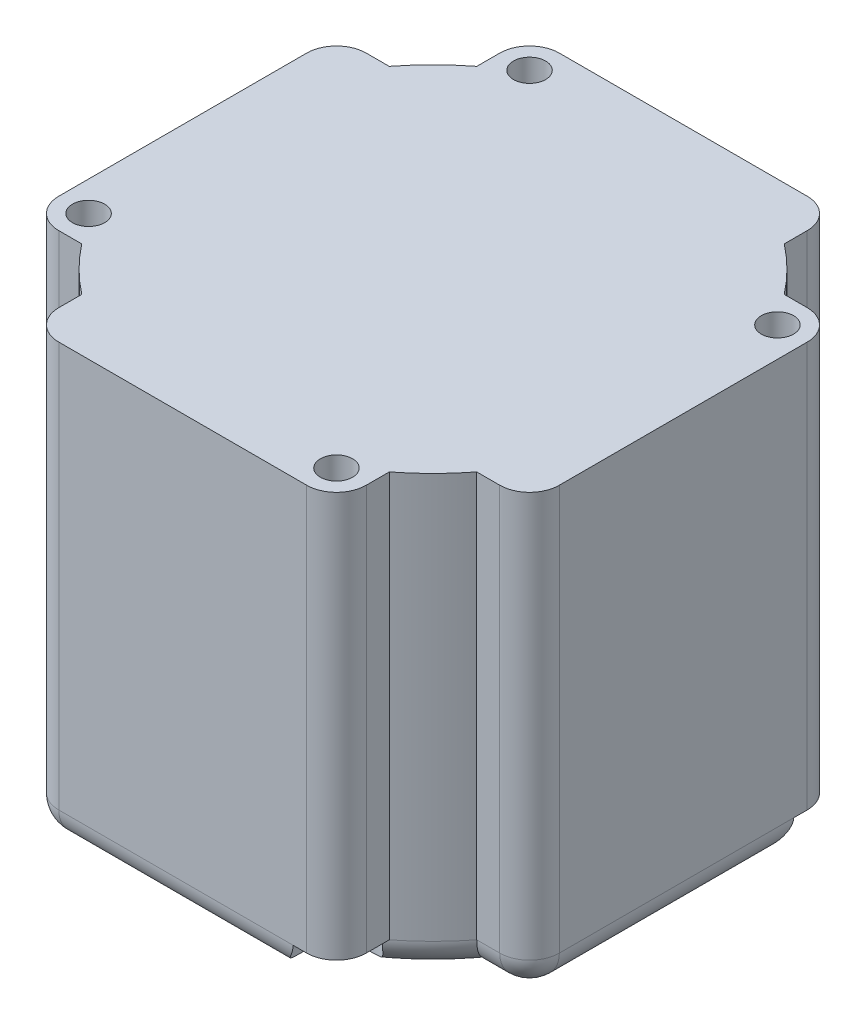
ISO-10303-21;
HEADER;
FILE_DESCRIPTION(('STEP AP214'),'2;1');
FILE_NAME('part.step','',(''),(''),'','','');
FILE_SCHEMA(('AUTOMOTIVE_DESIGN { 1 0 10303 214 1 1 1 1 }'));
ENDSEC;
DATA;
#1=APPLICATION_CONTEXT('core data for automotive mechanical design processes');
#2=APPLICATION_PROTOCOL_DEFINITION('international standard','automotive_design',2000,#1);
#3=PRODUCT_CONTEXT('',#1,'mechanical');
#4=PRODUCT('Part','Part','',(#3));
#5=PRODUCT_RELATED_PRODUCT_CATEGORY('part','',(#4));
#6=PRODUCT_DEFINITION_FORMATION('','',#4);
#7=PRODUCT_DEFINITION_CONTEXT('part definition',#1,'design');
#8=PRODUCT_DEFINITION('design','',#6,#7);
#9=PRODUCT_DEFINITION_SHAPE('','',#8);
#10=(LENGTH_UNIT() NAMED_UNIT(*) SI_UNIT(.MILLI.,.METRE.));
#11=(NAMED_UNIT(*) PLANE_ANGLE_UNIT() SI_UNIT($,.RADIAN.));
#12=(NAMED_UNIT(*) SI_UNIT($,.STERADIAN.) SOLID_ANGLE_UNIT());
#13=UNCERTAINTY_MEASURE_WITH_UNIT(LENGTH_MEASURE(1.E-05),#10,'distance_accuracy_value','');
#14=(GEOMETRIC_REPRESENTATION_CONTEXT(3) GLOBAL_UNCERTAINTY_ASSIGNED_CONTEXT((#13)) GLOBAL_UNIT_ASSIGNED_CONTEXT((#10,
#11,#12)) REPRESENTATION_CONTEXT('',''));
#15=CARTESIAN_POINT('',(0.,0.,0.));
#16=DIRECTION('',(0.,0.,1.));
#17=DIRECTION('',(1.,0.,0.));
#18=AXIS2_PLACEMENT_3D('',#15,#16,#17);
#19=CARTESIAN_POINT('',(-21.,5.09999999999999,-11.8835569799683));
#20=DIRECTION('',(1.,0.,0.));
#21=DIRECTION('',(0.,0.,-1.));
#22=AXIS2_PLACEMENT_3D('',#19,#20,#21);
#23=PLANE('',#22);
#24=CARTESIAN_POINT('',(-21.,5.09999999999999,4.4));
#25=DIRECTION('',(-1.,0.,0.));
#26=DIRECTION('',(0.,0.,1.));
#27=AXIS2_PLACEMENT_3D('',#24,#25,#26);
#28=CIRCLE('',#27,1.);
#29=CARTESIAN_POINT('',(-21.,5.09999999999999,5.4));
#30=VERTEX_POINT('',#29);
#31=EDGE_CURVE('P0_E11',#30,#30,#28,.F.);
#32=ORIENTED_EDGE('',*,*,#31,.F.);
#33=EDGE_LOOP('',(#32));
#34=FACE_BOUND('',#33,.T.);
#35=ADVANCED_FACE('P0_F16',(#34),#23,.F.);
#36=CARTESIAN_POINT('',(-21.,5.09999999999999,4.4));
#37=DIRECTION('',(-1.,0.,0.));
#38=DIRECTION('',(0.,0.,1.));
#39=AXIS2_PLACEMENT_3D('',#36,#37,#38);
#40=CYLINDRICAL_SURFACE('',#39,1.);
#41=CARTESIAN_POINT('',(-11.,5.09999999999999,4.4));
#42=DIRECTION('',(-1.,0.,0.));
#43=DIRECTION('',(0.,0.,1.));
#44=AXIS2_PLACEMENT_3D('',#41,#42,#43);
#45=CIRCLE('',#44,1.);
#46=CARTESIAN_POINT('',(-11.,5.09999999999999,5.4));
#47=VERTEX_POINT('',#46);
#48=EDGE_CURVE('P0_E22',#47,#47,#45,.T.);
#49=ORIENTED_EDGE('',*,*,#48,.T.);
#50=EDGE_LOOP('',(#49));
#51=FACE_BOUND('',#50,.T.);
#52=ORIENTED_EDGE('',*,*,#31,.T.);
#53=EDGE_LOOP('',(#52));
#54=FACE_BOUND('',#53,.T.);
#55=ADVANCED_FACE('P0_F26',(#51,#54),#40,.T.);
#56=CARTESIAN_POINT('',(-11.,0.,0.));
#57=DIRECTION('',(-1.,0.,0.));
#58=DIRECTION('',(0.,0.,1.));
#59=AXIS2_PLACEMENT_3D('',#56,#57,#58);
#60=PLANE('',#59);
#61=ORIENTED_EDGE('',*,*,#48,.F.);
#62=EDGE_LOOP('',(#61));
#63=FACE_BOUND('',#62,.T.);
#64=ADVANCED_FACE('P0_F28',(#63),#60,.F.);
#65=CLOSED_SHELL('',(#35,#55,#64));
#66=MANIFOLD_SOLID_BREP('P0_B1',#65);
#67=CARTESIAN_POINT('',(-21.,-22.9672402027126,0.));
#68=DIRECTION('',(-1.,0.,0.));
#69=DIRECTION('',(0.,0.,1.));
#70=AXIS2_PLACEMENT_3D('',#67,#68,#69);
#71=PLANE('',#70);
#72=DIRECTION('',(0.,0.,-1.));
#73=VECTOR('',#72,1.);
#74=CARTESIAN_POINT('',(-21.,2.49999999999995,21.15169182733));
#75=LINE('',#74,#73);
#76=CARTESIAN_POINT('',(-21.,2.50000000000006,9.25435607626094));
#77=VERTEX_POINT('',#76);
#78=CARTESIAN_POINT('',(-21.,2.49999999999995,-10.4));
#79=VERTEX_POINT('',#78);
#80=EDGE_CURVE('P1_E63',#77,#79,#75,.T.);
#81=ORIENTED_EDGE('',*,*,#80,.F.);
#82=DIRECTION('',(0.,0.,-1.));
#83=VECTOR('',#82,1.);
#84=CARTESIAN_POINT('',(-21.,2.49999999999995,0.));
#85=LINE('',#84,#83);
#86=CARTESIAN_POINT('',(-21.,2.49999999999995,10.4));
#87=VERTEX_POINT('',#86);
#88=EDGE_CURVE('P1_E863',#87,#77,#85,.T.);
#89=ORIENTED_EDGE('',*,*,#88,.F.);
#90=DIRECTION('',(0.,-1.,0.));
#91=VECTOR('',#90,1.);
#92=CARTESIAN_POINT('',(-21.,36.60908644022,10.4));
#93=LINE('',#92,#91);
#94=CARTESIAN_POINT('',(-21.,36.5,10.4));
#95=VERTEX_POINT('',#94);
#96=EDGE_CURVE('P1_E946',#95,#87,#93,.T.);
#97=ORIENTED_EDGE('',*,*,#96,.F.);
#98=DIRECTION('',(0.,0.,1.));
#99=VECTOR('',#98,1.);
#100=CARTESIAN_POINT('',(-21.,36.5,0.));
#101=LINE('',#100,#99);
#102=CARTESIAN_POINT('',(-21.,36.5,-10.4));
#103=VERTEX_POINT('',#102);
#104=EDGE_CURVE('P1_E939',#103,#95,#101,.T.);
#105=ORIENTED_EDGE('',*,*,#104,.F.);
#106=DIRECTION('',(0.,-1.,0.));
#107=VECTOR('',#106,1.);
#108=CARTESIAN_POINT('',(-21.,36.60908644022,-10.4));
#109=LINE('',#108,#107);
#110=EDGE_CURVE('P1_E57',#79,#103,#109,.F.);
#111=ORIENTED_EDGE('',*,*,#110,.F.);
#112=EDGE_LOOP('',(#81,#89,#97,#105,#111));
#113=FACE_BOUND('',#112,.T.);
#114=ADVANCED_FACE('P1_F16',(#113),#71,.T.);
#115=CARTESIAN_POINT('',(-18.5,2.49999999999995,21.15169182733));
#116=DIRECTION('',(0.,0.,-1.));
#117=DIRECTION('',(-1.,0.,0.));
#118=AXIS2_PLACEMENT_3D('',#115,#116,#117);
#119=CYLINDRICAL_SURFACE('',#118,2.5);
#120=DIRECTION('',(0.,0.,-1.));
#121=VECTOR('',#120,1.);
#122=CARTESIAN_POINT('',(-18.5,0.,21.15169182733));
#123=LINE('',#122,#121);
#124=CARTESIAN_POINT('',(-18.4999999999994,0.,-10.4));
#125=VERTEX_POINT('',#124);
#126=CARTESIAN_POINT('',(-18.5,0.,7.65));
#127=VERTEX_POINT('',#126);
#128=EDGE_CURVE('P1_E69',#125,#127,#123,.F.);
#129=ORIENTED_EDGE('',*,*,#128,.T.);
#130=CARTESIAN_POINT('',(-18.5,0.,7.65));
#131=CARTESIAN_POINT('',(-18.5580569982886,-1.38300533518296E-05,7.64998581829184));
#132=CARTESIAN_POINT('',(-18.6161033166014,0.00202188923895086,7.65183804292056));
#133=CARTESIAN_POINT('',(-18.7316455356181,0.0100856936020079,7.65916653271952));
#134=CARTESIAN_POINT('',(-18.7891418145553,0.0161107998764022,7.66464009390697));
#135=CARTESIAN_POINT('',(-18.9026739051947,0.0319813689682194,7.67904327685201));
#136=CARTESIAN_POINT('',(-18.9587178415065,0.0417949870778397,7.6879440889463));
#137=CARTESIAN_POINT('',(-19.0694126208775,0.0650518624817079,7.70900605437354));
#138=CARTESIAN_POINT('',(-19.1240632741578,0.0784956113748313,7.72116764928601));
#139=CARTESIAN_POINT('',(-19.2850754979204,0.123861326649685,7.76212907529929));
#140=CARTESIAN_POINT('',(-19.3889145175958,0.160878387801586,7.79546095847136));
#141=CARTESIAN_POINT('',(-19.5878715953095,0.246484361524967,7.87206235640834));
#142=CARTESIAN_POINT('',(-19.6829694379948,0.295099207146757,7.91535413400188));
#143=CARTESIAN_POINT('',(-19.8994140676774,0.423191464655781,8.02842009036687));
#144=CARTESIAN_POINT('',(-20.0161279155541,0.507248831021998,8.10187406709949));
#145=CARTESIAN_POINT('',(-20.2301691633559,0.689915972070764,8.25835618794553));
#146=CARTESIAN_POINT('',(-20.3274638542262,0.788549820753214,8.34140011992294));
#147=CARTESIAN_POINT('',(-20.460185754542,0.946762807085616,8.47020811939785));
#148=CARTESIAN_POINT('',(-20.5026333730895,1.00191024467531,8.51438732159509));
#149=CARTESIAN_POINT('',(-20.5826548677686,1.11530984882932,8.60316512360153));
#150=CARTESIAN_POINT('',(-20.6202299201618,1.17356126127,8.6477636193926));
#151=CARTESIAN_POINT('',(-20.6905815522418,1.29327777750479,8.73655131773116));
#152=CARTESIAN_POINT('',(-20.7233542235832,1.35474544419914,8.7807401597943));
#153=CARTESIAN_POINT('',(-20.7840191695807,1.48109534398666,8.86750079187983));
#154=CARTESIAN_POINT('',(-20.8119141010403,1.54597569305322,8.91007345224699));
#155=CARTESIAN_POINT('',(-20.86432929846,1.68406098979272,8.99462750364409));
#156=CARTESIAN_POINT('',(-20.8885110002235,1.75753289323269,9.03638940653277));
#157=CARTESIAN_POINT('',(-20.9304799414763,1.90930297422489,9.11270008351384));
#158=CARTESIAN_POINT('',(-20.9483130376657,1.98756154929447,9.14729979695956));
#159=CARTESIAN_POINT('',(-20.9744266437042,2.13675301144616,9.19981351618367));
#160=CARTESIAN_POINT('',(-20.9837861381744,2.20682133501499,9.21952181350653));
#161=CARTESIAN_POINT('',(-20.9933903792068,2.31468871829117,9.24001550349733));
#162=CARTESIAN_POINT('',(-20.995854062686,2.35143605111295,9.24534070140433));
#163=CARTESIAN_POINT('',(-20.9991651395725,2.42544238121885,9.2525335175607));
#164=CARTESIAN_POINT('',(-21.0000078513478,2.46270254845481,9.25439112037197));
#165=CARTESIAN_POINT('',(-21.,2.50000000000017,9.25435607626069));
#166=B_SPLINE_CURVE_WITH_KNOTS('',3,(#130,#131,#132,#133,#134,#135,#136,#137,#138,#139,#140,
#141,#142,#143,#144,#145,#146,#147,#148,#149,#150,#151,#152,#153,#154,#155,#156,#157,#158,#159,
#160,#161,#162,#163,#164,#165),.UNSPECIFIED.,.F.,.F.,(4,2,2,2,2,2,2,2,2,2,2,2,2,2,2,2,2,4),(0.,
0.174088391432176,0.348046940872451,0.520574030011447,0.693124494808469,1.0369667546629,
1.38158518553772,1.86347416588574,2.34616810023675,2.59329609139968,2.84036431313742,
3.08763250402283,3.3347655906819,3.59801011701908,3.85931265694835,4.07832033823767,
4.18977251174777,4.30154609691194),.UNSPECIFIED.);
#167=EDGE_CURVE('P1_E388',#127,#77,#166,.T.);
#168=ORIENTED_EDGE('',*,*,#167,.T.);
#169=ORIENTED_EDGE('',*,*,#80,.T.);
#170=CARTESIAN_POINT('',(-18.5,2.49999999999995,-10.4));
#171=DIRECTION('',(0.,0.,-1.));
#172=DIRECTION('',(-1.,0.,0.));
#173=AXIS2_PLACEMENT_3D('',#170,#171,#172);
#174=CIRCLE('',#173,2.5);
#175=EDGE_CURVE('P1_E943',#79,#125,#174,.F.);
#176=ORIENTED_EDGE('',*,*,#175,.T.);
#177=EDGE_LOOP('',(#129,#168,#169,#176));
#178=FACE_BOUND('',#177,.T.);
#179=ADVANCED_FACE('P1_F678',(#178),#119,.T.);
#180=CARTESIAN_POINT('',(0.,0.,0.));
#181=DIRECTION('',(0.,1.,0.));
#182=DIRECTION('',(0.,0.,1.));
#183=AXIS2_PLACEMENT_3D('',#180,#181,#182);
#184=PLANE('',#183);
#185=CARTESIAN_POINT('',(0.,0.,0.));
#186=DIRECTION('',(0.,1.,0.));
#187=DIRECTION('',(-0.862006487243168,0.,0.506897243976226));
#188=AXIS2_PLACEMENT_3D('',#185,#186,#187);
#189=CIRCLE('',#188,18.5000000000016);
#190=CARTESIAN_POINT('',(-15.9471200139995,0.,9.37759901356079));
#191=VERTEX_POINT('',#190);
#192=CARTESIAN_POINT('',(-10.4000000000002,0.,15.3000000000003));
#193=VERTEX_POINT('',#192);
#194=EDGE_CURVE('P1_E393',#191,#193,#189,.T.);
#195=ORIENTED_EDGE('',*,*,#194,.F.);
#196=CARTESIAN_POINT('',(-18.5,0.,10.4));
#197=DIRECTION('',(0.,-1.,0.));
#198=DIRECTION('',(0.,0.,-1.));
#199=AXIS2_PLACEMENT_3D('',#196,#197,#198);
#200=CIRCLE('',#199,2.75);
#201=EDGE_CURVE('P1_E389',#191,#127,#200,.F.);
#202=ORIENTED_EDGE('',*,*,#201,.T.);
#203=ORIENTED_EDGE('',*,*,#128,.F.);
#204=DIRECTION('',(1.,0.,0.));
#205=VECTOR('',#204,1.);
#206=CARTESIAN_POINT('',(-21.15698744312,0.,-10.4));
#207=LINE('',#206,#205);
#208=CARTESIAN_POINT('',(-15.3000000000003,0.,-10.4000000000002));
#209=VERTEX_POINT('',#208);
#210=EDGE_CURVE('P1_E392',#209,#125,#207,.F.);
#211=ORIENTED_EDGE('',*,*,#210,.F.);
#212=CARTESIAN_POINT('',(0.,0.,0.));
#213=DIRECTION('',(0.,1.,0.));
#214=DIRECTION('',(-0.506897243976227,0.,-0.862006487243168));
#215=AXIS2_PLACEMENT_3D('',#212,#213,#214);
#216=CIRCLE('',#215,18.5000000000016);
#217=CARTESIAN_POINT('',(-9.37759901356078,0.,-15.9471200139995));
#218=VERTEX_POINT('',#217);
#219=EDGE_CURVE('P1_E398',#218,#209,#216,.T.);
#220=ORIENTED_EDGE('',*,*,#219,.F.);
#221=CARTESIAN_POINT('',(-10.4,0.,-18.5));
#222=DIRECTION('',(0.,-1.,0.));
#223=DIRECTION('',(0.,0.,-1.));
#224=AXIS2_PLACEMENT_3D('',#221,#222,#223);
#225=CIRCLE('',#224,2.75);
#226=CARTESIAN_POINT('',(-7.65,0.,-18.5));
#227=VERTEX_POINT('',#226);
#228=EDGE_CURVE('P1_E401',#218,#227,#225,.F.);
#229=ORIENTED_EDGE('',*,*,#228,.T.);
#230=DIRECTION('',(1.,0.,0.));
#231=VECTOR('',#230,1.);
#232=CARTESIAN_POINT('',(-21.15698744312,0.,-18.5));
#233=LINE('',#232,#231);
#234=CARTESIAN_POINT('',(10.4,0.,-18.4999999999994));
#235=VERTEX_POINT('',#234);
#236=EDGE_CURVE('P1_E403',#235,#227,#233,.F.);
#237=ORIENTED_EDGE('',*,*,#236,.F.);
#238=DIRECTION('',(0.,0.,1.));
#239=VECTOR('',#238,1.);
#240=CARTESIAN_POINT('',(10.4,0.,-21.17211226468));
#241=LINE('',#240,#239);
#242=CARTESIAN_POINT('',(10.4000000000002,0.,-15.3000000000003));
#243=VERTEX_POINT('',#242);
#244=EDGE_CURVE('P1_E408',#243,#235,#241,.F.);
#245=ORIENTED_EDGE('',*,*,#244,.F.);
#246=CARTESIAN_POINT('',(0.,0.,0.));
#247=DIRECTION('',(0.,1.,0.));
#248=DIRECTION('',(0.862006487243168,0.,-0.506897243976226));
#249=AXIS2_PLACEMENT_3D('',#246,#247,#248);
#250=CIRCLE('',#249,18.5000000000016);
#251=CARTESIAN_POINT('',(15.9471200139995,0.,-9.37759901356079));
#252=VERTEX_POINT('',#251);
#253=EDGE_CURVE('P1_E411',#252,#243,#250,.T.);
#254=ORIENTED_EDGE('',*,*,#253,.F.);
#255=CARTESIAN_POINT('',(18.5,0.,-10.4));
#256=DIRECTION('',(0.,-1.,0.));
#257=DIRECTION('',(0.,0.,-1.));
#258=AXIS2_PLACEMENT_3D('',#255,#256,#257);
#259=CIRCLE('',#258,2.75);
#260=CARTESIAN_POINT('',(18.5,0.,-7.65));
#261=VERTEX_POINT('',#260);
#262=EDGE_CURVE('P1_E414',#252,#261,#259,.F.);
#263=ORIENTED_EDGE('',*,*,#262,.T.);
#264=DIRECTION('',(0.,0.,1.));
#265=VECTOR('',#264,1.);
#266=CARTESIAN_POINT('',(18.5,0.,-21.17211226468));
#267=LINE('',#266,#265);
#268=CARTESIAN_POINT('',(18.4999999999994,0.,10.4));
#269=VERTEX_POINT('',#268);
#270=EDGE_CURVE('P1_E416',#269,#261,#267,.F.);
#271=ORIENTED_EDGE('',*,*,#270,.F.);
#272=DIRECTION('',(-1.,0.,0.));
#273=VECTOR('',#272,1.);
#274=CARTESIAN_POINT('',(21.14220533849,0.,10.4));
#275=LINE('',#274,#273);
#276=CARTESIAN_POINT('',(15.3000000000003,0.,10.4000000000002));
#277=VERTEX_POINT('',#276);
#278=EDGE_CURVE('P1_E275',#277,#269,#275,.F.);
#279=ORIENTED_EDGE('',*,*,#278,.F.);
#280=CARTESIAN_POINT('',(0.,0.,0.));
#281=DIRECTION('',(0.,1.,0.));
#282=DIRECTION('',(0.506897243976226,0.,0.862006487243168));
#283=AXIS2_PLACEMENT_3D('',#280,#281,#282);
#284=CIRCLE('',#283,18.5000000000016);
#285=CARTESIAN_POINT('',(9.37759901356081,0.,15.9471200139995));
#286=VERTEX_POINT('',#285);
#287=EDGE_CURVE('P1_E325',#286,#277,#284,.T.);
#288=ORIENTED_EDGE('',*,*,#287,.F.);
#289=CARTESIAN_POINT('',(10.4,0.,18.5));
#290=DIRECTION('',(0.,-1.,0.));
#291=DIRECTION('',(0.,0.,-1.));
#292=AXIS2_PLACEMENT_3D('',#289,#290,#291);
#293=CIRCLE('',#292,2.75);
#294=CARTESIAN_POINT('',(7.65000000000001,0.,18.5));
#295=VERTEX_POINT('',#294);
#296=EDGE_CURVE('P1_E424',#286,#295,#293,.F.);
#297=ORIENTED_EDGE('',*,*,#296,.T.);
#298=DIRECTION('',(-1.,0.,0.));
#299=VECTOR('',#298,1.);
#300=CARTESIAN_POINT('',(21.14220533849,0.,18.5));
#301=LINE('',#300,#299);
#302=CARTESIAN_POINT('',(-10.4,0.,18.4999999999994));
#303=VERTEX_POINT('',#302);
#304=EDGE_CURVE('P1_E426',#303,#295,#301,.F.);
#305=ORIENTED_EDGE('',*,*,#304,.F.);
#306=DIRECTION('',(0.,0.,-1.));
#307=VECTOR('',#306,1.);
#308=CARTESIAN_POINT('',(-10.4,0.,21.15169182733));
#309=LINE('',#308,#307);
#310=EDGE_CURVE('P1_E431',#193,#303,#309,.F.);
#311=ORIENTED_EDGE('',*,*,#310,.F.);
#312=EDGE_LOOP('',(#195,#202,#203,#211,#220,#229,#237,#245,#254,#263,#271,#279,#288,#297,#305,#311));
#313=FACE_BOUND('',#312,.T.);
#314=ADVANCED_FACE('P1_F660',(#313),#184,.F.);
#315=CARTESIAN_POINT('',(-18.5,0.,10.4));
#316=DIRECTION('',(0.,-1.,0.));
#317=DIRECTION('',(0.,0.,-1.));
#318=AXIS2_PLACEMENT_3D('',#315,#316,#317);
#319=CYLINDRICAL_SURFACE('',#318,2.75);
#320=ORIENTED_EDGE('',*,*,#167,.F.);
#321=ORIENTED_EDGE('',*,*,#201,.F.);
#322=CARTESIAN_POINT('',(-16.8181572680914,2.49999999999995,12.5757538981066));
#323=CARTESIAN_POINT('',(-16.8181739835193,2.43040725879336,12.5757424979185));
#324=CARTESIAN_POINT('',(-16.8158582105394,2.36081739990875,12.5739761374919));
#325=CARTESIAN_POINT('',(-16.8066853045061,2.22212251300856,12.566851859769));
#326=CARTESIAN_POINT('',(-16.7998281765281,2.15301748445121,12.5614939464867));
#327=CARTESIAN_POINT('',(-16.7816829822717,2.01567129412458,12.5470944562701));
#328=CARTESIAN_POINT('',(-16.770388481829,1.94743153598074,12.5380475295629));
#329=CARTESIAN_POINT('',(-16.7436277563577,1.81242101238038,12.5161171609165));
#330=CARTESIAN_POINT('',(-16.72816159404,1.74565022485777,12.5032337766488));
#331=CARTESIAN_POINT('',(-16.6759368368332,1.54812389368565,12.4585039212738));
#332=CARTESIAN_POINT('',(-16.6333545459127,1.42017295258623,12.4205795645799));
#333=CARTESIAN_POINT('',(-16.5364423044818,1.17596029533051,12.3265135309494));
#334=CARTESIAN_POINT('',(-16.4821217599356,1.05968932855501,12.2703864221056));
#335=CARTESIAN_POINT('',(-16.3969175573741,0.898923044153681,12.172379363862));
#336=CARTESIAN_POINT('',(-16.368428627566,0.84838629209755,12.1381255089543));
#337=CARTESIAN_POINT('',(-16.3107151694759,0.751371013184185,12.064844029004));
#338=CARTESIAN_POINT('',(-16.2814910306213,0.704890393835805,12.0258188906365));
#339=CARTESIAN_POINT('',(-16.2231229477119,0.616409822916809,11.9430144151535));
#340=CARTESIAN_POINT('',(-16.1939789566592,0.574406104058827,11.8992391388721));
#341=CARTESIAN_POINT('',(-16.1365953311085,0.49515098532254,11.8070408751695));
#342=CARTESIAN_POINT('',(-16.1083555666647,0.457898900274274,11.7586185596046));
#343=CARTESIAN_POINT('',(-16.056912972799,0.39251166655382,11.6634834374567));
#344=CARTESIAN_POINT('',(-16.0335118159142,0.363818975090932,11.6172596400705));
#345=CARTESIAN_POINT('',(-15.9886216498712,0.310297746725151,11.5217240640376));
#346=CARTESIAN_POINT('',(-15.9671332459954,0.285470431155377,11.472411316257));
#347=CARTESIAN_POINT('',(-15.9265939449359,0.239640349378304,11.3711096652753));
#348=CARTESIAN_POINT('',(-15.9075420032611,0.218635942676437,11.3191219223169));
#349=CARTESIAN_POINT('',(-15.872288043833,0.180265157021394,11.2128785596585));
#350=CARTESIAN_POINT('',(-15.8560871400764,0.16290019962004,11.1586220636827));
#351=CARTESIAN_POINT('',(-15.8135859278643,0.11727050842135,10.9979465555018));
#352=CARTESIAN_POINT('',(-15.7915430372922,0.0935009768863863,10.8890661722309));
#353=CARTESIAN_POINT('',(-15.7607855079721,0.0559173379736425,10.667819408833));
#354=CARTESIAN_POINT('',(-15.7520800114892,0.0421100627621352,10.5554506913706));
#355=CARTESIAN_POINT('',(-15.7483606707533,0.0202535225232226,10.3156097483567));
#356=CARTESIAN_POINT('',(-15.7552178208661,0.0131534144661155,10.1880248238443));
#357=CARTESIAN_POINT('',(-15.7866124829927,0.00403029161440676,9.93493487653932));
#358=CARTESIAN_POINT('',(-15.8111422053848,0.00200504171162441,9.80942896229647));
#359=CARTESIAN_POINT('',(-15.858319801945,0.000564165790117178,9.63384989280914));
#360=CARTESIAN_POINT('',(-15.8739706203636,0.000317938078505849,9.58181719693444));
#361=CARTESIAN_POINT('',(-15.908293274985,3.85630694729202E-05,9.47886398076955));
#362=CARTESIAN_POINT('',(-15.9269594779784,5.02305262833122E-06,9.42794158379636));
#363=CARTESIAN_POINT('',(-15.9471200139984,0.,9.37759901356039));
#364=B_SPLINE_CURVE_WITH_KNOTS('',3,(#322,#323,#324,#325,#326,#327,#328,#329,#330,#331,#332,
#333,#334,#335,#336,#337,#338,#339,#340,#341,#342,#343,#344,#345,#346,#347,#348,#349,#350,#351,
#352,#353,#354,#355,#356,#357,#358,#359,#360,#361,#362,#363),.UNSPECIFIED.,.F.,.F.,(4,2,2,2,2,2,
2,2,2,2,2,2,2,2,2,2,2,2,2,2,4),(0.,0.208712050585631,0.417423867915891,0.626439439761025,
0.835451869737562,1.25353252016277,1.67127939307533,1.87314926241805,2.0749143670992,
2.27650832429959,2.47807317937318,2.65551402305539,2.8330108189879,3.01043126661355,
3.18792088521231,3.52721778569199,3.86674715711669,4.24922043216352,4.63152522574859,
4.79445572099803,4.95708528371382),.UNSPECIFIED.);
#365=CARTESIAN_POINT('',(-16.8181572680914,2.49999999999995,12.5757538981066));
#366=VERTEX_POINT('',#365);
#367=EDGE_CURVE('P1_E433',#366,#191,#364,.T.);
#368=ORIENTED_EDGE('',*,*,#367,.F.);
#369=CARTESIAN_POINT('',(-18.5,2.49999999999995,10.4));
#370=DIRECTION('',(0.,-1.,0.));
#371=DIRECTION('',(0.,0.,-1.));
#372=AXIS2_PLACEMENT_3D('',#369,#370,#371);
#373=CIRCLE('',#372,2.75);
#374=EDGE_CURVE('P1_E438',#77,#366,#373,.T.);
#375=ORIENTED_EDGE('',*,*,#374,.F.);
#376=EDGE_LOOP('',(#320,#321,#368,#375));
#377=FACE_BOUND('',#376,.T.);
#378=ADVANCED_FACE('P1_F449',(#377),#319,.F.);
#379=CARTESIAN_POINT('',(0.,36.5,0.));
#380=DIRECTION('',(0.,1.,0.));
#381=DIRECTION('',(0.,0.,1.));
#382=AXIS2_PLACEMENT_3D('',#379,#380,#381);
#383=PLANE('',#382);
#384=CARTESIAN_POINT('',(-18.5,36.5,10.4));
#385=DIRECTION('',(0.,-1.,0.));
#386=DIRECTION('',(0.,0.,-1.));
#387=AXIS2_PLACEMENT_3D('',#384,#385,#386);
#388=CIRCLE('',#387,1.35);
#389=CARTESIAN_POINT('',(-18.5,36.5,9.04999999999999));
#390=VERTEX_POINT('',#389);
#391=EDGE_CURVE('P1_E447',#390,#390,#388,.T.);
#392=ORIENTED_EDGE('',*,*,#391,.T.);
#393=EDGE_LOOP('',(#392));
#394=FACE_BOUND('',#393,.T.);
#395=CARTESIAN_POINT('',(10.4,36.5,18.5));
#396=DIRECTION('',(0.,-1.,0.));
#397=DIRECTION('',(0.,0.,-1.));
#398=AXIS2_PLACEMENT_3D('',#395,#396,#397);
#399=CIRCLE('',#398,1.35);
#400=CARTESIAN_POINT('',(10.4,36.5,17.15));
#401=VERTEX_POINT('',#400);
#402=EDGE_CURVE('P1_E923',#401,#401,#399,.T.);
#403=ORIENTED_EDGE('',*,*,#402,.T.);
#404=EDGE_LOOP('',(#403));
#405=FACE_BOUND('',#404,.T.);
#406=CARTESIAN_POINT('',(18.5,36.5,-10.4));
#407=DIRECTION('',(0.,-1.,0.));
#408=DIRECTION('',(0.,0.,-1.));
#409=AXIS2_PLACEMENT_3D('',#406,#407,#408);
#410=CIRCLE('',#409,1.35);
#411=CARTESIAN_POINT('',(18.5,36.5,-11.75));
#412=VERTEX_POINT('',#411);
#413=EDGE_CURVE('P1_E921',#412,#412,#410,.T.);
#414=ORIENTED_EDGE('',*,*,#413,.T.);
#415=EDGE_LOOP('',(#414));
#416=FACE_BOUND('',#415,.T.);
#417=CARTESIAN_POINT('',(-10.4,36.5,-18.5));
#418=DIRECTION('',(0.,-1.,0.));
#419=DIRECTION('',(0.,0.,-1.));
#420=AXIS2_PLACEMENT_3D('',#417,#418,#419);
#421=CIRCLE('',#420,1.35);
#422=CARTESIAN_POINT('',(-10.4,36.5,-19.85));
#423=VERTEX_POINT('',#422);
#424=EDGE_CURVE('P1_E918',#423,#423,#421,.T.);
#425=ORIENTED_EDGE('',*,*,#424,.T.);
#426=EDGE_LOOP('',(#425));
#427=FACE_BOUND('',#426,.T.);
#428=DIRECTION('',(1.,0.,0.));
#429=VECTOR('',#428,1.);
#430=CARTESIAN_POINT('',(0.,36.5,-21.));
#431=LINE('',#430,#429);
#432=CARTESIAN_POINT('',(10.4,36.5,-21.));
#433=VERTEX_POINT('',#432);
#434=CARTESIAN_POINT('',(-10.4,36.5,-21.));
#435=VERTEX_POINT('',#434);
#436=EDGE_CURVE('P1_E916',#433,#435,#431,.F.);
#437=ORIENTED_EDGE('',*,*,#436,.T.);
#438=CARTESIAN_POINT('',(-10.4,36.5,-18.5));
#439=DIRECTION('',(0.,-1.,0.));
#440=DIRECTION('',(0.,0.,-1.));
#441=AXIS2_PLACEMENT_3D('',#438,#439,#440);
#442=CIRCLE('',#441,2.5);
#443=CARTESIAN_POINT('',(-12.9,36.5,-18.5));
#444=VERTEX_POINT('',#443);
#445=EDGE_CURVE('P1_E914',#435,#444,#442,.F.);
#446=ORIENTED_EDGE('',*,*,#445,.T.);
#447=DIRECTION('',(0.,0.,1.));
#448=VECTOR('',#447,1.);
#449=CARTESIAN_POINT('',(-12.9,36.5,0.));
#450=LINE('',#449,#448);
#451=CARTESIAN_POINT('',(-12.8999999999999,36.5,-16.5707573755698));
#452=VERTEX_POINT('',#451);
#453=EDGE_CURVE('P1_E912',#444,#452,#450,.T.);
#454=ORIENTED_EDGE('',*,*,#453,.T.);
#455=CARTESIAN_POINT('',(0.,36.5,0.));
#456=DIRECTION('',(0.,1.,0.));
#457=DIRECTION('',(0.,0.,1.));
#458=AXIS2_PLACEMENT_3D('',#455,#456,#457);
#459=CIRCLE('',#458,21.);
#460=CARTESIAN_POINT('',(-16.5707573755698,36.5,-12.9));
#461=VERTEX_POINT('',#460);
#462=EDGE_CURVE('P1_E910',#452,#461,#459,.T.);
#463=ORIENTED_EDGE('',*,*,#462,.T.);
#464=DIRECTION('',(1.,0.,0.));
#465=VECTOR('',#464,1.);
#466=CARTESIAN_POINT('',(0.,36.5,-12.9));
#467=LINE('',#466,#465);
#468=CARTESIAN_POINT('',(-18.5,36.5,-12.9));
#469=VERTEX_POINT('',#468);
#470=EDGE_CURVE('P1_E908',#461,#469,#467,.F.);
#471=ORIENTED_EDGE('',*,*,#470,.T.);
#472=CARTESIAN_POINT('',(-18.5,36.5,-10.4));
#473=DIRECTION('',(0.,-1.,0.));
#474=DIRECTION('',(0.,0.,-1.));
#475=AXIS2_PLACEMENT_3D('',#472,#473,#474);
#476=CIRCLE('',#475,2.5);
#477=EDGE_CURVE('P1_E19',#469,#103,#476,.F.);
#478=ORIENTED_EDGE('',*,*,#477,.T.);
#479=ORIENTED_EDGE('',*,*,#104,.T.);
#480=CARTESIAN_POINT('',(-18.5,36.5,10.4));
#481=DIRECTION('',(0.,-1.,0.));
#482=DIRECTION('',(0.,0.,-1.));
#483=AXIS2_PLACEMENT_3D('',#480,#481,#482);
#484=CIRCLE('',#483,2.5);
#485=CARTESIAN_POINT('',(-18.5,36.5,12.9));
#486=VERTEX_POINT('',#485);
#487=EDGE_CURVE('P1_E907',#95,#486,#484,.F.);
#488=ORIENTED_EDGE('',*,*,#487,.T.);
#489=DIRECTION('',(1.,0.,0.));
#490=VECTOR('',#489,1.);
#491=CARTESIAN_POINT('',(0.,36.5,12.9));
#492=LINE('',#491,#490);
#493=CARTESIAN_POINT('',(-16.5707573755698,36.5,12.8999999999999));
#494=VERTEX_POINT('',#493);
#495=EDGE_CURVE('P1_E905',#486,#494,#492,.T.);
#496=ORIENTED_EDGE('',*,*,#495,.T.);
#497=CARTESIAN_POINT('',(0.,36.5,0.));
#498=DIRECTION('',(0.,1.,0.));
#499=DIRECTION('',(0.,0.,1.));
#500=AXIS2_PLACEMENT_3D('',#497,#498,#499);
#501=CIRCLE('',#500,21.);
#502=CARTESIAN_POINT('',(-12.9,36.5,16.5707573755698));
#503=VERTEX_POINT('',#502);
#504=EDGE_CURVE('P1_E903',#494,#503,#501,.T.);
#505=ORIENTED_EDGE('',*,*,#504,.T.);
#506=DIRECTION('',(0.,0.,1.));
#507=VECTOR('',#506,1.);
#508=CARTESIAN_POINT('',(-12.9,36.5,0.));
#509=LINE('',#508,#507);
#510=CARTESIAN_POINT('',(-12.9,36.5,18.5));
#511=VERTEX_POINT('',#510);
#512=EDGE_CURVE('P1_E901',#503,#511,#509,.T.);
#513=ORIENTED_EDGE('',*,*,#512,.T.);
#514=CARTESIAN_POINT('',(-10.4,36.5,18.5));
#515=DIRECTION('',(0.,-1.,0.));
#516=DIRECTION('',(0.,0.,-1.));
#517=AXIS2_PLACEMENT_3D('',#514,#515,#516);
#518=CIRCLE('',#517,2.5);
#519=CARTESIAN_POINT('',(-10.4,36.5,21.));
#520=VERTEX_POINT('',#519);
#521=EDGE_CURVE('P1_E899',#511,#520,#518,.F.);
#522=ORIENTED_EDGE('',*,*,#521,.T.);
#523=DIRECTION('',(1.,0.,0.));
#524=VECTOR('',#523,1.);
#525=CARTESIAN_POINT('',(0.,36.5,21.));
#526=LINE('',#525,#524);
#527=CARTESIAN_POINT('',(10.4,36.5,21.));
#528=VERTEX_POINT('',#527);
#529=EDGE_CURVE('P1_E897',#520,#528,#526,.T.);
#530=ORIENTED_EDGE('',*,*,#529,.T.);
#531=CARTESIAN_POINT('',(10.4,36.5,18.5));
#532=DIRECTION('',(0.,-1.,0.));
#533=DIRECTION('',(0.,0.,-1.));
#534=AXIS2_PLACEMENT_3D('',#531,#532,#533);
#535=CIRCLE('',#534,2.5);
#536=CARTESIAN_POINT('',(12.9,36.5,18.5));
#537=VERTEX_POINT('',#536);
#538=EDGE_CURVE('P1_E895',#528,#537,#535,.F.);
#539=ORIENTED_EDGE('',*,*,#538,.T.);
#540=DIRECTION('',(0.,0.,1.));
#541=VECTOR('',#540,1.);
#542=CARTESIAN_POINT('',(12.9,36.5,0.));
#543=LINE('',#542,#541);
#544=CARTESIAN_POINT('',(12.8999999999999,36.5,16.5707573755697));
#545=VERTEX_POINT('',#544);
#546=EDGE_CURVE('P1_E893',#537,#545,#543,.F.);
#547=ORIENTED_EDGE('',*,*,#546,.T.);
#548=CARTESIAN_POINT('',(0.,36.5,0.));
#549=DIRECTION('',(0.,1.,0.));
#550=DIRECTION('',(0.,0.,1.));
#551=AXIS2_PLACEMENT_3D('',#548,#549,#550);
#552=CIRCLE('',#551,21.);
#553=CARTESIAN_POINT('',(16.5707573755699,36.5,12.9));
#554=VERTEX_POINT('',#553);
#555=EDGE_CURVE('P1_E891',#545,#554,#552,.T.);
#556=ORIENTED_EDGE('',*,*,#555,.T.);
#557=DIRECTION('',(1.,0.,0.));
#558=VECTOR('',#557,1.);
#559=CARTESIAN_POINT('',(0.,36.5,12.9));
#560=LINE('',#559,#558);
#561=CARTESIAN_POINT('',(18.5,36.5,12.9));
#562=VERTEX_POINT('',#561);
#563=EDGE_CURVE('P1_E889',#554,#562,#560,.T.);
#564=ORIENTED_EDGE('',*,*,#563,.T.);
#565=CARTESIAN_POINT('',(18.5,36.5,10.4));
#566=DIRECTION('',(0.,-1.,0.));
#567=DIRECTION('',(0.,0.,-1.));
#568=AXIS2_PLACEMENT_3D('',#565,#566,#567);
#569=CIRCLE('',#568,2.5);
#570=CARTESIAN_POINT('',(21.,36.5,10.4));
#571=VERTEX_POINT('',#570);
#572=EDGE_CURVE('P1_E887',#562,#571,#569,.F.);
#573=ORIENTED_EDGE('',*,*,#572,.T.);
#574=DIRECTION('',(0.,0.,1.));
#575=VECTOR('',#574,1.);
#576=CARTESIAN_POINT('',(21.,36.5,0.));
#577=LINE('',#576,#575);
#578=CARTESIAN_POINT('',(21.,36.5,-10.4));
#579=VERTEX_POINT('',#578);
#580=EDGE_CURVE('P1_E885',#571,#579,#577,.F.);
#581=ORIENTED_EDGE('',*,*,#580,.T.);
#582=CARTESIAN_POINT('',(18.5,36.5,-10.4));
#583=DIRECTION('',(0.,-1.,0.));
#584=DIRECTION('',(0.,0.,-1.));
#585=AXIS2_PLACEMENT_3D('',#582,#583,#584);
#586=CIRCLE('',#585,2.5);
#587=CARTESIAN_POINT('',(18.5,36.5,-12.9));
#588=VERTEX_POINT('',#587);
#589=EDGE_CURVE('P1_E883',#579,#588,#586,.F.);
#590=ORIENTED_EDGE('',*,*,#589,.T.);
#591=DIRECTION('',(1.,0.,0.));
#592=VECTOR('',#591,1.);
#593=CARTESIAN_POINT('',(0.,36.5,-12.9));
#594=LINE('',#593,#592);
#595=CARTESIAN_POINT('',(16.5707573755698,36.5,-12.8999999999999));
#596=VERTEX_POINT('',#595);
#597=EDGE_CURVE('P1_E881',#588,#596,#594,.F.);
#598=ORIENTED_EDGE('',*,*,#597,.T.);
#599=CARTESIAN_POINT('',(0.,36.5,0.));
#600=DIRECTION('',(0.,1.,0.));
#601=DIRECTION('',(0.,0.,1.));
#602=AXIS2_PLACEMENT_3D('',#599,#600,#601);
#603=CIRCLE('',#602,21.);
#604=CARTESIAN_POINT('',(12.9,36.5,-16.5707573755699));
#605=VERTEX_POINT('',#604);
#606=EDGE_CURVE('P1_E879',#596,#605,#603,.T.);
#607=ORIENTED_EDGE('',*,*,#606,.T.);
#608=DIRECTION('',(0.,0.,1.));
#609=VECTOR('',#608,1.);
#610=CARTESIAN_POINT('',(12.9,36.5,0.));
#611=LINE('',#610,#609);
#612=CARTESIAN_POINT('',(12.9,36.5,-18.5));
#613=VERTEX_POINT('',#612);
#614=EDGE_CURVE('P1_E877',#605,#613,#611,.F.);
#615=ORIENTED_EDGE('',*,*,#614,.T.);
#616=CARTESIAN_POINT('',(10.4,36.5,-18.5));
#617=DIRECTION('',(0.,-1.,0.));
#618=DIRECTION('',(0.,0.,-1.));
#619=AXIS2_PLACEMENT_3D('',#616,#617,#618);
#620=CIRCLE('',#619,2.5);
#621=EDGE_CURVE('P1_E874',#613,#433,#620,.F.);
#622=ORIENTED_EDGE('',*,*,#621,.T.);
#623=EDGE_LOOP('',(#437,#446,#454,#463,#471,#478,#479,#488,#496,#505,#513,#522,#530,#539,#547,
#556,#564,#573,#581,#590,#598,#607,#615,#622));
#624=FACE_BOUND('',#623,.T.);
#625=ADVANCED_FACE('P1_F991',(#394,#405,#416,#427,#624),#383,.T.);
#626=CARTESIAN_POINT('',(-18.5,36.60908644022,-10.4));
#627=DIRECTION('',(0.,-1.,0.));
#628=DIRECTION('',(0.,0.,-1.));
#629=AXIS2_PLACEMENT_3D('',#626,#627,#628);
#630=CYLINDRICAL_SURFACE('',#629,2.5);
#631=ORIENTED_EDGE('',*,*,#110,.T.);
#632=ORIENTED_EDGE('',*,*,#477,.F.);
#633=DIRECTION('',(0.,-1.,0.));
#634=VECTOR('',#633,1.);
#635=CARTESIAN_POINT('',(-18.5,36.60908644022,-12.9));
#636=LINE('',#635,#634);
#637=CARTESIAN_POINT('',(-18.5,2.49999999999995,-12.9));
#638=VERTEX_POINT('',#637);
#639=EDGE_CURVE('P1_E871',#469,#638,#636,.T.);
#640=ORIENTED_EDGE('',*,*,#639,.T.);
#641=CARTESIAN_POINT('',(-18.5,2.49999999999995,-10.4));
#642=DIRECTION('',(0.,-1.,0.));
#643=DIRECTION('',(0.,0.,-1.));
#644=AXIS2_PLACEMENT_3D('',#641,#642,#643);
#645=CIRCLE('',#644,2.5);
#646=EDGE_CURVE('P1_E873',#638,#79,#645,.F.);
#647=ORIENTED_EDGE('',*,*,#646,.T.);
#648=EDGE_LOOP('',(#631,#632,#640,#647));
#649=FACE_BOUND('',#648,.T.);
#650=ADVANCED_FACE('P1_F1006',(#649),#630,.T.);
#651=CARTESIAN_POINT('',(-18.5,36.60908644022,10.4));
#652=DIRECTION('',(0.,-1.,0.));
#653=DIRECTION('',(0.,0.,-1.));
#654=AXIS2_PLACEMENT_3D('',#651,#652,#653);
#655=CYLINDRICAL_SURFACE('',#654,2.5);
#656=ORIENTED_EDGE('',*,*,#96,.T.);
#657=CARTESIAN_POINT('',(-18.5,2.49999999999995,10.4));
#658=DIRECTION('',(0.,-1.,0.));
#659=DIRECTION('',(0.,0.,-1.));
#660=AXIS2_PLACEMENT_3D('',#657,#658,#659);
#661=CIRCLE('',#660,2.5);
#662=CARTESIAN_POINT('',(-18.5,2.49999999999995,12.9));
#663=VERTEX_POINT('',#662);
#664=EDGE_CURVE('P1_E870',#87,#663,#661,.F.);
#665=ORIENTED_EDGE('',*,*,#664,.T.);
#666=DIRECTION('',(0.,1.,0.));
#667=VECTOR('',#666,1.);
#668=CARTESIAN_POINT('',(-18.5,0.,12.9));
#669=LINE('',#668,#667);
#670=EDGE_CURVE('P1_E867',#486,#663,#669,.F.);
#671=ORIENTED_EDGE('',*,*,#670,.F.);
#672=ORIENTED_EDGE('',*,*,#487,.F.);
#673=EDGE_LOOP('',(#656,#665,#671,#672));
#674=FACE_BOUND('',#673,.T.);
#675=ADVANCED_FACE('P1_F1008',(#674),#655,.T.);
#676=CARTESIAN_POINT('',(0.,2.49999999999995,0.));
#677=DIRECTION('',(0.,-1.,0.));
#678=DIRECTION('',(0.,0.,-1.));
#679=AXIS2_PLACEMENT_3D('',#676,#677,#678);
#680=PLANE('',#679);
#681=CARTESIAN_POINT('',(-18.5,2.49999999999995,10.4));
#682=DIRECTION('',(0.,-1.,0.));
#683=DIRECTION('',(0.,0.,-1.));
#684=AXIS2_PLACEMENT_3D('',#681,#682,#683);
#685=CIRCLE('',#684,1.35);
#686=CARTESIAN_POINT('',(-18.5,2.49999999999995,9.04999999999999));
#687=VERTEX_POINT('',#686);
#688=EDGE_CURVE('P1_E864',#687,#687,#685,.F.);
#689=ORIENTED_EDGE('',*,*,#688,.T.);
#690=EDGE_LOOP('',(#689));
#691=FACE_BOUND('',#690,.T.);
#692=ORIENTED_EDGE('',*,*,#664,.F.);
#693=ORIENTED_EDGE('',*,*,#88,.T.);
#694=ORIENTED_EDGE('',*,*,#374,.T.);
#695=CARTESIAN_POINT('',(0.,2.49999999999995,0.));
#696=DIRECTION('',(0.,1.,0.));
#697=DIRECTION('',(0.,0.,1.));
#698=AXIS2_PLACEMENT_3D('',#695,#696,#697);
#699=CIRCLE('',#698,21.);
#700=CARTESIAN_POINT('',(-16.5707573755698,2.49999999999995,12.8999999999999));
#701=VERTEX_POINT('',#700);
#702=EDGE_CURVE('P1_E861',#366,#701,#699,.T.);
#703=ORIENTED_EDGE('',*,*,#702,.T.);
#704=DIRECTION('',(1.,0.,0.));
#705=VECTOR('',#704,1.);
#706=CARTESIAN_POINT('',(-21.,2.49999999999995,12.9));
#707=LINE('',#706,#705);
#708=EDGE_CURVE('P1_E858',#663,#701,#707,.T.);
#709=ORIENTED_EDGE('',*,*,#708,.F.);
#710=EDGE_LOOP('',(#692,#693,#694,#703,#709));
#711=FACE_BOUND('',#710,.T.);
#712=ADVANCED_FACE('P1_F1014',(#691,#711),#680,.T.);
#713=CARTESIAN_POINT('',(-18.5,2.49999999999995,-10.4));
#714=DIRECTION('',(0.,-0.707106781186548,-0.707106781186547));
#715=DIRECTION('',(-1.,0.,0.));
#716=AXIS2_PLACEMENT_3D('',#713,#714,#715);
#717=SPHERICAL_SURFACE('',#716,2.5);
#718=ORIENTED_EDGE('',*,*,#175,.F.);
#719=ORIENTED_EDGE('',*,*,#646,.F.);
#720=CARTESIAN_POINT('',(-18.5,2.49999999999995,-10.4));
#721=DIRECTION('',(1.,0.,0.));
#722=DIRECTION('',(0.,0.,-1.));
#723=AXIS2_PLACEMENT_3D('',#720,#721,#722);
#724=CIRCLE('',#723,2.5);
#725=CARTESIAN_POINT('',(-18.5,0.732233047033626,-12.1677669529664));
#726=VERTEX_POINT('',#725);
#727=EDGE_CURVE('P1_E856',#638,#726,#724,.F.);
#728=ORIENTED_EDGE('',*,*,#727,.T.);
#729=CARTESIAN_POINT('',(-18.5,2.49999999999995,-10.4));
#730=DIRECTION('',(-1.,-4.29045687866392E-13,4.29045687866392E-13));
#731=DIRECTION('',(0.,-0.707106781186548,-0.707106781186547));
#732=AXIS2_PLACEMENT_3D('',#729,#730,#731);
#733=CIRCLE('',#732,2.5);
#734=EDGE_CURVE('P1_E853',#726,#125,#733,.T.);
#735=ORIENTED_EDGE('',*,*,#734,.T.);
#736=EDGE_LOOP('',(#718,#719,#728,#735));
#737=FACE_BOUND('',#736,.T.);
#738=ADVANCED_FACE('P1_F963',(#737),#717,.T.);
#739=CARTESIAN_POINT('',(-18.5,0.,10.4));
#740=DIRECTION('',(0.,-1.,0.));
#741=DIRECTION('',(0.,0.,-1.));
#742=AXIS2_PLACEMENT_3D('',#739,#740,#741);
#743=CYLINDRICAL_SURFACE('',#742,1.35);
#744=ORIENTED_EDGE('',*,*,#391,.F.);
#745=EDGE_LOOP('',(#744));
#746=FACE_BOUND('',#745,.T.);
#747=ORIENTED_EDGE('',*,*,#688,.F.);
#748=EDGE_LOOP('',(#747));
#749=FACE_BOUND('',#748,.T.);
#750=ADVANCED_FACE('P1_F460',(#746,#749),#743,.F.);
#751=CARTESIAN_POINT('',(0.,2.49999999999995,0.));
#752=DIRECTION('',(0.,1.,0.));
#753=DIRECTION('',(0.713286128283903,0.,-0.700872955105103));
#754=AXIS2_PLACEMENT_3D('',#751,#752,#753);
#755=TOROIDAL_SURFACE('',#754,18.5,2.5);
#756=ORIENTED_EDGE('',*,*,#702,.F.);
#757=ORIENTED_EDGE('',*,*,#367,.T.);
#758=ORIENTED_EDGE('',*,*,#194,.T.);
#759=CARTESIAN_POINT('',(-10.4,0.,15.3));
#760=CARTESIAN_POINT('',(-10.4563532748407,-1.44853347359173E-06,15.3298379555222));
#761=CARTESIAN_POINT('',(-10.5127322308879,0.00190560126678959,15.3596298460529));
#762=CARTESIAN_POINT('',(-10.623092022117,0.00939249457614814,15.4177916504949));
#763=CARTESIAN_POINT('',(-10.6770783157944,0.0148219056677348,15.4461706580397));
#764=CARTESIAN_POINT('',(-10.7824891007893,0.0289111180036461,15.5014053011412));
#765=CARTESIAN_POINT('',(-10.8339257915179,0.0374253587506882,15.5282747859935));
#766=CARTESIAN_POINT('',(-10.9341011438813,0.057248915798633,15.5804356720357));
#767=CARTESIAN_POINT('',(-10.9828585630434,0.0684180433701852,15.605744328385));
#768=CARTESIAN_POINT('',(-11.0775689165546,0.09312971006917,15.6547632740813));
#769=CARTESIAN_POINT('',(-11.1235468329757,0.106537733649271,15.6784931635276));
#770=CARTESIAN_POINT('',(-11.212617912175,0.135324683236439,15.7243732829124));
#771=CARTESIAN_POINT('',(-11.2557420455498,0.150574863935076,15.7465439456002));
#772=CARTESIAN_POINT('',(-11.324447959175,0.177033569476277,15.7818296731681));
#773=CARTESIAN_POINT('',(-11.3502599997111,0.187473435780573,15.7950776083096));
#774=CARTESIAN_POINT('',(-11.4013139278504,0.209125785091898,15.8212505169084));
#775=CARTESIAN_POINT('',(-11.4265589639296,0.220328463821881,15.8341774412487));
#776=CARTESIAN_POINT('',(-11.4764603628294,0.243473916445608,15.8597010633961));
#777=CARTESIAN_POINT('',(-11.501120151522,0.255407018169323,15.872299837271));
#778=CARTESIAN_POINT('',(-11.5498361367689,0.279980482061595,15.8971587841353));
#779=CARTESIAN_POINT('',(-11.5738960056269,0.292611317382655,15.9094211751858));
#780=CARTESIAN_POINT('',(-11.6213975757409,0.318547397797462,15.9336008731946));
#781=CARTESIAN_POINT('',(-11.6448432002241,0.331843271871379,15.9455205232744));
#782=CARTESIAN_POINT('',(-11.691102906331,0.359076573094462,15.9690093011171));
#783=CARTESIAN_POINT('',(-11.7139211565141,0.373004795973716,15.9805808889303));
#784=CARTESIAN_POINT('',(-11.7589137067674,0.401470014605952,16.0033693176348));
#785=CARTESIAN_POINT('',(-11.7810924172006,0.41599798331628,16.0145887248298));
#786=CARTESIAN_POINT('',(-11.8247945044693,0.44563004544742,16.0366696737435));
#787=CARTESIAN_POINT('',(-11.8463225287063,0.46072529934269,16.0475338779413));
#788=CARTESIAN_POINT('',(-11.8887128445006,0.491459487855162,16.0689024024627));
#789=CARTESIAN_POINT('',(-11.9095800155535,0.507089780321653,16.0794094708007));
#790=CARTESIAN_POINT('',(-11.9506392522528,0.538861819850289,16.1000626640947));
#791=CARTESIAN_POINT('',(-11.9708364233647,0.554995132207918,16.1102116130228));
#792=CARTESIAN_POINT('',(-12.0105471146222,0.587741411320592,16.1301487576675));
#793=CARTESIAN_POINT('',(-12.0300659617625,0.604346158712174,16.13993983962));
#794=CARTESIAN_POINT('',(-12.0684129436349,0.638003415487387,16.1591614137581));
#795=CARTESIAN_POINT('',(-12.0872466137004,0.655047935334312,16.1685948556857));
#796=CARTESIAN_POINT('',(-12.1271552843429,0.692299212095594,16.1885779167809));
#797=CARTESIAN_POINT('',(-12.1481569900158,0.71260485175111,16.1990898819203));
#798=CARTESIAN_POINT('',(-12.1893770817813,0.753897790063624,16.2197157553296));
#799=CARTESIAN_POINT('',(-12.2095996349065,0.774879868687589,16.2298317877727));
#800=CARTESIAN_POINT('',(-12.2492452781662,0.817494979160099,16.2496551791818));
#801=CARTESIAN_POINT('',(-12.2686726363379,0.839123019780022,16.2593647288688));
#802=CARTESIAN_POINT('',(-12.3067116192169,0.882998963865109,16.2783662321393));
#803=CARTESIAN_POINT('',(-12.3253276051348,0.905242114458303,16.2876604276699));
#804=CARTESIAN_POINT('',(-12.3617287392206,0.950316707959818,16.3058228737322));
#805=CARTESIAN_POINT('',(-12.3795183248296,0.973143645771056,16.3146934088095));
#806=CARTESIAN_POINT('',(-12.4142523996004,1.01935385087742,16.3320010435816));
#807=CARTESIAN_POINT('',(-12.4312013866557,1.04273286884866,16.3404404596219));
#808=CARTESIAN_POINT('',(-12.4642409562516,1.09001491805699,16.3568791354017));
#809=CARTESIAN_POINT('',(-12.4803360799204,1.11391396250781,16.3648807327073));
#810=CARTESIAN_POINT('',(-12.5116555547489,1.16220344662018,16.3804378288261));
#811=CARTESIAN_POINT('',(-12.5268844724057,1.18659016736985,16.3879956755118));
#812=CARTESIAN_POINT('',(-12.5564601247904,1.23582213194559,16.4026600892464));
#813=CARTESIAN_POINT('',(-12.570811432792,1.26066392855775,16.4097690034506));
#814=CARTESIAN_POINT('',(-12.5986214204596,1.31077296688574,16.4235311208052));
#815=CARTESIAN_POINT('',(-12.6120846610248,1.33603703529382,16.4301866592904));
#816=CARTESIAN_POINT('',(-12.638109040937,1.38695738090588,16.4430383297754));
#817=CARTESIAN_POINT('',(-12.6506747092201,1.41261075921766,16.4492367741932));
#818=CARTESIAN_POINT('',(-12.6748954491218,1.46427637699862,16.4611712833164));
#819=CARTESIAN_POINT('',(-12.6865549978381,1.49028599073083,16.4669096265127));
#820=CARTESIAN_POINT('',(-12.7089559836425,1.54263066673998,16.4779216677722));
#821=CARTESIAN_POINT('',(-12.7197018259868,1.5689633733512,16.4831975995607));
#822=CARTESIAN_POINT('',(-12.7402688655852,1.62192080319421,16.4932832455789));
#823=CARTESIAN_POINT('',(-12.7500943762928,1.64854343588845,16.4980951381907));
#824=CARTESIAN_POINT('',(-12.7688151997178,1.70204731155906,16.5072518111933));
#825=CARTESIAN_POINT('',(-12.7777147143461,1.72892672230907,16.5115987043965));
#826=CARTESIAN_POINT('',(-12.7945789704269,1.7829108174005,16.5198251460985));
#827=CARTESIAN_POINT('',(-12.8025477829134,1.8100139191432,16.5237067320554));
#828=CARTESIAN_POINT('',(-12.817547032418,1.8644121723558,16.5310029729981));
#829=CARTESIAN_POINT('',(-12.8245813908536,1.89170598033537,16.5344195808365));
#830=CARTESIAN_POINT('',(-12.837709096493,1.94645257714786,16.5407869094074));
#831=CARTESIAN_POINT('',(-12.8438061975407,1.97390424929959,16.5437394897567));
#832=CARTESIAN_POINT('',(-12.8550577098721,2.02893370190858,16.5491804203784));
#833=CARTESIAN_POINT('',(-12.8602156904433,2.05651057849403,16.5516705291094));
#834=CARTESIAN_POINT('',(-12.8695882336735,2.1117578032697,16.5561887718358));
#835=CARTESIAN_POINT('',(-12.8738061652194,2.13942744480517,16.5582185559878));
#836=CARTESIAN_POINT('',(-12.8812988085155,2.19482783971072,16.561818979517));
#837=CARTESIAN_POINT('',(-12.8845766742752,2.22255806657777,16.5633911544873));
#838=CARTESIAN_POINT('',(-12.8901903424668,2.27804757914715,16.5660797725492));
#839=CARTESIAN_POINT('',(-12.8925290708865,2.3058065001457,16.5671976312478));
#840=CARTESIAN_POINT('',(-12.8962663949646,2.3613217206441,16.5689815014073));
#841=CARTESIAN_POINT('',(-12.8976676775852,2.3890777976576,16.569648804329));
#842=CARTESIAN_POINT('',(-12.8995334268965,2.44455594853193,16.5705362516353));
#843=CARTESIAN_POINT('',(-12.9000003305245,2.47227792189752,16.5707575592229));
#844=CARTESIAN_POINT('',(-12.8999999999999,2.49999999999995,16.5707573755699));
#845=B_SPLINE_CURVE_WITH_KNOTS('',3,(#759,#760,#761,#762,#763,#764,#765,#766,#767,#768,#769,
#770,#771,#772,#773,#774,#775,#776,#777,#778,#779,#780,#781,#782,#783,#784,#785,#786,#787,#788,
#789,#790,#791,#792,#793,#794,#795,#796,#797,#798,#799,#800,#801,#802,#803,#804,#805,#806,#807,
#808,#809,#810,#811,#812,#813,#814,#815,#816,#817,#818,#819,#820,#821,#822,#823,#824,#825,#826,
#827,#828,#829,#830,#831,#832,#833,#834,#835,#836,#837,#838,#839,#840,#841,#842,#843,#844),
.UNSPECIFIED.,.F.,.F.,(4,2,2,2,2,2,2,2,2,2,2,2,2,2,2,2,2,2,2,2,2,2,2,2,2,2,2,2,2,2,2,2,2,2,2,2,
2,2,2,2,2,2,4),(0.,0.191268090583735,0.374861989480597,0.550729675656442,0.718823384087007,
0.879100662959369,1.03152540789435,1.12401550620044,1.21548431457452,1.3059307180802,
1.39535405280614,1.48375413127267,1.57113126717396,1.65748629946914,1.74282061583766,
1.82713617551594,1.91043553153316,1.99272185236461,2.0739989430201,2.16711926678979,
2.25964108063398,2.35157420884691,2.44292925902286,2.53371762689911,2.62395149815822,
2.71364384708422,2.80280843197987,2.89145978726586,2.97961321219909,3.06728475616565,
3.15449120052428,3.24125003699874,3.32757944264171,3.41349825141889,3.49902592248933,
3.58418250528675,3.66898860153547,3.75346532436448,3.83763425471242,3.9215173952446,
4.00513712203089,4.08851613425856,4.17167740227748),.UNSPECIFIED.);
#846=CARTESIAN_POINT('',(-12.9,2.49999999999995,16.5707573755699));
#847=VERTEX_POINT('',#846);
#848=EDGE_CURVE('P1_E347',#847,#193,#845,.F.);
#849=ORIENTED_EDGE('',*,*,#848,.F.);
#850=CARTESIAN_POINT('',(0.,2.49999999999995,0.));
#851=DIRECTION('',(0.,1.,0.));
#852=DIRECTION('',(0.,0.,1.));
#853=AXIS2_PLACEMENT_3D('',#850,#851,#852);
#854=CIRCLE('',#853,21.);
#855=EDGE_CURVE('P1_E849',#701,#847,#854,.T.);
#856=ORIENTED_EDGE('',*,*,#855,.F.);
#857=EDGE_LOOP('',(#756,#757,#758,#849,#856));
#858=FACE_BOUND('',#857,.T.);
#859=ADVANCED_FACE('P1_F453',(#858),#755,.T.);
#860=CARTESIAN_POINT('',(-21.,0.,12.9));
#861=DIRECTION('',(0.,0.,1.));
#862=DIRECTION('',(1.,0.,0.));
#863=AXIS2_PLACEMENT_3D('',#860,#861,#862);
#864=PLANE('',#863);
#865=ORIENTED_EDGE('',*,*,#670,.T.);
#866=ORIENTED_EDGE('',*,*,#708,.T.);
#867=DIRECTION('',(0.,1.,0.));
#868=VECTOR('',#867,1.);
#869=CARTESIAN_POINT('',(-16.5707573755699,0.,12.8999999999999));
#870=LINE('',#869,#868);
#871=EDGE_CURVE('P1_E846',#494,#701,#870,.F.);
#872=ORIENTED_EDGE('',*,*,#871,.F.);
#873=ORIENTED_EDGE('',*,*,#495,.F.);
#874=EDGE_LOOP('',(#865,#866,#872,#873));
#875=FACE_BOUND('',#874,.T.);
#876=ADVANCED_FACE('P1_F459',(#875),#864,.T.);
#877=CARTESIAN_POINT('',(-16.5707573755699,0.,-12.9));
#878=DIRECTION('',(0.,0.,-1.));
#879=DIRECTION('',(-1.,0.,0.));
#880=AXIS2_PLACEMENT_3D('',#877,#878,#879);
#881=PLANE('',#880);
#882=DIRECTION('',(0.,1.,0.));
#883=VECTOR('',#882,1.);
#884=CARTESIAN_POINT('',(-16.5707573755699,0.,-12.9));
#885=LINE('',#884,#883);
#886=CARTESIAN_POINT('',(-16.5707573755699,2.49999999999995,-12.9));
#887=VERTEX_POINT('',#886);
#888=EDGE_CURVE('P1_E842',#461,#887,#885,.F.);
#889=ORIENTED_EDGE('',*,*,#888,.T.);
#890=DIRECTION('',(-1.,0.,0.));
#891=VECTOR('',#890,1.);
#892=CARTESIAN_POINT('',(-16.5707573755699,2.49999999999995,-12.9));
#893=LINE('',#892,#891);
#894=EDGE_CURVE('P1_E837',#887,#638,#893,.T.);
#895=ORIENTED_EDGE('',*,*,#894,.T.);
#896=ORIENTED_EDGE('',*,*,#639,.F.);
#897=ORIENTED_EDGE('',*,*,#470,.F.);
#898=EDGE_LOOP('',(#889,#895,#896,#897));
#899=FACE_BOUND('',#898,.T.);
#900=ADVANCED_FACE('P1_F968',(#899),#881,.T.);
#901=CARTESIAN_POINT('',(10.4,0.,18.5));
#902=DIRECTION('',(0.,-1.,0.));
#903=DIRECTION('',(0.,0.,-1.));
#904=AXIS2_PLACEMENT_3D('',#901,#902,#903);
#905=CYLINDRICAL_SURFACE('',#904,1.35);
#906=ORIENTED_EDGE('',*,*,#402,.F.);
#907=EDGE_LOOP('',(#906));
#908=FACE_BOUND('',#907,.T.);
#909=CARTESIAN_POINT('',(10.4,2.49999999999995,18.5));
#910=DIRECTION('',(0.,-1.,0.));
#911=DIRECTION('',(0.,0.,-1.));
#912=AXIS2_PLACEMENT_3D('',#909,#910,#911);
#913=CIRCLE('',#912,1.35);
#914=CARTESIAN_POINT('',(10.4,2.49999999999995,17.15));
#915=VERTEX_POINT('',#914);
#916=EDGE_CURVE('P1_E834',#915,#915,#913,.F.);
#917=ORIENTED_EDGE('',*,*,#916,.F.);
#918=EDGE_LOOP('',(#917));
#919=FACE_BOUND('',#918,.T.);
#920=ADVANCED_FACE('P1_F1475',(#908,#919),#905,.F.);
#921=CARTESIAN_POINT('',(18.5,0.,-10.4));
#922=DIRECTION('',(0.,-1.,0.));
#923=DIRECTION('',(0.,0.,-1.));
#924=AXIS2_PLACEMENT_3D('',#921,#922,#923);
#925=CYLINDRICAL_SURFACE('',#924,1.35);
#926=ORIENTED_EDGE('',*,*,#413,.F.);
#927=EDGE_LOOP('',(#926));
#928=FACE_BOUND('',#927,.T.);
#929=CARTESIAN_POINT('',(18.5,2.49999999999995,-10.4));
#930=DIRECTION('',(0.,-1.,0.));
#931=DIRECTION('',(0.,0.,-1.));
#932=AXIS2_PLACEMENT_3D('',#929,#930,#931);
#933=CIRCLE('',#932,1.35);
#934=CARTESIAN_POINT('',(18.5,2.49999999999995,-11.75));
#935=VERTEX_POINT('',#934);
#936=EDGE_CURVE('P1_E831',#935,#935,#933,.F.);
#937=ORIENTED_EDGE('',*,*,#936,.F.);
#938=EDGE_LOOP('',(#937));
#939=FACE_BOUND('',#938,.T.);
#940=ADVANCED_FACE('P1_F1464',(#928,#939),#925,.F.);
#941=CARTESIAN_POINT('',(-10.4,0.,-18.5));
#942=DIRECTION('',(0.,-1.,0.));
#943=DIRECTION('',(0.,0.,-1.));
#944=AXIS2_PLACEMENT_3D('',#941,#942,#943);
#945=CYLINDRICAL_SURFACE('',#944,1.35);
#946=ORIENTED_EDGE('',*,*,#424,.F.);
#947=EDGE_LOOP('',(#946));
#948=FACE_BOUND('',#947,.T.);
#949=CARTESIAN_POINT('',(-10.4,2.49999999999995,-18.5));
#950=DIRECTION('',(0.,-1.,0.));
#951=DIRECTION('',(0.,0.,-1.));
#952=AXIS2_PLACEMENT_3D('',#949,#950,#951);
#953=CIRCLE('',#952,1.35);
#954=CARTESIAN_POINT('',(-10.4,2.49999999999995,-19.85));
#955=VERTEX_POINT('',#954);
#956=EDGE_CURVE('P1_E828',#955,#955,#953,.F.);
#957=ORIENTED_EDGE('',*,*,#956,.F.);
#958=EDGE_LOOP('',(#957));
#959=FACE_BOUND('',#958,.T.);
#960=ADVANCED_FACE('P1_F1454',(#948,#959),#945,.F.);
#961=CARTESIAN_POINT('',(12.9,0.,-21.));
#962=DIRECTION('',(0.,0.,-1.));
#963=DIRECTION('',(-1.,0.,0.));
#964=AXIS2_PLACEMENT_3D('',#961,#962,#963);
#965=PLANE('',#964);
#966=DIRECTION('',(0.,1.,0.));
#967=VECTOR('',#966,1.);
#968=CARTESIAN_POINT('',(10.4,0.,-21.));
#969=LINE('',#968,#967);
#970=CARTESIAN_POINT('',(10.4,2.49999999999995,-21.));
#971=VERTEX_POINT('',#970);
#972=EDGE_CURVE('P1_E826',#433,#971,#969,.F.);
#973=ORIENTED_EDGE('',*,*,#972,.T.);
#974=DIRECTION('',(-1.,0.,0.));
#975=VECTOR('',#974,1.);
#976=CARTESIAN_POINT('',(12.9,2.49999999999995,-21.));
#977=LINE('',#976,#975);
#978=CARTESIAN_POINT('',(-9.25435607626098,2.49999999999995,-21.));
#979=VERTEX_POINT('',#978);
#980=EDGE_CURVE('P1_E824',#971,#979,#977,.T.);
#981=ORIENTED_EDGE('',*,*,#980,.T.);
#982=DIRECTION('',(-1.,0.,0.));
#983=VECTOR('',#982,1.);
#984=CARTESIAN_POINT('',(12.9,2.49999999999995,-21.));
#985=LINE('',#984,#983);
#986=CARTESIAN_POINT('',(-10.4,2.49999999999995,-21.));
#987=VERTEX_POINT('',#986);
#988=EDGE_CURVE('P1_E822',#979,#987,#985,.T.);
#989=ORIENTED_EDGE('',*,*,#988,.T.);
#990=DIRECTION('',(0.,-1.,0.));
#991=VECTOR('',#990,1.);
#992=CARTESIAN_POINT('',(-10.4,36.60908644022,-21.));
#993=LINE('',#992,#991);
#994=EDGE_CURVE('P1_E819',#435,#987,#993,.T.);
#995=ORIENTED_EDGE('',*,*,#994,.F.);
#996=ORIENTED_EDGE('',*,*,#436,.F.);
#997=EDGE_LOOP('',(#973,#981,#989,#995,#996));
#998=FACE_BOUND('',#997,.T.);
#999=ADVANCED_FACE('P1_F995',(#998),#965,.T.);
#1000=CARTESIAN_POINT('',(-10.4,36.60908644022,-18.5));
#1001=DIRECTION('',(0.,-1.,0.));
#1002=DIRECTION('',(0.,0.,-1.));
#1003=AXIS2_PLACEMENT_3D('',#1000,#1001,#1002);
#1004=CYLINDRICAL_SURFACE('',#1003,2.5);
#1005=ORIENTED_EDGE('',*,*,#994,.T.);
#1006=CARTESIAN_POINT('',(-10.4,2.49999999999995,-18.5));
#1007=DIRECTION('',(0.,-1.,0.));
#1008=DIRECTION('',(0.,0.,-1.));
#1009=AXIS2_PLACEMENT_3D('',#1006,#1007,#1008);
#1010=CIRCLE('',#1009,2.5);
#1011=CARTESIAN_POINT('',(-12.9,2.49999999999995,-18.5));
#1012=VERTEX_POINT('',#1011);
#1013=EDGE_CURVE('P1_E817',#987,#1012,#1010,.F.);
#1014=ORIENTED_EDGE('',*,*,#1013,.T.);
#1015=DIRECTION('',(0.,-1.,0.));
#1016=VECTOR('',#1015,1.);
#1017=CARTESIAN_POINT('',(-12.9,36.60908644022,-18.5));
#1018=LINE('',#1017,#1016);
#1019=EDGE_CURVE('P1_E814',#1012,#444,#1018,.F.);
#1020=ORIENTED_EDGE('',*,*,#1019,.T.);
#1021=ORIENTED_EDGE('',*,*,#445,.F.);
#1022=EDGE_LOOP('',(#1005,#1014,#1020,#1021));
#1023=FACE_BOUND('',#1022,.T.);
#1024=ADVANCED_FACE('P1_F1000',(#1023),#1004,.T.);
#1025=CARTESIAN_POINT('',(-12.9,0.,-21.));
#1026=DIRECTION('',(-1.,0.,0.));
#1027=DIRECTION('',(0.,0.,1.));
#1028=AXIS2_PLACEMENT_3D('',#1025,#1026,#1027);
#1029=PLANE('',#1028);
#1030=ORIENTED_EDGE('',*,*,#1019,.F.);
#1031=DIRECTION('',(0.,0.,1.));
#1032=VECTOR('',#1031,1.);
#1033=CARTESIAN_POINT('',(-12.9,2.49999999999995,-21.));
#1034=LINE('',#1033,#1032);
#1035=CARTESIAN_POINT('',(-12.8999999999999,2.49999999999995,-16.5707573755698));
#1036=VERTEX_POINT('',#1035);
#1037=EDGE_CURVE('P1_E812',#1012,#1036,#1034,.T.);
#1038=ORIENTED_EDGE('',*,*,#1037,.T.);
#1039=DIRECTION('',(0.,1.,0.));
#1040=VECTOR('',#1039,1.);
#1041=CARTESIAN_POINT('',(-12.8999999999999,0.,-16.5707573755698));
#1042=LINE('',#1041,#1040);
#1043=EDGE_CURVE('P1_E809',#452,#1036,#1042,.F.);
#1044=ORIENTED_EDGE('',*,*,#1043,.F.);
#1045=ORIENTED_EDGE('',*,*,#453,.F.);
#1046=EDGE_LOOP('',(#1030,#1038,#1044,#1045));
#1047=FACE_BOUND('',#1046,.T.);
#1048=ADVANCED_FACE('P1_F1003',(#1047),#1029,.T.);
#1049=CARTESIAN_POINT('',(0.,0.,0.));
#1050=DIRECTION('',(0.,1.,0.));
#1051=DIRECTION('',(0.,0.,1.));
#1052=AXIS2_PLACEMENT_3D('',#1049,#1050,#1051);
#1053=CYLINDRICAL_SURFACE('',#1052,21.);
#1054=ORIENTED_EDGE('',*,*,#462,.F.);
#1055=ORIENTED_EDGE('',*,*,#1043,.T.);
#1056=CARTESIAN_POINT('',(0.,2.49999999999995,0.));
#1057=DIRECTION('',(0.,1.,0.));
#1058=DIRECTION('',(0.,0.,1.));
#1059=AXIS2_PLACEMENT_3D('',#1056,#1057,#1058);
#1060=CIRCLE('',#1059,21.);
#1061=EDGE_CURVE('P1_E804',#1036,#887,#1060,.T.);
#1062=ORIENTED_EDGE('',*,*,#1061,.T.);
#1063=ORIENTED_EDGE('',*,*,#888,.F.);
#1064=EDGE_LOOP('',(#1054,#1055,#1062,#1063));
#1065=FACE_BOUND('',#1064,.T.);
#1066=ADVANCED_FACE('P1_F973',(#1065),#1053,.T.);
#1067=CARTESIAN_POINT('',(0.,0.,0.));
#1068=DIRECTION('',(0.,1.,0.));
#1069=DIRECTION('',(0.,0.,1.));
#1070=AXIS2_PLACEMENT_3D('',#1067,#1068,#1069);
#1071=CYLINDRICAL_SURFACE('',#1070,21.);
#1072=ORIENTED_EDGE('',*,*,#504,.F.);
#1073=ORIENTED_EDGE('',*,*,#871,.T.);
#1074=ORIENTED_EDGE('',*,*,#855,.T.);
#1075=DIRECTION('',(0.,1.,0.));
#1076=VECTOR('',#1075,1.);
#1077=CARTESIAN_POINT('',(-12.9,0.,16.57075737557));
#1078=LINE('',#1077,#1076);
#1079=EDGE_CURVE('P1_E799',#503,#847,#1078,.F.);
#1080=ORIENTED_EDGE('',*,*,#1079,.F.);
#1081=EDGE_LOOP('',(#1072,#1073,#1074,#1080));
#1082=FACE_BOUND('',#1081,.T.);
#1083=ADVANCED_FACE('P1_F1037',(#1082),#1071,.T.);
#1084=CARTESIAN_POINT('',(-12.9,0.,16.57075737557));
#1085=DIRECTION('',(-1.,0.,0.));
#1086=DIRECTION('',(0.,0.,1.));
#1087=AXIS2_PLACEMENT_3D('',#1084,#1085,#1086);
#1088=PLANE('',#1087);
#1089=ORIENTED_EDGE('',*,*,#1079,.T.);
#1090=DIRECTION('',(0.,0.,1.));
#1091=VECTOR('',#1090,1.);
#1092=CARTESIAN_POINT('',(-12.9,2.49999999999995,16.57075737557));
#1093=LINE('',#1092,#1091);
#1094=CARTESIAN_POINT('',(-12.9,2.49999999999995,18.5));
#1095=VERTEX_POINT('',#1094);
#1096=EDGE_CURVE('P1_E795',#847,#1095,#1093,.T.);
#1097=ORIENTED_EDGE('',*,*,#1096,.T.);
#1098=DIRECTION('',(0.,-1.,0.));
#1099=VECTOR('',#1098,1.);
#1100=CARTESIAN_POINT('',(-12.9,36.60908644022,18.5));
#1101=LINE('',#1100,#1099);
#1102=EDGE_CURVE('P1_E792',#511,#1095,#1101,.T.);
#1103=ORIENTED_EDGE('',*,*,#1102,.F.);
#1104=ORIENTED_EDGE('',*,*,#512,.F.);
#1105=EDGE_LOOP('',(#1089,#1097,#1103,#1104));
#1106=FACE_BOUND('',#1105,.T.);
#1107=ADVANCED_FACE('P1_F1039',(#1106),#1088,.T.);
#1108=CARTESIAN_POINT('',(-10.4,36.60908644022,18.5));
#1109=DIRECTION('',(0.,-1.,0.));
#1110=DIRECTION('',(0.,0.,-1.));
#1111=AXIS2_PLACEMENT_3D('',#1108,#1109,#1110);
#1112=CYLINDRICAL_SURFACE('',#1111,2.5);
#1113=ORIENTED_EDGE('',*,*,#1102,.T.);
#1114=CARTESIAN_POINT('',(-10.4,2.49999999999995,18.5));
#1115=DIRECTION('',(0.,-1.,0.));
#1116=DIRECTION('',(0.,0.,-1.));
#1117=AXIS2_PLACEMENT_3D('',#1114,#1115,#1116);
#1118=CIRCLE('',#1117,2.5);
#1119=CARTESIAN_POINT('',(-10.4,2.49999999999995,21.));
#1120=VERTEX_POINT('',#1119);
#1121=EDGE_CURVE('P1_E790',#1095,#1120,#1118,.F.);
#1122=ORIENTED_EDGE('',*,*,#1121,.T.);
#1123=DIRECTION('',(0.,1.,0.));
#1124=VECTOR('',#1123,1.);
#1125=CARTESIAN_POINT('',(-10.4,0.,21.));
#1126=LINE('',#1125,#1124);
#1127=EDGE_CURVE('P1_E787',#520,#1120,#1126,.F.);
#1128=ORIENTED_EDGE('',*,*,#1127,.F.);
#1129=ORIENTED_EDGE('',*,*,#521,.F.);
#1130=EDGE_LOOP('',(#1113,#1122,#1128,#1129));
#1131=FACE_BOUND('',#1130,.T.);
#1132=ADVANCED_FACE('P1_F1047',(#1131),#1112,.T.);
#1133=CARTESIAN_POINT('',(-12.9,0.,21.));
#1134=DIRECTION('',(0.,0.,1.));
#1135=DIRECTION('',(1.,0.,0.));
#1136=AXIS2_PLACEMENT_3D('',#1133,#1134,#1135);
#1137=PLANE('',#1136);
#1138=ORIENTED_EDGE('',*,*,#1127,.T.);
#1139=DIRECTION('',(1.,0.,0.));
#1140=VECTOR('',#1139,1.);
#1141=CARTESIAN_POINT('',(-12.9,2.49999999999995,21.));
#1142=LINE('',#1141,#1140);
#1143=CARTESIAN_POINT('',(9.25435607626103,2.49999999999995,21.));
#1144=VERTEX_POINT('',#1143);
#1145=EDGE_CURVE('P1_E785',#1120,#1144,#1142,.T.);
#1146=ORIENTED_EDGE('',*,*,#1145,.T.);
#1147=DIRECTION('',(1.,0.,0.));
#1148=VECTOR('',#1147,1.);
#1149=CARTESIAN_POINT('',(-12.9,2.49999999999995,21.));
#1150=LINE('',#1149,#1148);
#1151=CARTESIAN_POINT('',(10.4,2.49999999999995,21.));
#1152=VERTEX_POINT('',#1151);
#1153=EDGE_CURVE('P1_E783',#1144,#1152,#1150,.T.);
#1154=ORIENTED_EDGE('',*,*,#1153,.T.);
#1155=DIRECTION('',(0.,-1.,0.));
#1156=VECTOR('',#1155,1.);
#1157=CARTESIAN_POINT('',(10.4,36.60908644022,21.));
#1158=LINE('',#1157,#1156);
#1159=EDGE_CURVE('P1_E780',#528,#1152,#1158,.T.);
#1160=ORIENTED_EDGE('',*,*,#1159,.F.);
#1161=ORIENTED_EDGE('',*,*,#529,.F.);
#1162=EDGE_LOOP('',(#1138,#1146,#1154,#1160,#1161));
#1163=FACE_BOUND('',#1162,.T.);
#1164=ADVANCED_FACE('P1_F1052',(#1163),#1137,.T.);
#1165=CARTESIAN_POINT('',(10.4,36.60908644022,18.5));
#1166=DIRECTION('',(0.,-1.,0.));
#1167=DIRECTION('',(0.,0.,-1.));
#1168=AXIS2_PLACEMENT_3D('',#1165,#1166,#1167);
#1169=CYLINDRICAL_SURFACE('',#1168,2.5);
#1170=ORIENTED_EDGE('',*,*,#1159,.T.);
#1171=CARTESIAN_POINT('',(10.4,2.49999999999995,18.5));
#1172=DIRECTION('',(0.,-1.,0.));
#1173=DIRECTION('',(0.,0.,-1.));
#1174=AXIS2_PLACEMENT_3D('',#1171,#1172,#1173);
#1175=CIRCLE('',#1174,2.5);
#1176=CARTESIAN_POINT('',(12.9,2.49999999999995,18.5));
#1177=VERTEX_POINT('',#1176);
#1178=EDGE_CURVE('P1_E778',#1152,#1177,#1175,.F.);
#1179=ORIENTED_EDGE('',*,*,#1178,.T.);
#1180=DIRECTION('',(0.,1.,0.));
#1181=VECTOR('',#1180,1.);
#1182=CARTESIAN_POINT('',(12.9,0.,18.5));
#1183=LINE('',#1182,#1181);
#1184=EDGE_CURVE('P1_E775',#537,#1177,#1183,.F.);
#1185=ORIENTED_EDGE('',*,*,#1184,.F.);
#1186=ORIENTED_EDGE('',*,*,#538,.F.);
#1187=EDGE_LOOP('',(#1170,#1179,#1185,#1186));
#1188=FACE_BOUND('',#1187,.T.);
#1189=ADVANCED_FACE('P1_F1370',(#1188),#1169,.T.);
#1190=CARTESIAN_POINT('',(12.9,0.,21.));
#1191=DIRECTION('',(1.,0.,0.));
#1192=DIRECTION('',(0.,0.,-1.));
#1193=AXIS2_PLACEMENT_3D('',#1190,#1191,#1192);
#1194=PLANE('',#1193);
#1195=ORIENTED_EDGE('',*,*,#1184,.T.);
#1196=DIRECTION('',(0.,0.,-1.));
#1197=VECTOR('',#1196,1.);
#1198=CARTESIAN_POINT('',(12.9,2.49999999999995,21.));
#1199=LINE('',#1198,#1197);
#1200=CARTESIAN_POINT('',(12.8999999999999,2.49999999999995,16.5707573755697));
#1201=VERTEX_POINT('',#1200);
#1202=EDGE_CURVE('P1_E773',#1177,#1201,#1199,.T.);
#1203=ORIENTED_EDGE('',*,*,#1202,.T.);
#1204=DIRECTION('',(0.,1.,0.));
#1205=VECTOR('',#1204,1.);
#1206=CARTESIAN_POINT('',(12.8999999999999,0.,16.5707573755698));
#1207=LINE('',#1206,#1205);
#1208=EDGE_CURVE('P1_E770',#545,#1201,#1207,.F.);
#1209=ORIENTED_EDGE('',*,*,#1208,.F.);
#1210=ORIENTED_EDGE('',*,*,#546,.F.);
#1211=EDGE_LOOP('',(#1195,#1203,#1209,#1210));
#1212=FACE_BOUND('',#1211,.T.);
#1213=ADVANCED_FACE('P1_F1360',(#1212),#1194,.T.);
#1214=CARTESIAN_POINT('',(0.,0.,0.));
#1215=DIRECTION('',(0.,1.,0.));
#1216=DIRECTION('',(0.,0.,1.));
#1217=AXIS2_PLACEMENT_3D('',#1214,#1215,#1216);
#1218=CYLINDRICAL_SURFACE('',#1217,21.);
#1219=ORIENTED_EDGE('',*,*,#555,.F.);
#1220=ORIENTED_EDGE('',*,*,#1208,.T.);
#1221=CARTESIAN_POINT('',(0.,2.49999999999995,0.));
#1222=DIRECTION('',(0.,1.,0.));
#1223=DIRECTION('',(0.,0.,1.));
#1224=AXIS2_PLACEMENT_3D('',#1221,#1222,#1223);
#1225=CIRCLE('',#1224,21.);
#1226=CARTESIAN_POINT('',(16.5707573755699,2.49999999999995,12.9));
#1227=VERTEX_POINT('',#1226);
#1228=EDGE_CURVE('P1_E766',#1201,#1227,#1225,.T.);
#1229=ORIENTED_EDGE('',*,*,#1228,.T.);
#1230=DIRECTION('',(0.,1.,0.));
#1231=VECTOR('',#1230,1.);
#1232=CARTESIAN_POINT('',(16.57075737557,0.,12.9));
#1233=LINE('',#1232,#1231);
#1234=EDGE_CURVE('P1_E761',#554,#1227,#1233,.F.);
#1235=ORIENTED_EDGE('',*,*,#1234,.F.);
#1236=EDGE_LOOP('',(#1219,#1220,#1229,#1235));
#1237=FACE_BOUND('',#1236,.T.);
#1238=ADVANCED_FACE('P1_F1075',(#1237),#1218,.T.);
#1239=CARTESIAN_POINT('',(16.57075737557,0.,12.9));
#1240=DIRECTION('',(0.,0.,1.));
#1241=DIRECTION('',(1.,0.,0.));
#1242=AXIS2_PLACEMENT_3D('',#1239,#1240,#1241);
#1243=PLANE('',#1242);
#1244=ORIENTED_EDGE('',*,*,#1234,.T.);
#1245=DIRECTION('',(1.,0.,0.));
#1246=VECTOR('',#1245,1.);
#1247=CARTESIAN_POINT('',(16.57075737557,2.49999999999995,12.9));
#1248=LINE('',#1247,#1246);
#1249=CARTESIAN_POINT('',(18.5,2.49999999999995,12.9));
#1250=VERTEX_POINT('',#1249);
#1251=EDGE_CURVE('P1_E585',#1227,#1250,#1248,.T.);
#1252=ORIENTED_EDGE('',*,*,#1251,.T.);
#1253=DIRECTION('',(0.,-1.,0.));
#1254=VECTOR('',#1253,1.);
#1255=CARTESIAN_POINT('',(18.5,36.60908644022,12.9));
#1256=LINE('',#1255,#1254);
#1257=EDGE_CURVE('P1_E755',#562,#1250,#1256,.T.);
#1258=ORIENTED_EDGE('',*,*,#1257,.F.);
#1259=ORIENTED_EDGE('',*,*,#563,.F.);
#1260=EDGE_LOOP('',(#1244,#1252,#1258,#1259));
#1261=FACE_BOUND('',#1260,.T.);
#1262=ADVANCED_FACE('P1_F1079',(#1261),#1243,.T.);
#1263=CARTESIAN_POINT('',(18.5,36.60908644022,10.4));
#1264=DIRECTION('',(0.,-1.,0.));
#1265=DIRECTION('',(0.,0.,-1.));
#1266=AXIS2_PLACEMENT_3D('',#1263,#1264,#1265);
#1267=CYLINDRICAL_SURFACE('',#1266,2.5);
#1268=ORIENTED_EDGE('',*,*,#1257,.T.);
#1269=CARTESIAN_POINT('',(18.5,2.49999999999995,10.4));
#1270=DIRECTION('',(0.,-1.,0.));
#1271=DIRECTION('',(0.,0.,-1.));
#1272=AXIS2_PLACEMENT_3D('',#1269,#1270,#1271);
#1273=CIRCLE('',#1272,2.5);
#1274=CARTESIAN_POINT('',(21.,2.49999999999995,10.4));
#1275=VERTEX_POINT('',#1274);
#1276=EDGE_CURVE('P1_E283',#1250,#1275,#1273,.F.);
#1277=ORIENTED_EDGE('',*,*,#1276,.T.);
#1278=DIRECTION('',(0.,1.,0.));
#1279=VECTOR('',#1278,1.);
#1280=CARTESIAN_POINT('',(21.,0.,10.4));
#1281=LINE('',#1280,#1279);
#1282=EDGE_CURVE('P1_E751',#571,#1275,#1281,.F.);
#1283=ORIENTED_EDGE('',*,*,#1282,.F.);
#1284=ORIENTED_EDGE('',*,*,#572,.F.);
#1285=EDGE_LOOP('',(#1268,#1277,#1283,#1284));
#1286=FACE_BOUND('',#1285,.T.);
#1287=ADVANCED_FACE('P1_F1085',(#1286),#1267,.T.);
#1288=CARTESIAN_POINT('',(21.,0.,12.9));
#1289=DIRECTION('',(1.,0.,0.));
#1290=DIRECTION('',(0.,0.,-1.));
#1291=AXIS2_PLACEMENT_3D('',#1288,#1289,#1290);
#1292=PLANE('',#1291);
#1293=ORIENTED_EDGE('',*,*,#1282,.T.);
#1294=DIRECTION('',(0.,0.,-1.));
#1295=VECTOR('',#1294,1.);
#1296=CARTESIAN_POINT('',(21.,2.49999999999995,12.9));
#1297=LINE('',#1296,#1295);
#1298=CARTESIAN_POINT('',(21.,2.49999999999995,-9.25435607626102));
#1299=VERTEX_POINT('',#1298);
#1300=EDGE_CURVE('P1_E658',#1275,#1299,#1297,.T.);
#1301=ORIENTED_EDGE('',*,*,#1300,.T.);
#1302=DIRECTION('',(0.,0.,-1.));
#1303=VECTOR('',#1302,1.);
#1304=CARTESIAN_POINT('',(21.,2.49999999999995,12.9));
#1305=LINE('',#1304,#1303);
#1306=CARTESIAN_POINT('',(21.,2.49999999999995,-10.4));
#1307=VERTEX_POINT('',#1306);
#1308=EDGE_CURVE('P1_E655',#1299,#1307,#1305,.T.);
#1309=ORIENTED_EDGE('',*,*,#1308,.T.);
#1310=DIRECTION('',(0.,-1.,0.));
#1311=VECTOR('',#1310,1.);
#1312=CARTESIAN_POINT('',(21.,36.60908644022,-10.4));
#1313=LINE('',#1312,#1311);
#1314=EDGE_CURVE('P1_E746',#579,#1307,#1313,.T.);
#1315=ORIENTED_EDGE('',*,*,#1314,.F.);
#1316=ORIENTED_EDGE('',*,*,#580,.F.);
#1317=EDGE_LOOP('',(#1293,#1301,#1309,#1315,#1316));
#1318=FACE_BOUND('',#1317,.T.);
#1319=ADVANCED_FACE('P1_F1087',(#1318),#1292,.T.);
#1320=CARTESIAN_POINT('',(18.5,36.60908644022,-10.4));
#1321=DIRECTION('',(0.,-1.,0.));
#1322=DIRECTION('',(0.,0.,-1.));
#1323=AXIS2_PLACEMENT_3D('',#1320,#1321,#1322);
#1324=CYLINDRICAL_SURFACE('',#1323,2.5);
#1325=ORIENTED_EDGE('',*,*,#1314,.T.);
#1326=CARTESIAN_POINT('',(18.5,2.49999999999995,-10.4));
#1327=DIRECTION('',(0.,-1.,0.));
#1328=DIRECTION('',(0.,0.,-1.));
#1329=AXIS2_PLACEMENT_3D('',#1326,#1327,#1328);
#1330=CIRCLE('',#1329,2.5);
#1331=CARTESIAN_POINT('',(18.5,2.49999999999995,-12.9));
#1332=VERTEX_POINT('',#1331);
#1333=EDGE_CURVE('P1_E744',#1307,#1332,#1330,.F.);
#1334=ORIENTED_EDGE('',*,*,#1333,.T.);
#1335=DIRECTION('',(0.,1.,0.));
#1336=VECTOR('',#1335,1.);
#1337=CARTESIAN_POINT('',(18.5,0.,-12.9));
#1338=LINE('',#1337,#1336);
#1339=EDGE_CURVE('P1_E741',#588,#1332,#1338,.F.);
#1340=ORIENTED_EDGE('',*,*,#1339,.F.);
#1341=ORIENTED_EDGE('',*,*,#589,.F.);
#1342=EDGE_LOOP('',(#1325,#1334,#1340,#1341));
#1343=FACE_BOUND('',#1342,.T.);
#1344=ADVANCED_FACE('P1_F1093',(#1343),#1324,.T.);
#1345=CARTESIAN_POINT('',(21.,0.,-12.9));
#1346=DIRECTION('',(0.,0.,-1.));
#1347=DIRECTION('',(-1.,0.,0.));
#1348=AXIS2_PLACEMENT_3D('',#1345,#1346,#1347);
#1349=PLANE('',#1348);
#1350=ORIENTED_EDGE('',*,*,#1339,.T.);
#1351=DIRECTION('',(-1.,0.,0.));
#1352=VECTOR('',#1351,1.);
#1353=CARTESIAN_POINT('',(21.,2.49999999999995,-12.9));
#1354=LINE('',#1353,#1352);
#1355=CARTESIAN_POINT('',(16.5707573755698,2.49999999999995,-12.8999999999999));
#1356=VERTEX_POINT('',#1355);
#1357=EDGE_CURVE('P1_E739',#1332,#1356,#1354,.T.);
#1358=ORIENTED_EDGE('',*,*,#1357,.T.);
#1359=DIRECTION('',(0.,1.,0.));
#1360=VECTOR('',#1359,1.);
#1361=CARTESIAN_POINT('',(16.5707573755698,0.,-12.8999999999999));
#1362=LINE('',#1361,#1360);
#1363=EDGE_CURVE('P1_E736',#596,#1356,#1362,.F.);
#1364=ORIENTED_EDGE('',*,*,#1363,.F.);
#1365=ORIENTED_EDGE('',*,*,#597,.F.);
#1366=EDGE_LOOP('',(#1350,#1358,#1364,#1365));
#1367=FACE_BOUND('',#1366,.T.);
#1368=ADVANCED_FACE('P1_F1095',(#1367),#1349,.T.);
#1369=CARTESIAN_POINT('',(0.,0.,0.));
#1370=DIRECTION('',(0.,1.,0.));
#1371=DIRECTION('',(0.,0.,1.));
#1372=AXIS2_PLACEMENT_3D('',#1369,#1370,#1371);
#1373=CYLINDRICAL_SURFACE('',#1372,21.);
#1374=ORIENTED_EDGE('',*,*,#606,.F.);
#1375=ORIENTED_EDGE('',*,*,#1363,.T.);
#1376=CARTESIAN_POINT('',(0.,2.49999999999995,0.));
#1377=DIRECTION('',(0.,1.,0.));
#1378=DIRECTION('',(0.,0.,1.));
#1379=AXIS2_PLACEMENT_3D('',#1376,#1377,#1378);
#1380=CIRCLE('',#1379,21.);
#1381=CARTESIAN_POINT('',(12.9,2.49999999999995,-16.5707573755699));
#1382=VERTEX_POINT('',#1381);
#1383=EDGE_CURVE('P1_E732',#1356,#1382,#1380,.T.);
#1384=ORIENTED_EDGE('',*,*,#1383,.T.);
#1385=DIRECTION('',(0.,1.,0.));
#1386=VECTOR('',#1385,1.);
#1387=CARTESIAN_POINT('',(12.9,0.,-16.57075737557));
#1388=LINE('',#1387,#1386);
#1389=EDGE_CURVE('P1_E727',#605,#1382,#1388,.F.);
#1390=ORIENTED_EDGE('',*,*,#1389,.F.);
#1391=EDGE_LOOP('',(#1374,#1375,#1384,#1390));
#1392=FACE_BOUND('',#1391,.T.);
#1393=ADVANCED_FACE('P1_F985',(#1392),#1373,.T.);
#1394=CARTESIAN_POINT('',(12.9,0.,-16.57075737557));
#1395=DIRECTION('',(1.,0.,0.));
#1396=DIRECTION('',(0.,0.,-1.));
#1397=AXIS2_PLACEMENT_3D('',#1394,#1395,#1396);
#1398=PLANE('',#1397);
#1399=ORIENTED_EDGE('',*,*,#1389,.T.);
#1400=DIRECTION('',(0.,0.,-1.));
#1401=VECTOR('',#1400,1.);
#1402=CARTESIAN_POINT('',(12.9,2.49999999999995,-16.57075737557));
#1403=LINE('',#1402,#1401);
#1404=CARTESIAN_POINT('',(12.9,2.49999999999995,-18.5));
#1405=VERTEX_POINT('',#1404);
#1406=EDGE_CURVE('P1_E723',#1382,#1405,#1403,.T.);
#1407=ORIENTED_EDGE('',*,*,#1406,.T.);
#1408=DIRECTION('',(0.,-1.,0.));
#1409=VECTOR('',#1408,1.);
#1410=CARTESIAN_POINT('',(12.9,36.60908644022,-18.5));
#1411=LINE('',#1410,#1409);
#1412=EDGE_CURVE('P1_E720',#613,#1405,#1411,.T.);
#1413=ORIENTED_EDGE('',*,*,#1412,.F.);
#1414=ORIENTED_EDGE('',*,*,#614,.F.);
#1415=EDGE_LOOP('',(#1399,#1407,#1413,#1414));
#1416=FACE_BOUND('',#1415,.T.);
#1417=ADVANCED_FACE('P1_F988',(#1416),#1398,.T.);
#1418=CARTESIAN_POINT('',(10.4,36.60908644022,-18.5));
#1419=DIRECTION('',(0.,-1.,0.));
#1420=DIRECTION('',(0.,0.,-1.));
#1421=AXIS2_PLACEMENT_3D('',#1418,#1419,#1420);
#1422=CYLINDRICAL_SURFACE('',#1421,2.5);
#1423=ORIENTED_EDGE('',*,*,#1412,.T.);
#1424=CARTESIAN_POINT('',(10.4,2.49999999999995,-18.5));
#1425=DIRECTION('',(0.,-1.,0.));
#1426=DIRECTION('',(0.,0.,-1.));
#1427=AXIS2_PLACEMENT_3D('',#1424,#1425,#1426);
#1428=CIRCLE('',#1427,2.5);
#1429=EDGE_CURVE('P1_E618',#1405,#971,#1428,.F.);
#1430=ORIENTED_EDGE('',*,*,#1429,.T.);
#1431=ORIENTED_EDGE('',*,*,#972,.F.);
#1432=ORIENTED_EDGE('',*,*,#621,.F.);
#1433=EDGE_LOOP('',(#1423,#1430,#1431,#1432));
#1434=FACE_BOUND('',#1433,.T.);
#1435=ADVANCED_FACE('P1_F515',(#1434),#1422,.T.);
#1436=CARTESIAN_POINT('',(-21.15698744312,2.49999999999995,-10.4));
#1437=DIRECTION('',(1.,0.,0.));
#1438=DIRECTION('',(0.,0.,-1.));
#1439=AXIS2_PLACEMENT_3D('',#1436,#1437,#1438);
#1440=CYLINDRICAL_SURFACE('',#1439,2.5);
#1441=CARTESIAN_POINT('',(-15.3,0.,-10.4));
#1442=CARTESIAN_POINT('',(-15.3298379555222,-1.44853347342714E-06,-10.4563532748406));
#1443=CARTESIAN_POINT('',(-15.3596298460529,0.00190560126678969,-10.5127322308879));
#1444=CARTESIAN_POINT('',(-15.4177916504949,0.00939249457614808,-10.6230920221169));
#1445=CARTESIAN_POINT('',(-15.4461706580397,0.0148219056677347,-10.6770783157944));
#1446=CARTESIAN_POINT('',(-15.5014053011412,0.0289111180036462,-10.7824891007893));
#1447=CARTESIAN_POINT('',(-15.5282747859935,0.0374253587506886,-10.8339257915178));
#1448=CARTESIAN_POINT('',(-15.5804356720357,0.0572489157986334,-10.9341011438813));
#1449=CARTESIAN_POINT('',(-15.605744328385,0.0684180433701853,-10.9828585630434));
#1450=CARTESIAN_POINT('',(-15.6547632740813,0.0931297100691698,-11.0775689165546));
#1451=CARTESIAN_POINT('',(-15.6784931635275,0.106537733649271,-11.1235468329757));
#1452=CARTESIAN_POINT('',(-15.7243732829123,0.135324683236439,-11.2126179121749));
#1453=CARTESIAN_POINT('',(-15.7465439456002,0.150574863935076,-11.2557420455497));
#1454=CARTESIAN_POINT('',(-15.781829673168,0.177033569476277,-11.3244479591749));
#1455=CARTESIAN_POINT('',(-15.7950776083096,0.187473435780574,-11.350259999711));
#1456=CARTESIAN_POINT('',(-15.8212505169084,0.209125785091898,-11.4013139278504));
#1457=CARTESIAN_POINT('',(-15.8341774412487,0.22032846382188,-11.4265589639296));
#1458=CARTESIAN_POINT('',(-15.859701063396,0.243473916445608,-11.4764603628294));
#1459=CARTESIAN_POINT('',(-15.872299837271,0.255407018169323,-11.501120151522));
#1460=CARTESIAN_POINT('',(-15.8971587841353,0.279980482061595,-11.5498361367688));
#1461=CARTESIAN_POINT('',(-15.9094211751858,0.292611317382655,-11.5738960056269));
#1462=CARTESIAN_POINT('',(-15.9336008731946,0.318547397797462,-11.6213975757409));
#1463=CARTESIAN_POINT('',(-15.9455205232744,0.331843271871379,-11.644843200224));
#1464=CARTESIAN_POINT('',(-15.9690093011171,0.359076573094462,-11.691102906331));
#1465=CARTESIAN_POINT('',(-15.9805808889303,0.373004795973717,-11.7139211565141));
#1466=CARTESIAN_POINT('',(-16.0033693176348,0.401470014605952,-11.7589137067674));
#1467=CARTESIAN_POINT('',(-16.0145887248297,0.415997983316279,-11.7810924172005));
#1468=CARTESIAN_POINT('',(-16.0366696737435,0.44563004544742,-11.8247945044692));
#1469=CARTESIAN_POINT('',(-16.0475338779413,0.46072529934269,-11.8463225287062));
#1470=CARTESIAN_POINT('',(-16.0689024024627,0.491459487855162,-11.8887128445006));
#1471=CARTESIAN_POINT('',(-16.0794094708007,0.507089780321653,-11.9095800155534));
#1472=CARTESIAN_POINT('',(-16.1000626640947,0.538861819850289,-11.9506392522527));
#1473=CARTESIAN_POINT('',(-16.1102116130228,0.554995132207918,-11.9708364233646));
#1474=CARTESIAN_POINT('',(-16.1301487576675,0.587741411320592,-12.0105471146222));
#1475=CARTESIAN_POINT('',(-16.13993983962,0.604346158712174,-12.0300659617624));
#1476=CARTESIAN_POINT('',(-16.1591614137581,0.638003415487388,-12.0684129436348));
#1477=CARTESIAN_POINT('',(-16.1685948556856,0.655047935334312,-12.0872466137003));
#1478=CARTESIAN_POINT('',(-16.1885779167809,0.692299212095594,-12.1271552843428));
#1479=CARTESIAN_POINT('',(-16.1990898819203,0.712604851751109,-12.1481569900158));
#1480=CARTESIAN_POINT('',(-16.2197157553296,0.753897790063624,-12.1893770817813));
#1481=CARTESIAN_POINT('',(-16.2298317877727,0.774879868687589,-12.2095996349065));
#1482=CARTESIAN_POINT('',(-16.2496551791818,0.817494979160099,-12.2492452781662));
#1483=CARTESIAN_POINT('',(-16.2593647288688,0.839123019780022,-12.2686726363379));
#1484=CARTESIAN_POINT('',(-16.2783662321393,0.882998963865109,-12.3067116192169));
#1485=CARTESIAN_POINT('',(-16.2876604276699,0.905242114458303,-12.3253276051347));
#1486=CARTESIAN_POINT('',(-16.3058228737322,0.950316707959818,-12.3617287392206));
#1487=CARTESIAN_POINT('',(-16.3146934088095,0.973143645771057,-12.3795183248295));
#1488=CARTESIAN_POINT('',(-16.3320010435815,1.01935385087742,-12.4142523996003));
#1489=CARTESIAN_POINT('',(-16.3404404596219,1.04273286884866,-12.4312013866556));
#1490=CARTESIAN_POINT('',(-16.3568791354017,1.09001491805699,-12.4642409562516));
#1491=CARTESIAN_POINT('',(-16.3648807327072,1.1139139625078,-12.4803360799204));
#1492=CARTESIAN_POINT('',(-16.3804378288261,1.16220344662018,-12.5116555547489));
#1493=CARTESIAN_POINT('',(-16.3879956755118,1.18659016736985,-12.5268844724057));
#1494=CARTESIAN_POINT('',(-16.4026600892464,1.23582213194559,-12.5564601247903));
#1495=CARTESIAN_POINT('',(-16.4097690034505,1.26066392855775,-12.5708114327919));
#1496=CARTESIAN_POINT('',(-16.4235311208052,1.31077296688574,-12.5986214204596));
#1497=CARTESIAN_POINT('',(-16.4301866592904,1.33603703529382,-12.6120846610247));
#1498=CARTESIAN_POINT('',(-16.4430383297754,1.38695738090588,-12.638109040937));
#1499=CARTESIAN_POINT('',(-16.4492367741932,1.41261075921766,-12.6506747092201));
#1500=CARTESIAN_POINT('',(-16.4611712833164,1.46427637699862,-12.6748954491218));
#1501=CARTESIAN_POINT('',(-16.4669096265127,1.49028599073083,-12.686554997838));
#1502=CARTESIAN_POINT('',(-16.4779216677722,1.54263066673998,-12.7089559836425));
#1503=CARTESIAN_POINT('',(-16.4831975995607,1.5689633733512,-12.7197018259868));
#1504=CARTESIAN_POINT('',(-16.4932832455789,1.62192080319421,-12.7402688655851));
#1505=CARTESIAN_POINT('',(-16.4980951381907,1.64854343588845,-12.7500943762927));
#1506=CARTESIAN_POINT('',(-16.5072518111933,1.70204731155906,-12.7688151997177));
#1507=CARTESIAN_POINT('',(-16.5115987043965,1.72892672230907,-12.777714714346));
#1508=CARTESIAN_POINT('',(-16.5198251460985,1.7829108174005,-12.7945789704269));
#1509=CARTESIAN_POINT('',(-16.5237067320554,1.8100139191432,-12.8025477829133));
#1510=CARTESIAN_POINT('',(-16.5310029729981,1.8644121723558,-12.817547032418));
#1511=CARTESIAN_POINT('',(-16.5344195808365,1.89170598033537,-12.8245813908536));
#1512=CARTESIAN_POINT('',(-16.5407869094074,1.94645257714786,-12.837709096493));
#1513=CARTESIAN_POINT('',(-16.5437394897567,1.97390424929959,-12.8438061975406));
#1514=CARTESIAN_POINT('',(-16.5491804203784,2.02893370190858,-12.8550577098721));
#1515=CARTESIAN_POINT('',(-16.5516705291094,2.05651057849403,-12.8602156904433));
#1516=CARTESIAN_POINT('',(-16.5561887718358,2.1117578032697,-12.8695882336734));
#1517=CARTESIAN_POINT('',(-16.5582185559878,2.13942744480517,-12.8738061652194));
#1518=CARTESIAN_POINT('',(-16.561818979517,2.19482783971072,-12.8812988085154));
#1519=CARTESIAN_POINT('',(-16.5633911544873,2.22255806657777,-12.8845766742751));
#1520=CARTESIAN_POINT('',(-16.5660797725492,2.27804757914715,-12.8901903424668));
#1521=CARTESIAN_POINT('',(-16.5671976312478,2.3058065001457,-12.8925290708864));
#1522=CARTESIAN_POINT('',(-16.5689815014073,2.3613217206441,-12.8962663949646));
#1523=CARTESIAN_POINT('',(-16.569648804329,2.3890777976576,-12.8976676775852));
#1524=CARTESIAN_POINT('',(-16.5705362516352,2.44455594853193,-12.8995334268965));
#1525=CARTESIAN_POINT('',(-16.5707575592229,2.47227792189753,-12.9000003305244));
#1526=CARTESIAN_POINT('',(-16.5707573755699,2.49999999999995,-12.8999999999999));
#1527=B_SPLINE_CURVE_WITH_KNOTS('',3,(#1441,#1442,#1443,#1444,#1445,#1446,#1447,#1448,#1449,
#1450,#1451,#1452,#1453,#1454,#1455,#1456,#1457,#1458,#1459,#1460,#1461,#1462,#1463,#1464,#1465,
#1466,#1467,#1468,#1469,#1470,#1471,#1472,#1473,#1474,#1475,#1476,#1477,#1478,#1479,#1480,#1481,
#1482,#1483,#1484,#1485,#1486,#1487,#1488,#1489,#1490,#1491,#1492,#1493,#1494,#1495,#1496,#1497,
#1498,#1499,#1500,#1501,#1502,#1503,#1504,#1505,#1506,#1507,#1508,#1509,#1510,#1511,#1512,#1513,
#1514,#1515,#1516,#1517,#1518,#1519,#1520,#1521,#1522,#1523,#1524,#1525,#1526),.UNSPECIFIED.,
.F.,.F.,(4,2,2,2,2,2,2,2,2,2,2,2,2,2,2,2,2,2,2,2,2,2,2,2,2,2,2,2,2,2,2,2,2,2,2,2,2,2,2,2,2,2,4),
(0.,0.191268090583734,0.374861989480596,0.550729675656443,0.718823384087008,0.879100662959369,
1.03152540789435,1.12401550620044,1.21548431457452,1.3059307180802,1.39535405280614,
1.48375413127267,1.57113126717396,1.65748629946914,1.74282061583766,1.82713617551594,
1.91043553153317,1.99272185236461,2.0739989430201,2.16711926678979,2.25964108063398,
2.35157420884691,2.44292925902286,2.53371762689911,2.62395149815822,2.71364384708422,
2.80280843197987,2.89145978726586,2.97961321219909,3.06728475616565,3.15449120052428,
3.24125003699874,3.32757944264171,3.41349825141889,3.49902592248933,3.58418250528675,
3.66898860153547,3.75346532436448,3.83763425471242,3.9215173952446,4.00513712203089,
4.08851613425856,4.17167740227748),.UNSPECIFIED.);
#1528=EDGE_CURVE('P1_E497',#887,#209,#1527,.F.);
#1529=ORIENTED_EDGE('',*,*,#1528,.T.);
#1530=ORIENTED_EDGE('',*,*,#210,.T.);
#1531=ORIENTED_EDGE('',*,*,#734,.F.);
#1532=ORIENTED_EDGE('',*,*,#727,.F.);
#1533=ORIENTED_EDGE('',*,*,#894,.F.);
#1534=EDGE_LOOP('',(#1529,#1530,#1531,#1532,#1533));
#1535=FACE_BOUND('',#1534,.T.);
#1536=ADVANCED_FACE('P1_F504',(#1535),#1440,.T.);
#1537=CARTESIAN_POINT('',(0.,2.49999999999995,0.));
#1538=DIRECTION('',(0.,1.,0.));
#1539=DIRECTION('',(0.700872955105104,0.,0.713286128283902));
#1540=AXIS2_PLACEMENT_3D('',#1537,#1538,#1539);
#1541=TOROIDAL_SURFACE('',#1540,18.5,2.5);
#1542=CARTESIAN_POINT('',(0.,2.49999999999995,0.));
#1543=DIRECTION('',(0.,1.,0.));
#1544=DIRECTION('',(0.,0.,1.));
#1545=AXIS2_PLACEMENT_3D('',#1542,#1543,#1544);
#1546=CIRCLE('',#1545,21.);
#1547=CARTESIAN_POINT('',(-12.5757538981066,2.49999999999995,-16.8181572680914));
#1548=VERTEX_POINT('',#1547);
#1549=EDGE_CURVE('P1_E710',#1548,#1036,#1546,.T.);
#1550=ORIENTED_EDGE('',*,*,#1549,.F.);
#1551=CARTESIAN_POINT('',(-12.5757538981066,2.49999999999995,-16.8181572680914));
#1552=CARTESIAN_POINT('',(-12.5757424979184,2.43040725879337,-16.8181739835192));
#1553=CARTESIAN_POINT('',(-12.5739761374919,2.36081739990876,-16.8158582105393));
#1554=CARTESIAN_POINT('',(-12.566851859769,2.22212251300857,-16.806685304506));
#1555=CARTESIAN_POINT('',(-12.5614939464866,2.15301748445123,-16.799828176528));
#1556=CARTESIAN_POINT('',(-12.5470944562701,2.01567129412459,-16.7816829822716));
#1557=CARTESIAN_POINT('',(-12.5380475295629,1.94743153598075,-16.7703884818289));
#1558=CARTESIAN_POINT('',(-12.5161171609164,1.81242101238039,-16.7436277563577));
#1559=CARTESIAN_POINT('',(-12.5032337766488,1.74565022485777,-16.72816159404));
#1560=CARTESIAN_POINT('',(-12.4585039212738,1.54812389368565,-16.6759368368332));
#1561=CARTESIAN_POINT('',(-12.4205795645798,1.42017295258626,-16.6333545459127));
#1562=CARTESIAN_POINT('',(-12.3265135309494,1.17596029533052,-16.5364423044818));
#1563=CARTESIAN_POINT('',(-12.2703864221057,1.05968932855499,-16.4821217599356));
#1564=CARTESIAN_POINT('',(-12.1723793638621,0.898923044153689,-16.3969175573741));
#1565=CARTESIAN_POINT('',(-12.1381255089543,0.848386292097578,-16.368428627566));
#1566=CARTESIAN_POINT('',(-12.064844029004,0.751371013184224,-16.3107151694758));
#1567=CARTESIAN_POINT('',(-12.0258188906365,0.704890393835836,-16.2814910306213));
#1568=CARTESIAN_POINT('',(-11.9430144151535,0.616409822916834,-16.2231229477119));
#1569=CARTESIAN_POINT('',(-11.8992391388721,0.574406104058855,-16.1939789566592));
#1570=CARTESIAN_POINT('',(-11.8070408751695,0.495150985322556,-16.1365953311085));
#1571=CARTESIAN_POINT('',(-11.7586185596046,0.457898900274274,-16.1083555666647));
#1572=CARTESIAN_POINT('',(-11.6634834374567,0.392511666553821,-16.056912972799));
#1573=CARTESIAN_POINT('',(-11.6172596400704,0.363818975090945,-16.0335118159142));
#1574=CARTESIAN_POINT('',(-11.5217240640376,0.310297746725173,-15.9886216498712));
#1575=CARTESIAN_POINT('',(-11.472411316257,0.285470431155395,-15.9671332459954));
#1576=CARTESIAN_POINT('',(-11.3711096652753,0.239640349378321,-15.9265939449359));
#1577=CARTESIAN_POINT('',(-11.3191219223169,0.218635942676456,-15.9075420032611));
#1578=CARTESIAN_POINT('',(-11.2128785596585,0.180265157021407,-15.872288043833));
#1579=CARTESIAN_POINT('',(-11.1586220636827,0.162900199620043,-15.8560871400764));
#1580=CARTESIAN_POINT('',(-10.9979465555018,0.117270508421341,-15.8135859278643));
#1581=CARTESIAN_POINT('',(-10.8890661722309,0.0935009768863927,-15.7915430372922));
#1582=CARTESIAN_POINT('',(-10.667819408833,0.0559173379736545,-15.7607855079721));
#1583=CARTESIAN_POINT('',(-10.5554506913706,0.042110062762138,-15.7520800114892));
#1584=CARTESIAN_POINT('',(-10.3156097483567,0.0202535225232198,-15.7483606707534));
#1585=CARTESIAN_POINT('',(-10.1880248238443,0.0131534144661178,-15.7552178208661));
#1586=CARTESIAN_POINT('',(-9.93493487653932,0.00403029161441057,-15.7866124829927));
#1587=CARTESIAN_POINT('',(-9.80942896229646,0.00200504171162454,-15.8111422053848));
#1588=CARTESIAN_POINT('',(-9.63384989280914,0.000564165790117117,-15.858319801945));
#1589=CARTESIAN_POINT('',(-9.58181719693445,0.000317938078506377,-15.8739706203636));
#1590=CARTESIAN_POINT('',(-9.47886398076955,3.85630694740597E-05,-15.908293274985));
#1591=CARTESIAN_POINT('',(-9.42794158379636,5.02305262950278E-06,-15.9269594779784));
#1592=CARTESIAN_POINT('',(-9.37759901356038,0.,-15.9471200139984));
#1593=B_SPLINE_CURVE_WITH_KNOTS('',3,(#1551,#1552,#1553,#1554,#1555,#1556,#1557,#1558,#1559,
#1560,#1561,#1562,#1563,#1564,#1565,#1566,#1567,#1568,#1569,#1570,#1571,#1572,#1573,#1574,#1575,
#1576,#1577,#1578,#1579,#1580,#1581,#1582,#1583,#1584,#1585,#1586,#1587,#1588,#1589,#1590,#1591,
#1592),.UNSPECIFIED.,.F.,.F.,(4,2,2,2,2,2,2,2,2,2,2,2,2,2,2,2,2,2,2,2,4),(0.,0.208712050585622,
0.417423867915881,0.62643943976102,0.835451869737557,1.25353252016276,1.6712793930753,
1.87314926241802,2.07491436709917,2.27650832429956,2.47807317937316,2.65551402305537,
2.83301081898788,3.01043126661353,3.18792088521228,3.52721778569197,3.86674715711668,
4.24922043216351,4.63152522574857,4.79445572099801,4.95708528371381),.UNSPECIFIED.);
#1594=EDGE_CURVE('P1_E706',#1548,#218,#1593,.T.);
#1595=ORIENTED_EDGE('',*,*,#1594,.T.);
#1596=ORIENTED_EDGE('',*,*,#219,.T.);
#1597=ORIENTED_EDGE('',*,*,#1528,.F.);
#1598=ORIENTED_EDGE('',*,*,#1061,.F.);
#1599=EDGE_LOOP('',(#1550,#1595,#1596,#1597,#1598));
#1600=FACE_BOUND('',#1599,.T.);
#1601=ADVANCED_FACE('P1_F514',(#1600),#1541,.T.);
#1602=CARTESIAN_POINT('',(-10.4,0.,-18.5));
#1603=DIRECTION('',(0.,-1.,0.));
#1604=DIRECTION('',(0.,0.,-1.));
#1605=AXIS2_PLACEMENT_3D('',#1602,#1603,#1604);
#1606=CYLINDRICAL_SURFACE('',#1605,2.75);
#1607=ORIENTED_EDGE('',*,*,#1594,.F.);
#1608=CARTESIAN_POINT('',(-10.4,2.49999999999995,-18.5));
#1609=DIRECTION('',(0.,-1.,0.));
#1610=DIRECTION('',(0.,0.,-1.));
#1611=AXIS2_PLACEMENT_3D('',#1608,#1609,#1610);
#1612=CIRCLE('',#1611,2.75);
#1613=EDGE_CURVE('P1_E626',#979,#1548,#1612,.T.);
#1614=ORIENTED_EDGE('',*,*,#1613,.F.);
#1615=CARTESIAN_POINT('',(-7.65,0.,-18.5));
#1616=CARTESIAN_POINT('',(-7.64998581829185,-1.38300533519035E-05,-18.5580569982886));
#1617=CARTESIAN_POINT('',(-7.65183804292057,0.00202188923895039,-18.6161033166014));
#1618=CARTESIAN_POINT('',(-7.65916653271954,0.0100856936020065,-18.7316455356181));
#1619=CARTESIAN_POINT('',(-7.66464009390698,0.0161107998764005,-18.7891418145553));
#1620=CARTESIAN_POINT('',(-7.67904327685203,0.0319813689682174,-18.9026739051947));
#1621=CARTESIAN_POINT('',(-7.68794408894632,0.0417949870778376,-18.9587178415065));
#1622=CARTESIAN_POINT('',(-7.70900605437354,0.0650518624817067,-19.0694126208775));
#1623=CARTESIAN_POINT('',(-7.72116764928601,0.078495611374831,-19.1240632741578));
#1624=CARTESIAN_POINT('',(-7.76212907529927,0.123861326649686,-19.2850754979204));
#1625=CARTESIAN_POINT('',(-7.79546095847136,0.160878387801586,-19.3889145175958));
#1626=CARTESIAN_POINT('',(-7.87206235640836,0.246484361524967,-19.5878715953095));
#1627=CARTESIAN_POINT('',(-7.91535413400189,0.295099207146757,-19.6829694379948));
#1628=CARTESIAN_POINT('',(-8.02842009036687,0.423191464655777,-19.8994140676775));
#1629=CARTESIAN_POINT('',(-8.1018740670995,0.507248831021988,-20.0161279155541));
#1630=CARTESIAN_POINT('',(-8.25835618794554,0.68991597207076,-20.2301691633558));
#1631=CARTESIAN_POINT('',(-8.34140011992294,0.788549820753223,-20.3274638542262));
#1632=CARTESIAN_POINT('',(-8.47020811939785,0.946762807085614,-20.4601857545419));
#1633=CARTESIAN_POINT('',(-8.51438732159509,1.0019102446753,-20.5026333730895));
#1634=CARTESIAN_POINT('',(-8.60316512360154,1.1153098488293,-20.5826548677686));
#1635=CARTESIAN_POINT('',(-8.64776361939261,1.17356126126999,-20.6202299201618));
#1636=CARTESIAN_POINT('',(-8.73655131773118,1.29327777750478,-20.6905815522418));
#1637=CARTESIAN_POINT('',(-8.78074015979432,1.35474544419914,-20.7233542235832));
#1638=CARTESIAN_POINT('',(-8.86750079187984,1.48109534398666,-20.7840191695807));
#1639=CARTESIAN_POINT('',(-8.91007345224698,1.54597569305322,-20.8119141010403));
#1640=CARTESIAN_POINT('',(-8.99462750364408,1.68406098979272,-20.8643292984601));
#1641=CARTESIAN_POINT('',(-9.03638940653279,1.75753289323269,-20.8885110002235));
#1642=CARTESIAN_POINT('',(-9.11270008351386,1.90930297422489,-20.9304799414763));
#1643=CARTESIAN_POINT('',(-9.14729979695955,1.98756154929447,-20.9483130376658));
#1644=CARTESIAN_POINT('',(-9.19981351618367,2.13675301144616,-20.9744266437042));
#1645=CARTESIAN_POINT('',(-9.21952181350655,2.20682133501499,-20.9837861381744));
#1646=CARTESIAN_POINT('',(-9.24001550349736,2.31468871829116,-20.9933903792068));
#1647=CARTESIAN_POINT('',(-9.24534070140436,2.35143605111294,-20.995854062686));
#1648=CARTESIAN_POINT('',(-9.25253351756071,2.42544238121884,-20.9991651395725));
#1649=CARTESIAN_POINT('',(-9.25439112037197,2.46270254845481,-21.0000078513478));
#1650=CARTESIAN_POINT('',(-9.25435607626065,2.50000000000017,-21.));
#1651=B_SPLINE_CURVE_WITH_KNOTS('',3,(#1615,#1616,#1617,#1618,#1619,#1620,#1621,#1622,#1623,
#1624,#1625,#1626,#1627,#1628,#1629,#1630,#1631,#1632,#1633,#1634,#1635,#1636,#1637,#1638,#1639,
#1640,#1641,#1642,#1643,#1644,#1645,#1646,#1647,#1648,#1649,#1650),.UNSPECIFIED.,.F.,.F.,(4,2,2,
2,2,2,2,2,2,2,2,2,2,2,2,2,2,4),(0.,0.174088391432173,0.348046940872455,0.520574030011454,
0.693124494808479,1.03696675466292,1.38158518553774,1.86347416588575,2.34616810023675,
2.59329609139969,2.84036431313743,3.08763250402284,3.33476559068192,3.5980101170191,
3.85931265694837,4.07832033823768,4.18977251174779,4.30154609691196),.UNSPECIFIED.);
#1652=EDGE_CURVE('P1_E623',#227,#979,#1651,.T.);
#1653=ORIENTED_EDGE('',*,*,#1652,.F.);
#1654=ORIENTED_EDGE('',*,*,#228,.F.);
#1655=EDGE_LOOP('',(#1607,#1614,#1653,#1654));
#1656=FACE_BOUND('',#1655,.T.);
#1657=ADVANCED_FACE('P1_F520',(#1656),#1606,.F.);
#1658=CARTESIAN_POINT('',(-21.15698744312,2.49999999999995,-18.5));
#1659=DIRECTION('',(1.,0.,0.));
#1660=DIRECTION('',(0.,0.,-1.));
#1661=AXIS2_PLACEMENT_3D('',#1658,#1659,#1660);
#1662=CYLINDRICAL_SURFACE('',#1661,2.5);
#1663=ORIENTED_EDGE('',*,*,#236,.T.);
#1664=ORIENTED_EDGE('',*,*,#1652,.T.);
#1665=ORIENTED_EDGE('',*,*,#980,.F.);
#1666=CARTESIAN_POINT('',(10.4,2.49999999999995,-18.5));
#1667=DIRECTION('',(1.,0.,0.));
#1668=DIRECTION('',(0.,0.,-1.));
#1669=AXIS2_PLACEMENT_3D('',#1666,#1667,#1668);
#1670=CIRCLE('',#1669,2.5);
#1671=EDGE_CURVE('P1_E615',#971,#235,#1670,.F.);
#1672=ORIENTED_EDGE('',*,*,#1671,.T.);
#1673=EDGE_LOOP('',(#1663,#1664,#1665,#1672));
#1674=FACE_BOUND('',#1673,.T.);
#1675=ADVANCED_FACE('P1_F562',(#1674),#1662,.T.);
#1676=CARTESIAN_POINT('',(10.4,2.49999999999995,-21.17211226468));
#1677=DIRECTION('',(0.,0.,1.));
#1678=DIRECTION('',(1.,0.,0.));
#1679=AXIS2_PLACEMENT_3D('',#1676,#1677,#1678);
#1680=CYLINDRICAL_SURFACE('',#1679,2.5);
#1681=CARTESIAN_POINT('',(10.4,0.,-15.3));
#1682=CARTESIAN_POINT('',(10.4563532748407,-1.44853347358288E-06,-15.3298379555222));
#1683=CARTESIAN_POINT('',(10.5127322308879,0.00190560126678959,-15.3596298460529));
#1684=CARTESIAN_POINT('',(10.623092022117,0.00939249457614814,-15.4177916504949));
#1685=CARTESIAN_POINT('',(10.6770783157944,0.0148219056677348,-15.4461706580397));
#1686=CARTESIAN_POINT('',(10.7824891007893,0.0289111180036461,-15.5014053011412));
#1687=CARTESIAN_POINT('',(10.8339257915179,0.0374253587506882,-15.5282747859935));
#1688=CARTESIAN_POINT('',(10.9341011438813,0.057248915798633,-15.5804356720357));
#1689=CARTESIAN_POINT('',(10.9828585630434,0.0684180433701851,-15.605744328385));
#1690=CARTESIAN_POINT('',(11.0775689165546,0.09312971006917,-15.6547632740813));
#1691=CARTESIAN_POINT('',(11.1235468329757,0.106537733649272,-15.6784931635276));
#1692=CARTESIAN_POINT('',(11.212617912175,0.135324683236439,-15.7243732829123));
#1693=CARTESIAN_POINT('',(11.2557420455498,0.150574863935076,-15.7465439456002));
#1694=CARTESIAN_POINT('',(11.324447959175,0.177033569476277,-15.781829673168));
#1695=CARTESIAN_POINT('',(11.350259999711,0.187473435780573,-15.7950776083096));
#1696=CARTESIAN_POINT('',(11.4013139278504,0.209125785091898,-15.8212505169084));
#1697=CARTESIAN_POINT('',(11.4265589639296,0.22032846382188,-15.8341774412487));
#1698=CARTESIAN_POINT('',(11.4764603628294,0.243473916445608,-15.859701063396));
#1699=CARTESIAN_POINT('',(11.501120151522,0.255407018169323,-15.872299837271));
#1700=CARTESIAN_POINT('',(11.5498361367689,0.279980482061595,-15.8971587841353));
#1701=CARTESIAN_POINT('',(11.5738960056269,0.292611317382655,-15.9094211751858));
#1702=CARTESIAN_POINT('',(11.6213975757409,0.318547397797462,-15.9336008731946));
#1703=CARTESIAN_POINT('',(11.6448432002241,0.331843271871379,-15.9455205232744));
#1704=CARTESIAN_POINT('',(11.691102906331,0.359076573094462,-15.9690093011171));
#1705=CARTESIAN_POINT('',(11.7139211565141,0.373004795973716,-15.9805808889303));
#1706=CARTESIAN_POINT('',(11.7589137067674,0.401470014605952,-16.0033693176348));
#1707=CARTESIAN_POINT('',(11.7810924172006,0.415997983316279,-16.0145887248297));
#1708=CARTESIAN_POINT('',(11.8247945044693,0.44563004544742,-16.0366696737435));
#1709=CARTESIAN_POINT('',(11.8463225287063,0.46072529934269,-16.0475338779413));
#1710=CARTESIAN_POINT('',(11.8887128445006,0.491459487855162,-16.0689024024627));
#1711=CARTESIAN_POINT('',(11.9095800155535,0.507089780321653,-16.0794094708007));
#1712=CARTESIAN_POINT('',(11.9506392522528,0.538861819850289,-16.1000626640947));
#1713=CARTESIAN_POINT('',(11.9708364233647,0.554995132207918,-16.1102116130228));
#1714=CARTESIAN_POINT('',(12.0105471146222,0.587741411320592,-16.1301487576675));
#1715=CARTESIAN_POINT('',(12.0300659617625,0.604346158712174,-16.13993983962));
#1716=CARTESIAN_POINT('',(12.0684129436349,0.638003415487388,-16.1591614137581));
#1717=CARTESIAN_POINT('',(12.0872466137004,0.655047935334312,-16.1685948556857));
#1718=CARTESIAN_POINT('',(12.1271552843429,0.692299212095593,-16.1885779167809));
#1719=CARTESIAN_POINT('',(12.1481569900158,0.712604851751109,-16.1990898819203));
#1720=CARTESIAN_POINT('',(12.1893770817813,0.753897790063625,-16.2197157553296));
#1721=CARTESIAN_POINT('',(12.2095996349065,0.774879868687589,-16.2298317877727));
#1722=CARTESIAN_POINT('',(12.2492452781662,0.817494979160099,-16.2496551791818));
#1723=CARTESIAN_POINT('',(12.2686726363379,0.839123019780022,-16.2593647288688));
#1724=CARTESIAN_POINT('',(12.3067116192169,0.882998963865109,-16.2783662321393));
#1725=CARTESIAN_POINT('',(12.3253276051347,0.905242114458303,-16.2876604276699));
#1726=CARTESIAN_POINT('',(12.3617287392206,0.950316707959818,-16.3058228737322));
#1727=CARTESIAN_POINT('',(12.3795183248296,0.973143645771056,-16.3146934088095));
#1728=CARTESIAN_POINT('',(12.4142523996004,1.01935385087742,-16.3320010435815));
#1729=CARTESIAN_POINT('',(12.4312013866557,1.04273286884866,-16.3404404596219));
#1730=CARTESIAN_POINT('',(12.4642409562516,1.09001491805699,-16.3568791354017));
#1731=CARTESIAN_POINT('',(12.4803360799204,1.1139139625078,-16.3648807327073));
#1732=CARTESIAN_POINT('',(12.5116555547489,1.16220344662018,-16.3804378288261));
#1733=CARTESIAN_POINT('',(12.5268844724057,1.18659016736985,-16.3879956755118));
#1734=CARTESIAN_POINT('',(12.5564601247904,1.23582213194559,-16.4026600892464));
#1735=CARTESIAN_POINT('',(12.570811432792,1.26066392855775,-16.4097690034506));
#1736=CARTESIAN_POINT('',(12.5986214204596,1.31077296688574,-16.4235311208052));
#1737=CARTESIAN_POINT('',(12.6120846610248,1.33603703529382,-16.4301866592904));
#1738=CARTESIAN_POINT('',(12.638109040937,1.38695738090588,-16.4430383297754));
#1739=CARTESIAN_POINT('',(12.6506747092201,1.41261075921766,-16.4492367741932));
#1740=CARTESIAN_POINT('',(12.6748954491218,1.46427637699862,-16.4611712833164));
#1741=CARTESIAN_POINT('',(12.6865549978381,1.49028599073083,-16.4669096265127));
#1742=CARTESIAN_POINT('',(12.7089559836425,1.54263066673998,-16.4779216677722));
#1743=CARTESIAN_POINT('',(12.7197018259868,1.5689633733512,-16.4831975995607));
#1744=CARTESIAN_POINT('',(12.7402688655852,1.62192080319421,-16.4932832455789));
#1745=CARTESIAN_POINT('',(12.7500943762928,1.64854343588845,-16.4980951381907));
#1746=CARTESIAN_POINT('',(12.7688151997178,1.70204731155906,-16.5072518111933));
#1747=CARTESIAN_POINT('',(12.7777147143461,1.72892672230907,-16.5115987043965));
#1748=CARTESIAN_POINT('',(12.7945789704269,1.7829108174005,-16.5198251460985));
#1749=CARTESIAN_POINT('',(12.8025477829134,1.8100139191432,-16.5237067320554));
#1750=CARTESIAN_POINT('',(12.817547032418,1.8644121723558,-16.5310029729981));
#1751=CARTESIAN_POINT('',(12.8245813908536,1.89170598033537,-16.5344195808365));
#1752=CARTESIAN_POINT('',(12.837709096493,1.94645257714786,-16.5407869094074));
#1753=CARTESIAN_POINT('',(12.8438061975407,1.97390424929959,-16.5437394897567));
#1754=CARTESIAN_POINT('',(12.8550577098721,2.02893370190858,-16.5491804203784));
#1755=CARTESIAN_POINT('',(12.8602156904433,2.05651057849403,-16.5516705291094));
#1756=CARTESIAN_POINT('',(12.8695882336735,2.1117578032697,-16.5561887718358));
#1757=CARTESIAN_POINT('',(12.8738061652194,2.13942744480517,-16.5582185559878));
#1758=CARTESIAN_POINT('',(12.8812988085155,2.19482783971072,-16.561818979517));
#1759=CARTESIAN_POINT('',(12.8845766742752,2.22255806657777,-16.5633911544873));
#1760=CARTESIAN_POINT('',(12.8901903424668,2.27804757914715,-16.5660797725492));
#1761=CARTESIAN_POINT('',(12.8925290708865,2.3058065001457,-16.5671976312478));
#1762=CARTESIAN_POINT('',(12.8962663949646,2.3613217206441,-16.5689815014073));
#1763=CARTESIAN_POINT('',(12.8976676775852,2.3890777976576,-16.569648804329));
#1764=CARTESIAN_POINT('',(12.8995334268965,2.44455594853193,-16.5705362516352));
#1765=CARTESIAN_POINT('',(12.9000003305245,2.47227792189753,-16.5707575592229));
#1766=CARTESIAN_POINT('',(12.8999999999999,2.49999999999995,-16.5707573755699));
#1767=B_SPLINE_CURVE_WITH_KNOTS('',3,(#1681,#1682,#1683,#1684,#1685,#1686,#1687,#1688,#1689,
#1690,#1691,#1692,#1693,#1694,#1695,#1696,#1697,#1698,#1699,#1700,#1701,#1702,#1703,#1704,#1705,
#1706,#1707,#1708,#1709,#1710,#1711,#1712,#1713,#1714,#1715,#1716,#1717,#1718,#1719,#1720,#1721,
#1722,#1723,#1724,#1725,#1726,#1727,#1728,#1729,#1730,#1731,#1732,#1733,#1734,#1735,#1736,#1737,
#1738,#1739,#1740,#1741,#1742,#1743,#1744,#1745,#1746,#1747,#1748,#1749,#1750,#1751,#1752,#1753,
#1754,#1755,#1756,#1757,#1758,#1759,#1760,#1761,#1762,#1763,#1764,#1765,#1766),.UNSPECIFIED.,
.F.,.F.,(4,2,2,2,2,2,2,2,2,2,2,2,2,2,2,2,2,2,2,2,2,2,2,2,2,2,2,2,2,2,2,2,2,2,2,2,2,2,2,2,2,2,4),
(0.,0.191268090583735,0.374861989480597,0.550729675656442,0.718823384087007,0.879100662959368,
1.03152540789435,1.12401550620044,1.21548431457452,1.3059307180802,1.39535405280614,
1.48375413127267,1.57113126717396,1.65748629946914,1.74282061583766,1.82713617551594,
1.91043553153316,1.99272185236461,2.0739989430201,2.16711926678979,2.25964108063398,
2.35157420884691,2.44292925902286,2.53371762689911,2.62395149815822,2.71364384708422,
2.80280843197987,2.89145978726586,2.97961321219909,3.06728475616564,3.15449120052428,
3.24125003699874,3.32757944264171,3.41349825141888,3.49902592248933,3.58418250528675,
3.66898860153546,3.75346532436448,3.83763425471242,3.9215173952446,4.00513712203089,
4.08851613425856,4.17167740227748),.UNSPECIFIED.);
#1768=EDGE_CURVE('P1_E545',#1382,#243,#1767,.F.);
#1769=ORIENTED_EDGE('',*,*,#1768,.T.);
#1770=ORIENTED_EDGE('',*,*,#244,.T.);
#1771=CARTESIAN_POINT('',(10.4,2.49999999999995,-18.5));
#1772=DIRECTION('',(-4.29045687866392E-13,-4.29045687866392E-13,-1.));
#1773=DIRECTION('',(0.707106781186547,-0.707106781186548,0.));
#1774=AXIS2_PLACEMENT_3D('',#1771,#1772,#1773);
#1775=CIRCLE('',#1774,2.5);
#1776=CARTESIAN_POINT('',(12.1677669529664,0.732233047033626,-18.5));
#1777=VERTEX_POINT('',#1776);
#1778=EDGE_CURVE('P1_E620',#1777,#235,#1775,.T.);
#1779=ORIENTED_EDGE('',*,*,#1778,.F.);
#1780=CARTESIAN_POINT('',(10.4,2.49999999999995,-18.5));
#1781=DIRECTION('',(0.,0.,1.));
#1782=DIRECTION('',(1.,0.,0.));
#1783=AXIS2_PLACEMENT_3D('',#1780,#1781,#1782);
#1784=CIRCLE('',#1783,2.5);
#1785=EDGE_CURVE('P1_E635',#1405,#1777,#1784,.F.);
#1786=ORIENTED_EDGE('',*,*,#1785,.F.);
#1787=ORIENTED_EDGE('',*,*,#1406,.F.);
#1788=EDGE_LOOP('',(#1769,#1770,#1779,#1786,#1787));
#1789=FACE_BOUND('',#1788,.T.);
#1790=ADVANCED_FACE('P1_F552',(#1789),#1680,.T.);
#1791=CARTESIAN_POINT('',(0.,2.49999999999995,0.));
#1792=DIRECTION('',(0.,1.,0.));
#1793=DIRECTION('',(-0.713286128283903,0.,0.700872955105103));
#1794=AXIS2_PLACEMENT_3D('',#1791,#1792,#1793);
#1795=TOROIDAL_SURFACE('',#1794,18.5,2.5);
#1796=CARTESIAN_POINT('',(0.,2.49999999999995,0.));
#1797=DIRECTION('',(0.,1.,0.));
#1798=DIRECTION('',(0.,0.,1.));
#1799=AXIS2_PLACEMENT_3D('',#1796,#1797,#1798);
#1800=CIRCLE('',#1799,21.);
#1801=CARTESIAN_POINT('',(16.8181572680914,2.49999999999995,-12.5757538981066));
#1802=VERTEX_POINT('',#1801);
#1803=EDGE_CURVE('P1_E637',#1802,#1356,#1800,.T.);
#1804=ORIENTED_EDGE('',*,*,#1803,.F.);
#1805=CARTESIAN_POINT('',(16.8181572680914,2.49999999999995,-12.5757538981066));
#1806=CARTESIAN_POINT('',(16.8181739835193,2.43040725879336,-12.5757424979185));
#1807=CARTESIAN_POINT('',(16.8158582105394,2.36081739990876,-12.5739761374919));
#1808=CARTESIAN_POINT('',(16.8066853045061,2.22212251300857,-12.566851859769));
#1809=CARTESIAN_POINT('',(16.7998281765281,2.15301748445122,-12.5614939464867));
#1810=CARTESIAN_POINT('',(16.7816829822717,2.01567129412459,-12.5470944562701));
#1811=CARTESIAN_POINT('',(16.7703884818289,1.94743153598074,-12.5380475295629));
#1812=CARTESIAN_POINT('',(16.7436277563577,1.81242101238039,-12.5161171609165));
#1813=CARTESIAN_POINT('',(16.72816159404,1.74565022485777,-12.5032337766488));
#1814=CARTESIAN_POINT('',(16.6759368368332,1.54812389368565,-12.4585039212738));
#1815=CARTESIAN_POINT('',(16.6333545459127,1.42017295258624,-12.4205795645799));
#1816=CARTESIAN_POINT('',(16.5364423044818,1.17596029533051,-12.3265135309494));
#1817=CARTESIAN_POINT('',(16.4821217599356,1.059689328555,-12.2703864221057));
#1818=CARTESIAN_POINT('',(16.3969175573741,0.898923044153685,-12.1723793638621));
#1819=CARTESIAN_POINT('',(16.368428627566,0.848386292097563,-12.1381255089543));
#1820=CARTESIAN_POINT('',(16.3107151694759,0.751371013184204,-12.064844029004));
#1821=CARTESIAN_POINT('',(16.2814910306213,0.704890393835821,-12.0258188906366));
#1822=CARTESIAN_POINT('',(16.2231229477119,0.616409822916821,-11.9430144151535));
#1823=CARTESIAN_POINT('',(16.1939789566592,0.574406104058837,-11.8992391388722));
#1824=CARTESIAN_POINT('',(16.1365953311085,0.495150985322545,-11.8070408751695));
#1825=CARTESIAN_POINT('',(16.1083555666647,0.457898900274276,-11.7586185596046));
#1826=CARTESIAN_POINT('',(16.056912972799,0.39251166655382,-11.6634834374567));
#1827=CARTESIAN_POINT('',(16.0335118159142,0.363818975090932,-11.6172596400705));
#1828=CARTESIAN_POINT('',(15.9886216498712,0.310297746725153,-11.5217240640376));
#1829=CARTESIAN_POINT('',(15.9671332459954,0.28547043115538,-11.472411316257));
#1830=CARTESIAN_POINT('',(15.9265939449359,0.239640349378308,-11.3711096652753));
#1831=CARTESIAN_POINT('',(15.9075420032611,0.218635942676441,-11.3191219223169));
#1832=CARTESIAN_POINT('',(15.872288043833,0.180265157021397,-11.2128785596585));
#1833=CARTESIAN_POINT('',(15.8560871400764,0.16290019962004,-11.1586220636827));
#1834=CARTESIAN_POINT('',(15.8135859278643,0.117270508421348,-10.9979465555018));
#1835=CARTESIAN_POINT('',(15.7915430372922,0.0935009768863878,-10.8890661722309));
#1836=CARTESIAN_POINT('',(15.7607855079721,0.0559173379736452,-10.667819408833));
#1837=CARTESIAN_POINT('',(15.7520800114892,0.0421100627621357,-10.5554506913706));
#1838=CARTESIAN_POINT('',(15.7483606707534,0.0202535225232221,-10.3156097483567));
#1839=CARTESIAN_POINT('',(15.7552178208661,0.0131534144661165,-10.1880248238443));
#1840=CARTESIAN_POINT('',(15.7866124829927,0.00403029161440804,-9.93493487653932));
#1841=CARTESIAN_POINT('',(15.8111422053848,0.00200504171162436,-9.80942896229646));
#1842=CARTESIAN_POINT('',(15.858319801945,0.000564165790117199,-9.63384989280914));
#1843=CARTESIAN_POINT('',(15.8739706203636,0.000317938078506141,-9.58181719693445));
#1844=CARTESIAN_POINT('',(15.908293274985,3.85630694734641E-05,-9.47886398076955));
#1845=CARTESIAN_POINT('',(15.9269594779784,5.02305262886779E-06,-9.42794158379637));
#1846=CARTESIAN_POINT('',(15.9471200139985,0.,-9.37759901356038));
#1847=B_SPLINE_CURVE_WITH_KNOTS('',3,(#1805,#1806,#1807,#1808,#1809,#1810,#1811,#1812,#1813,
#1814,#1815,#1816,#1817,#1818,#1819,#1820,#1821,#1822,#1823,#1824,#1825,#1826,#1827,#1828,#1829,
#1830,#1831,#1832,#1833,#1834,#1835,#1836,#1837,#1838,#1839,#1840,#1841,#1842,#1843,#1844,#1845,
#1846),.UNSPECIFIED.,.F.,.F.,(4,2,2,2,2,2,2,2,2,2,2,2,2,2,2,2,2,2,2,2,4),(0.,0.208712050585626,
0.417423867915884,0.626439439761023,0.835451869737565,1.25353252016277,1.67127939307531,
1.87314926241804,2.07491436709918,2.27650832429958,2.47807317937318,2.65551402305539,
2.83301081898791,3.01043126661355,3.18792088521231,3.52721778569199,3.8667471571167,
4.24922043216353,4.63152522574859,4.79445572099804,4.95708528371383),.UNSPECIFIED.);
#1848=EDGE_CURVE('P1_E640',#1802,#252,#1847,.T.);
#1849=ORIENTED_EDGE('',*,*,#1848,.T.);
#1850=ORIENTED_EDGE('',*,*,#253,.T.);
#1851=ORIENTED_EDGE('',*,*,#1768,.F.);
#1852=ORIENTED_EDGE('',*,*,#1383,.F.);
#1853=EDGE_LOOP('',(#1804,#1849,#1850,#1851,#1852));
#1854=FACE_BOUND('',#1853,.T.);
#1855=ADVANCED_FACE('P1_F561',(#1854),#1795,.T.);
#1856=CARTESIAN_POINT('',(18.5,0.,-10.4));
#1857=DIRECTION('',(0.,-1.,0.));
#1858=DIRECTION('',(0.,0.,-1.));
#1859=AXIS2_PLACEMENT_3D('',#1856,#1857,#1858);
#1860=CYLINDRICAL_SURFACE('',#1859,2.75);
#1861=ORIENTED_EDGE('',*,*,#1848,.F.);
#1862=CARTESIAN_POINT('',(18.5,2.49999999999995,-10.4));
#1863=DIRECTION('',(0.,-1.,0.));
#1864=DIRECTION('',(0.,0.,-1.));
#1865=AXIS2_PLACEMENT_3D('',#1862,#1863,#1864);
#1866=CIRCLE('',#1865,2.75);
#1867=EDGE_CURVE('P1_E591',#1299,#1802,#1866,.T.);
#1868=ORIENTED_EDGE('',*,*,#1867,.F.);
#1869=CARTESIAN_POINT('',(18.5,0.,-7.65));
#1870=CARTESIAN_POINT('',(18.5580569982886,-1.38300533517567E-05,-7.64998581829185));
#1871=CARTESIAN_POINT('',(18.6161033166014,0.00202188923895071,-7.65183804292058));
#1872=CARTESIAN_POINT('',(18.7316455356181,0.0100856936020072,-7.65916653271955));
#1873=CARTESIAN_POINT('',(18.7891418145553,0.0161107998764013,-7.66464009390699));
#1874=CARTESIAN_POINT('',(18.9026739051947,0.0319813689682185,-7.67904327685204));
#1875=CARTESIAN_POINT('',(18.9587178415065,0.0417949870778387,-7.68794408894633));
#1876=CARTESIAN_POINT('',(19.0694126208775,0.0650518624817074,-7.70900605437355));
#1877=CARTESIAN_POINT('',(19.1240632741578,0.0784956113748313,-7.72116764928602));
#1878=CARTESIAN_POINT('',(19.2850754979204,0.123861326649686,-7.76212907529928));
#1879=CARTESIAN_POINT('',(19.3889145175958,0.160878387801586,-7.79546095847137));
#1880=CARTESIAN_POINT('',(19.5878715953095,0.246484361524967,-7.87206235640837));
#1881=CARTESIAN_POINT('',(19.6829694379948,0.295099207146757,-7.91535413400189));
#1882=CARTESIAN_POINT('',(19.8994140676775,0.423191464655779,-8.02842009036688));
#1883=CARTESIAN_POINT('',(20.0161279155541,0.507248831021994,-8.10187406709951));
#1884=CARTESIAN_POINT('',(20.2301691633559,0.689915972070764,-8.25835618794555));
#1885=CARTESIAN_POINT('',(20.3274638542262,0.788549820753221,-8.34140011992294));
#1886=CARTESIAN_POINT('',(20.460185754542,0.946762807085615,-8.47020811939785));
#1887=CARTESIAN_POINT('',(20.5026333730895,1.00191024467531,-8.5143873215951));
#1888=CARTESIAN_POINT('',(20.5826548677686,1.11530984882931,-8.60316512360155));
#1889=CARTESIAN_POINT('',(20.6202299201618,1.17356126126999,-8.64776361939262));
#1890=CARTESIAN_POINT('',(20.6905815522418,1.29327777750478,-8.73655131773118));
#1891=CARTESIAN_POINT('',(20.7233542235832,1.35474544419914,-8.78074015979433));
#1892=CARTESIAN_POINT('',(20.7840191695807,1.48109534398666,-8.86750079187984));
#1893=CARTESIAN_POINT('',(20.8119141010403,1.54597569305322,-8.91007345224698));
#1894=CARTESIAN_POINT('',(20.8643292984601,1.68406098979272,-8.99462750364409));
#1895=CARTESIAN_POINT('',(20.8885110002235,1.75753289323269,-9.03638940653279));
#1896=CARTESIAN_POINT('',(20.9304799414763,1.90930297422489,-9.11270008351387));
#1897=CARTESIAN_POINT('',(20.9483130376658,1.98756154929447,-9.14729979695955));
#1898=CARTESIAN_POINT('',(20.9744266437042,2.13675301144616,-9.19981351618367));
#1899=CARTESIAN_POINT('',(20.9837861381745,2.20682133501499,-9.21952181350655));
#1900=CARTESIAN_POINT('',(20.9933903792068,2.31468871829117,-9.24001550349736));
#1901=CARTESIAN_POINT('',(20.995854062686,2.35143605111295,-9.24534070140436));
#1902=CARTESIAN_POINT('',(20.9991651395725,2.42544238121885,-9.25253351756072));
#1903=CARTESIAN_POINT('',(21.0000078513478,2.46270254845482,-9.25439112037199));
#1904=CARTESIAN_POINT('',(21.,2.50000000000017,-9.2543560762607));
#1905=B_SPLINE_CURVE_WITH_KNOTS('',3,(#1869,#1870,#1871,#1872,#1873,#1874,#1875,#1876,#1877,
#1878,#1879,#1880,#1881,#1882,#1883,#1884,#1885,#1886,#1887,#1888,#1889,#1890,#1891,#1892,#1893,
#1894,#1895,#1896,#1897,#1898,#1899,#1900,#1901,#1902,#1903,#1904),.UNSPECIFIED.,.F.,.F.,(4,2,2,
2,2,2,2,2,2,2,2,2,2,2,2,2,2,4),(0.,0.17408839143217,0.348046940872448,0.520574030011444,
0.693124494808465,1.03696675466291,1.38158518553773,1.86347416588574,2.34616810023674,
2.59329609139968,2.84036431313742,3.08763250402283,3.33476559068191,3.59801011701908,
3.85931265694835,4.07832033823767,4.18977251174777,4.30154609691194),.UNSPECIFIED.);
#1906=EDGE_CURVE('P1_E587',#261,#1299,#1905,.T.);
#1907=ORIENTED_EDGE('',*,*,#1906,.F.);
#1908=ORIENTED_EDGE('',*,*,#262,.F.);
#1909=EDGE_LOOP('',(#1861,#1868,#1907,#1908));
#1910=FACE_BOUND('',#1909,.T.);
#1911=ADVANCED_FACE('P1_F567',(#1910),#1860,.F.);
#1912=CARTESIAN_POINT('',(18.5,2.49999999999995,-21.17211226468));
#1913=DIRECTION('',(0.,0.,1.));
#1914=DIRECTION('',(1.,0.,0.));
#1915=AXIS2_PLACEMENT_3D('',#1912,#1913,#1914);
#1916=CYLINDRICAL_SURFACE('',#1915,2.5);
#1917=ORIENTED_EDGE('',*,*,#270,.T.);
#1918=ORIENTED_EDGE('',*,*,#1906,.T.);
#1919=ORIENTED_EDGE('',*,*,#1300,.F.);
#1920=CARTESIAN_POINT('',(18.5,2.49999999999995,10.4));
#1921=DIRECTION('',(0.,0.,1.));
#1922=DIRECTION('',(1.,0.,0.));
#1923=AXIS2_PLACEMENT_3D('',#1920,#1921,#1922);
#1924=CIRCLE('',#1923,2.5);
#1925=EDGE_CURVE('P1_E586',#1275,#269,#1924,.F.);
#1926=ORIENTED_EDGE('',*,*,#1925,.T.);
#1927=EDGE_LOOP('',(#1917,#1918,#1919,#1926));
#1928=FACE_BOUND('',#1927,.T.);
#1929=ADVANCED_FACE('P1_F598',(#1928),#1916,.T.);
#1930=CARTESIAN_POINT('',(21.14220533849,2.49999999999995,10.4));
#1931=DIRECTION('',(-1.,0.,0.));
#1932=DIRECTION('',(0.,0.,1.));
#1933=AXIS2_PLACEMENT_3D('',#1930,#1931,#1932);
#1934=CYLINDRICAL_SURFACE('',#1933,2.5);
#1935=CARTESIAN_POINT('',(15.3,0.,10.4));
#1936=CARTESIAN_POINT('',(15.3298379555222,-1.44853347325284E-06,10.4563532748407));
#1937=CARTESIAN_POINT('',(15.3596298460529,0.00190560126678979,10.5127322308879));
#1938=CARTESIAN_POINT('',(15.4177916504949,0.00939249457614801,10.623092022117));
#1939=CARTESIAN_POINT('',(15.4461706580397,0.0148219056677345,10.6770783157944));
#1940=CARTESIAN_POINT('',(15.5014053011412,0.0289111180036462,10.7824891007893));
#1941=CARTESIAN_POINT('',(15.5282747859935,0.0374253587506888,10.8339257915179));
#1942=CARTESIAN_POINT('',(15.5804356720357,0.0572489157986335,10.9341011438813));
#1943=CARTESIAN_POINT('',(15.605744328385,0.0684180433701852,10.9828585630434));
#1944=CARTESIAN_POINT('',(15.6547632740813,0.0931297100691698,11.0775689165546));
#1945=CARTESIAN_POINT('',(15.6784931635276,0.106537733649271,11.1235468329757));
#1946=CARTESIAN_POINT('',(15.7243732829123,0.135324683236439,11.212617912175));
#1947=CARTESIAN_POINT('',(15.7465439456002,0.150574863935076,11.2557420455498));
#1948=CARTESIAN_POINT('',(15.781829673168,0.177033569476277,11.324447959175));
#1949=CARTESIAN_POINT('',(15.7950776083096,0.187473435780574,11.350259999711));
#1950=CARTESIAN_POINT('',(15.8212505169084,0.209125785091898,11.4013139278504));
#1951=CARTESIAN_POINT('',(15.8341774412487,0.22032846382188,11.4265589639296));
#1952=CARTESIAN_POINT('',(15.859701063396,0.243473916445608,11.4764603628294));
#1953=CARTESIAN_POINT('',(15.872299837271,0.255407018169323,11.501120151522));
#1954=CARTESIAN_POINT('',(15.8971587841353,0.279980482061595,11.5498361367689));
#1955=CARTESIAN_POINT('',(15.9094211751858,0.292611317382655,11.5738960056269));
#1956=CARTESIAN_POINT('',(15.9336008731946,0.318547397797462,11.6213975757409));
#1957=CARTESIAN_POINT('',(15.9455205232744,0.331843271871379,11.6448432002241));
#1958=CARTESIAN_POINT('',(15.9690093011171,0.359076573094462,11.691102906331));
#1959=CARTESIAN_POINT('',(15.9805808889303,0.373004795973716,11.7139211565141));
#1960=CARTESIAN_POINT('',(16.0033693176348,0.401470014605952,11.7589137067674));
#1961=CARTESIAN_POINT('',(16.0145887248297,0.415997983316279,11.7810924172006));
#1962=CARTESIAN_POINT('',(16.0366696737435,0.44563004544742,11.8247945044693));
#1963=CARTESIAN_POINT('',(16.0475338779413,0.46072529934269,11.8463225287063));
#1964=CARTESIAN_POINT('',(16.0689024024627,0.491459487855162,11.8887128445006));
#1965=CARTESIAN_POINT('',(16.0794094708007,0.507089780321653,11.9095800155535));
#1966=CARTESIAN_POINT('',(16.1000626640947,0.538861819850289,11.9506392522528));
#1967=CARTESIAN_POINT('',(16.1102116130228,0.554995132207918,11.9708364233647));
#1968=CARTESIAN_POINT('',(16.1301487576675,0.587741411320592,12.0105471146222));
#1969=CARTESIAN_POINT('',(16.13993983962,0.604346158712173,12.0300659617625));
#1970=CARTESIAN_POINT('',(16.1591614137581,0.638003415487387,12.0684129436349));
#1971=CARTESIAN_POINT('',(16.1685948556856,0.655047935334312,12.0872466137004));
#1972=CARTESIAN_POINT('',(16.1885779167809,0.692299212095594,12.1271552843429));
#1973=CARTESIAN_POINT('',(16.1990898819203,0.712604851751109,12.1481569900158));
#1974=CARTESIAN_POINT('',(16.2197157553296,0.753897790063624,12.1893770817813));
#1975=CARTESIAN_POINT('',(16.2298317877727,0.774879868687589,12.2095996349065));
#1976=CARTESIAN_POINT('',(16.2496551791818,0.817494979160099,12.2492452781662));
#1977=CARTESIAN_POINT('',(16.2593647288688,0.839123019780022,12.2686726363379));
#1978=CARTESIAN_POINT('',(16.2783662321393,0.882998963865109,12.3067116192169));
#1979=CARTESIAN_POINT('',(16.2876604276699,0.905242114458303,12.3253276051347));
#1980=CARTESIAN_POINT('',(16.3058228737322,0.950316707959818,12.3617287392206));
#1981=CARTESIAN_POINT('',(16.3146934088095,0.973143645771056,12.3795183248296));
#1982=CARTESIAN_POINT('',(16.3320010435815,1.01935385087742,12.4142523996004));
#1983=CARTESIAN_POINT('',(16.3404404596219,1.04273286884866,12.4312013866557));
#1984=CARTESIAN_POINT('',(16.3568791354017,1.09001491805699,12.4642409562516));
#1985=CARTESIAN_POINT('',(16.3648807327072,1.11391396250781,12.4803360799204));
#1986=CARTESIAN_POINT('',(16.3804378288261,1.16220344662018,12.5116555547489));
#1987=CARTESIAN_POINT('',(16.3879956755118,1.18659016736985,12.5268844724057));
#1988=CARTESIAN_POINT('',(16.4026600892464,1.23582213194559,12.5564601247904));
#1989=CARTESIAN_POINT('',(16.4097690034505,1.26066392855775,12.570811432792));
#1990=CARTESIAN_POINT('',(16.4235311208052,1.31077296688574,12.5986214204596));
#1991=CARTESIAN_POINT('',(16.4301866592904,1.33603703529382,12.6120846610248));
#1992=CARTESIAN_POINT('',(16.4430383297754,1.38695738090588,12.638109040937));
#1993=CARTESIAN_POINT('',(16.4492367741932,1.41261075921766,12.6506747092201));
#1994=CARTESIAN_POINT('',(16.4611712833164,1.46427637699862,12.6748954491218));
#1995=CARTESIAN_POINT('',(16.4669096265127,1.49028599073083,12.6865549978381));
#1996=CARTESIAN_POINT('',(16.4779216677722,1.54263066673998,12.7089559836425));
#1997=CARTESIAN_POINT('',(16.4831975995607,1.5689633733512,12.7197018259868));
#1998=CARTESIAN_POINT('',(16.4932832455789,1.62192080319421,12.7402688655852));
#1999=CARTESIAN_POINT('',(16.4980951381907,1.64854343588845,12.7500943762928));
#2000=CARTESIAN_POINT('',(16.5072518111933,1.70204731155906,12.7688151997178));
#2001=CARTESIAN_POINT('',(16.5115987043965,1.72892672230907,12.7777147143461));
#2002=CARTESIAN_POINT('',(16.5198251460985,1.7829108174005,12.7945789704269));
#2003=CARTESIAN_POINT('',(16.5237067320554,1.8100139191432,12.8025477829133));
#2004=CARTESIAN_POINT('',(16.5310029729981,1.8644121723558,12.817547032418));
#2005=CARTESIAN_POINT('',(16.5344195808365,1.89170598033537,12.8245813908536));
#2006=CARTESIAN_POINT('',(16.5407869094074,1.94645257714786,12.837709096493));
#2007=CARTESIAN_POINT('',(16.5437394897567,1.97390424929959,12.8438061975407));
#2008=CARTESIAN_POINT('',(16.5491804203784,2.02893370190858,12.8550577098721));
#2009=CARTESIAN_POINT('',(16.5516705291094,2.05651057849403,12.8602156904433));
#2010=CARTESIAN_POINT('',(16.5561887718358,2.1117578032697,12.8695882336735));
#2011=CARTESIAN_POINT('',(16.5582185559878,2.13942744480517,12.8738061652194));
#2012=CARTESIAN_POINT('',(16.561818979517,2.19482783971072,12.8812988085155));
#2013=CARTESIAN_POINT('',(16.5633911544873,2.22255806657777,12.8845766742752));
#2014=CARTESIAN_POINT('',(16.5660797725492,2.27804757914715,12.8901903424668));
#2015=CARTESIAN_POINT('',(16.5671976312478,2.3058065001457,12.8925290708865));
#2016=CARTESIAN_POINT('',(16.5689815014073,2.3613217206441,12.8962663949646));
#2017=CARTESIAN_POINT('',(16.569648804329,2.3890777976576,12.8976676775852));
#2018=CARTESIAN_POINT('',(16.5705362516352,2.44455594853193,12.8995334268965));
#2019=CARTESIAN_POINT('',(16.5707575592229,2.47227792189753,12.9000003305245));
#2020=CARTESIAN_POINT('',(16.5707573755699,2.49999999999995,12.8999999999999));
#2021=B_SPLINE_CURVE_WITH_KNOTS('',3,(#1935,#1936,#1937,#1938,#1939,#1940,#1941,#1942,#1943,
#1944,#1945,#1946,#1947,#1948,#1949,#1950,#1951,#1952,#1953,#1954,#1955,#1956,#1957,#1958,#1959,
#1960,#1961,#1962,#1963,#1964,#1965,#1966,#1967,#1968,#1969,#1970,#1971,#1972,#1973,#1974,#1975,
#1976,#1977,#1978,#1979,#1980,#1981,#1982,#1983,#1984,#1985,#1986,#1987,#1988,#1989,#1990,#1991,
#1992,#1993,#1994,#1995,#1996,#1997,#1998,#1999,#2000,#2001,#2002,#2003,#2004,#2005,#2006,#2007,
#2008,#2009,#2010,#2011,#2012,#2013,#2014,#2015,#2016,#2017,#2018,#2019,#2020),.UNSPECIFIED.,
.F.,.F.,(4,2,2,2,2,2,2,2,2,2,2,2,2,2,2,2,2,2,2,2,2,2,2,2,2,2,2,2,2,2,2,2,2,2,2,2,2,2,2,2,2,2,4),
(0.,0.191268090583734,0.374861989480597,0.550729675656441,0.718823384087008,0.879100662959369,
1.03152540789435,1.12401550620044,1.21548431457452,1.3059307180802,1.39535405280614,
1.48375413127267,1.57113126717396,1.65748629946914,1.74282061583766,1.82713617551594,
1.91043553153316,1.99272185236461,2.0739989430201,2.16711926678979,2.25964108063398,
2.35157420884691,2.44292925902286,2.53371762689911,2.62395149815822,2.71364384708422,
2.80280843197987,2.89145978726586,2.97961321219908,3.06728475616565,3.15449120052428,
3.24125003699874,3.32757944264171,3.41349825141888,3.49902592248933,3.58418250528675,
3.66898860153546,3.75346532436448,3.83763425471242,3.9215173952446,4.00513712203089,
4.08851613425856,4.17167740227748),.UNSPECIFIED.);
#2022=EDGE_CURVE('P1_E279',#1227,#277,#2021,.F.);
#2023=ORIENTED_EDGE('',*,*,#2022,.T.);
#2024=ORIENTED_EDGE('',*,*,#278,.T.);
#2025=CARTESIAN_POINT('',(18.5,2.49999999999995,10.4));
#2026=DIRECTION('',(1.,-4.29045687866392E-13,-4.29045687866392E-13));
#2027=DIRECTION('',(0.,-0.707106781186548,0.707106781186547));
#2028=AXIS2_PLACEMENT_3D('',#2025,#2026,#2027);
#2029=CIRCLE('',#2028,2.5);
#2030=CARTESIAN_POINT('',(18.5,0.732233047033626,12.1677669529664));
#2031=VERTEX_POINT('',#2030);
#2032=EDGE_CURVE('P1_E269',#2031,#269,#2029,.T.);
#2033=ORIENTED_EDGE('',*,*,#2032,.F.);
#2034=CARTESIAN_POINT('',(18.5,2.49999999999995,10.4));
#2035=DIRECTION('',(-1.,0.,0.));
#2036=DIRECTION('',(0.,0.,1.));
#2037=AXIS2_PLACEMENT_3D('',#2034,#2035,#2036);
#2038=CIRCLE('',#2037,2.5);
#2039=EDGE_CURVE('P1_E274',#1250,#2031,#2038,.F.);
#2040=ORIENTED_EDGE('',*,*,#2039,.F.);
#2041=ORIENTED_EDGE('',*,*,#1251,.F.);
#2042=EDGE_LOOP('',(#2023,#2024,#2033,#2040,#2041));
#2043=FACE_BOUND('',#2042,.T.);
#2044=ADVANCED_FACE('P1_F272',(#2043),#1934,.T.);
#2045=CARTESIAN_POINT('',(0.,2.49999999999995,0.));
#2046=DIRECTION('',(0.,1.,0.));
#2047=DIRECTION('',(-0.700872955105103,0.,-0.713286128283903));
#2048=AXIS2_PLACEMENT_3D('',#2045,#2046,#2047);
#2049=TOROIDAL_SURFACE('',#2048,18.5,2.5);
#2050=CARTESIAN_POINT('',(0.,2.49999999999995,0.));
#2051=DIRECTION('',(0.,1.,0.));
#2052=DIRECTION('',(0.,0.,1.));
#2053=AXIS2_PLACEMENT_3D('',#2050,#2051,#2052);
#2054=CIRCLE('',#2053,21.);
#2055=CARTESIAN_POINT('',(12.5757538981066,2.49999999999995,16.8181572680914));
#2056=VERTEX_POINT('',#2055);
#2057=EDGE_CURVE('P1_E284',#2056,#1201,#2054,.T.);
#2058=ORIENTED_EDGE('',*,*,#2057,.F.);
#2059=CARTESIAN_POINT('',(12.5757538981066,2.49999999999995,16.8181572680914));
#2060=CARTESIAN_POINT('',(12.5757424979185,2.43040725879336,16.8181739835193));
#2061=CARTESIAN_POINT('',(12.5739761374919,2.36081739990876,16.8158582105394));
#2062=CARTESIAN_POINT('',(12.566851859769,2.22212251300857,16.8066853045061));
#2063=CARTESIAN_POINT('',(12.5614939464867,2.15301748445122,16.7998281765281));
#2064=CARTESIAN_POINT('',(12.5470944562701,2.01567129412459,16.7816829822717));
#2065=CARTESIAN_POINT('',(12.5380475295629,1.94743153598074,16.7703884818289));
#2066=CARTESIAN_POINT('',(12.5161171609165,1.81242101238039,16.7436277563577));
#2067=CARTESIAN_POINT('',(12.5032337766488,1.74565022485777,16.72816159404));
#2068=CARTESIAN_POINT('',(12.4585039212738,1.54812389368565,16.6759368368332));
#2069=CARTESIAN_POINT('',(12.4205795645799,1.42017295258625,16.6333545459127));
#2070=CARTESIAN_POINT('',(12.3265135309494,1.17596029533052,16.5364423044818));
#2071=CARTESIAN_POINT('',(12.2703864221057,1.059689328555,16.4821217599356));
#2072=CARTESIAN_POINT('',(12.1723793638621,0.898923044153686,16.3969175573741));
#2073=CARTESIAN_POINT('',(12.1381255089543,0.848386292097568,16.368428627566));
#2074=CARTESIAN_POINT('',(12.064844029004,0.751371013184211,16.3107151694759));
#2075=CARTESIAN_POINT('',(12.0258188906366,0.704890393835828,16.2814910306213));
#2076=CARTESIAN_POINT('',(11.9430144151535,0.616409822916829,16.2231229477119));
#2077=CARTESIAN_POINT('',(11.8992391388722,0.574406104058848,16.1939789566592));
#2078=CARTESIAN_POINT('',(11.8070408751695,0.495150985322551,16.1365953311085));
#2079=CARTESIAN_POINT('',(11.7586185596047,0.457898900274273,16.1083555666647));
#2080=CARTESIAN_POINT('',(11.6634834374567,0.39251166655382,16.056912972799));
#2081=CARTESIAN_POINT('',(11.6172596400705,0.363818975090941,16.0335118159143));
#2082=CARTESIAN_POINT('',(11.5217240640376,0.310297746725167,15.9886216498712));
#2083=CARTESIAN_POINT('',(11.472411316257,0.285470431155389,15.9671332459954));
#2084=CARTESIAN_POINT('',(11.3711096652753,0.239640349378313,15.9265939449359));
#2085=CARTESIAN_POINT('',(11.3191219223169,0.218635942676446,15.9075420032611));
#2086=CARTESIAN_POINT('',(11.2128785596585,0.1802651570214,15.872288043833));
#2087=CARTESIAN_POINT('',(11.1586220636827,0.162900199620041,15.8560871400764));
#2088=CARTESIAN_POINT('',(10.9979465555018,0.117270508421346,15.8135859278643));
#2089=CARTESIAN_POINT('',(10.8890661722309,0.0935009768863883,15.7915430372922));
#2090=CARTESIAN_POINT('',(10.667819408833,0.0559173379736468,15.7607855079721));
#2091=CARTESIAN_POINT('',(10.5554506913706,0.0421100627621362,15.7520800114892));
#2092=CARTESIAN_POINT('',(10.3156097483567,0.0202535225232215,15.7483606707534));
#2093=CARTESIAN_POINT('',(10.1880248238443,0.0131534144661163,15.7552178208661));
#2094=CARTESIAN_POINT('',(9.93493487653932,0.0040302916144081,15.7866124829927));
#2095=CARTESIAN_POINT('',(9.80942896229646,0.00200504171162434,15.8111422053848));
#2096=CARTESIAN_POINT('',(9.63384989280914,0.000564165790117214,15.858319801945));
#2097=CARTESIAN_POINT('',(9.58181719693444,0.000317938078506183,15.8739706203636));
#2098=CARTESIAN_POINT('',(9.47886398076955,3.85630694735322E-05,15.908293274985));
#2099=CARTESIAN_POINT('',(9.42794158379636,5.02305262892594E-06,15.9269594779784));
#2100=CARTESIAN_POINT('',(9.37759901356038,0.,15.9471200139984));
#2101=B_SPLINE_CURVE_WITH_KNOTS('',3,(#2059,#2060,#2061,#2062,#2063,#2064,#2065,#2066,#2067,
#2068,#2069,#2070,#2071,#2072,#2073,#2074,#2075,#2076,#2077,#2078,#2079,#2080,#2081,#2082,#2083,
#2084,#2085,#2086,#2087,#2088,#2089,#2090,#2091,#2092,#2093,#2094,#2095,#2096,#2097,#2098,#2099,
#2100),.UNSPECIFIED.,.F.,.F.,(4,2,2,2,2,2,2,2,2,2,2,2,2,2,2,2,2,2,2,2,4),(0.,0.208712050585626,
0.417423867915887,0.626439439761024,0.835451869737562,1.25353252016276,1.67127939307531,
1.87314926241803,2.07491436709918,2.27650832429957,2.47807317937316,2.65551402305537,
2.83301081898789,3.01043126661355,3.18792088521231,3.52721778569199,3.86674715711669,
4.24922043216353,4.63152522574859,4.79445572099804,4.95708528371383),.UNSPECIFIED.);
#2102=EDGE_CURVE('P1_E287',#2056,#286,#2101,.T.);
#2103=ORIENTED_EDGE('',*,*,#2102,.T.);
#2104=ORIENTED_EDGE('',*,*,#287,.T.);
#2105=ORIENTED_EDGE('',*,*,#2022,.F.);
#2106=ORIENTED_EDGE('',*,*,#1228,.F.);
#2107=EDGE_LOOP('',(#2058,#2103,#2104,#2105,#2106));
#2108=FACE_BOUND('',#2107,.T.);
#2109=ADVANCED_FACE('P1_F306',(#2108),#2049,.T.);
#2110=CARTESIAN_POINT('',(10.4,0.,18.5));
#2111=DIRECTION('',(0.,-1.,0.));
#2112=DIRECTION('',(0.,0.,-1.));
#2113=AXIS2_PLACEMENT_3D('',#2110,#2111,#2112);
#2114=CYLINDRICAL_SURFACE('',#2113,2.75);
#2115=ORIENTED_EDGE('',*,*,#2102,.F.);
#2116=CARTESIAN_POINT('',(10.4,2.49999999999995,18.5));
#2117=DIRECTION('',(0.,-1.,0.));
#2118=DIRECTION('',(0.,0.,-1.));
#2119=AXIS2_PLACEMENT_3D('',#2116,#2117,#2118);
#2120=CIRCLE('',#2119,2.75);
#2121=EDGE_CURVE('P1_E293',#1144,#2056,#2120,.T.);
#2122=ORIENTED_EDGE('',*,*,#2121,.F.);
#2123=CARTESIAN_POINT('',(7.65000000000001,0.,18.5));
#2124=CARTESIAN_POINT('',(7.64998581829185,-1.38300533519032E-05,18.5580569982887));
#2125=CARTESIAN_POINT('',(7.65183804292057,0.00202188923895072,18.6161033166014));
#2126=CARTESIAN_POINT('',(7.65916653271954,0.0100856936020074,18.7316455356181));
#2127=CARTESIAN_POINT('',(7.66464009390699,0.0161107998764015,18.7891418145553));
#2128=CARTESIAN_POINT('',(7.67904327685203,0.0319813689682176,18.9026739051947));
#2129=CARTESIAN_POINT('',(7.68794408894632,0.0417949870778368,18.9587178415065));
#2130=CARTESIAN_POINT('',(7.70900605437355,0.0650518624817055,19.0694126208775));
#2131=CARTESIAN_POINT('',(7.72116764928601,0.0784956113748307,19.1240632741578));
#2132=CARTESIAN_POINT('',(7.76212907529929,0.123861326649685,19.2850754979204));
#2133=CARTESIAN_POINT('',(7.79546095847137,0.160878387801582,19.3889145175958));
#2134=CARTESIAN_POINT('',(7.87206235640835,0.246484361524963,19.5878715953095));
#2135=CARTESIAN_POINT('',(7.91535413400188,0.295099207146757,19.6829694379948));
#2136=CARTESIAN_POINT('',(8.02842009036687,0.42319146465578,19.8994140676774));
#2137=CARTESIAN_POINT('',(8.1018740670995,0.507248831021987,20.0161279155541));
#2138=CARTESIAN_POINT('',(8.25835618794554,0.689915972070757,20.2301691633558));
#2139=CARTESIAN_POINT('',(8.34140011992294,0.788549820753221,20.3274638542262));
#2140=CARTESIAN_POINT('',(8.47020811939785,0.946762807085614,20.4601857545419));
#2141=CARTESIAN_POINT('',(8.5143873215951,1.0019102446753,20.5026333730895));
#2142=CARTESIAN_POINT('',(8.60316512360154,1.1153098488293,20.5826548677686));
#2143=CARTESIAN_POINT('',(8.64776361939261,1.17356126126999,20.6202299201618));
#2144=CARTESIAN_POINT('',(8.73655131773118,1.29327777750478,20.6905815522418));
#2145=CARTESIAN_POINT('',(8.78074015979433,1.35474544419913,20.7233542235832));
#2146=CARTESIAN_POINT('',(8.86750079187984,1.48109534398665,20.7840191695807));
#2147=CARTESIAN_POINT('',(8.91007345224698,1.54597569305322,20.8119141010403));
#2148=CARTESIAN_POINT('',(8.99462750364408,1.68406098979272,20.86432929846));
#2149=CARTESIAN_POINT('',(9.03638940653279,1.75753289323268,20.8885110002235));
#2150=CARTESIAN_POINT('',(9.11270008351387,1.90930297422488,20.9304799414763));
#2151=CARTESIAN_POINT('',(9.14729979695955,1.98756154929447,20.9483130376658));
#2152=CARTESIAN_POINT('',(9.19981351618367,2.13675301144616,20.9744266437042));
#2153=CARTESIAN_POINT('',(9.21952181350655,2.20682133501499,20.9837861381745));
#2154=CARTESIAN_POINT('',(9.24001550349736,2.31468871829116,20.9933903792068));
#2155=CARTESIAN_POINT('',(9.24534070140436,2.35143605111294,20.995854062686));
#2156=CARTESIAN_POINT('',(9.25253351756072,2.42544238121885,20.9991651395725));
#2157=CARTESIAN_POINT('',(9.25439112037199,2.46270254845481,21.0000078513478));
#2158=CARTESIAN_POINT('',(9.25435607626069,2.50000000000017,21.));
#2159=B_SPLINE_CURVE_WITH_KNOTS('',3,(#2123,#2124,#2125,#2126,#2127,#2128,#2129,#2130,#2131,
#2132,#2133,#2134,#2135,#2136,#2137,#2138,#2139,#2140,#2141,#2142,#2143,#2144,#2145,#2146,#2147,
#2148,#2149,#2150,#2151,#2152,#2153,#2154,#2155,#2156,#2157,#2158),.UNSPECIFIED.,.F.,.F.,(4,2,2,
2,2,2,2,2,2,2,2,2,2,2,2,2,2,4),(0.,0.174088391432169,0.348046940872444,0.520574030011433,
0.69312449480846,1.03696675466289,1.38158518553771,1.86347416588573,2.34616810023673,
2.59329609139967,2.8403643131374,3.08763250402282,3.3347655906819,3.59801011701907,
3.85931265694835,4.07832033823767,4.18977251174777,4.30154609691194),.UNSPECIFIED.);
#2160=EDGE_CURVE('P1_E1058',#295,#1144,#2159,.T.);
#2161=ORIENTED_EDGE('',*,*,#2160,.F.);
#2162=ORIENTED_EDGE('',*,*,#296,.F.);
#2163=EDGE_LOOP('',(#2115,#2122,#2161,#2162));
#2164=FACE_BOUND('',#2163,.T.);
#2165=ADVANCED_FACE('P1_F303',(#2164),#2114,.F.);
#2166=CARTESIAN_POINT('',(21.14220533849,2.49999999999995,18.5));
#2167=DIRECTION('',(-1.,0.,0.));
#2168=DIRECTION('',(0.,0.,1.));
#2169=AXIS2_PLACEMENT_3D('',#2166,#2167,#2168);
#2170=CYLINDRICAL_SURFACE('',#2169,2.5);
#2171=ORIENTED_EDGE('',*,*,#304,.T.);
#2172=ORIENTED_EDGE('',*,*,#2160,.T.);
#2173=ORIENTED_EDGE('',*,*,#1145,.F.);
#2174=CARTESIAN_POINT('',(-10.4,2.49999999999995,18.5));
#2175=DIRECTION('',(-1.,0.,0.));
#2176=DIRECTION('',(0.,0.,1.));
#2177=AXIS2_PLACEMENT_3D('',#2174,#2175,#2176);
#2178=CIRCLE('',#2177,2.5);
#2179=EDGE_CURVE('P1_E1044',#1120,#303,#2178,.F.);
#2180=ORIENTED_EDGE('',*,*,#2179,.T.);
#2181=EDGE_LOOP('',(#2171,#2172,#2173,#2180));
#2182=FACE_BOUND('',#2181,.T.);
#2183=ADVANCED_FACE('P1_F364',(#2182),#2170,.T.);
#2184=CARTESIAN_POINT('',(-10.4,2.49999999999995,21.15169182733));
#2185=DIRECTION('',(0.,0.,-1.));
#2186=DIRECTION('',(-1.,0.,0.));
#2187=AXIS2_PLACEMENT_3D('',#2184,#2185,#2186);
#2188=CYLINDRICAL_SURFACE('',#2187,2.5);
#2189=ORIENTED_EDGE('',*,*,#848,.T.);
#2190=ORIENTED_EDGE('',*,*,#310,.T.);
#2191=CARTESIAN_POINT('',(-10.4,2.49999999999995,18.5));
#2192=DIRECTION('',(4.29045687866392E-13,-4.29045687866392E-13,1.));
#2193=DIRECTION('',(-0.707106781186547,-0.707106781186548,0.));
#2194=AXIS2_PLACEMENT_3D('',#2191,#2192,#2193);
#2195=CIRCLE('',#2194,2.5);
#2196=CARTESIAN_POINT('',(-12.1677669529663,0.732233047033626,18.5));
#2197=VERTEX_POINT('',#2196);
#2198=EDGE_CURVE('P1_E25',#2197,#303,#2195,.T.);
#2199=ORIENTED_EDGE('',*,*,#2198,.F.);
#2200=CARTESIAN_POINT('',(-10.4,2.49999999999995,18.5));
#2201=DIRECTION('',(0.,0.,-1.));
#2202=DIRECTION('',(-1.,0.,0.));
#2203=AXIS2_PLACEMENT_3D('',#2200,#2201,#2202);
#2204=CIRCLE('',#2203,2.5);
#2205=EDGE_CURVE('P1_E11',#1095,#2197,#2204,.F.);
#2206=ORIENTED_EDGE('',*,*,#2205,.F.);
#2207=ORIENTED_EDGE('',*,*,#1096,.F.);
#2208=EDGE_LOOP('',(#2189,#2190,#2199,#2206,#2207));
#2209=FACE_BOUND('',#2208,.T.);
#2210=ADVANCED_FACE('P1_F354',(#2209),#2188,.T.);
#2211=CARTESIAN_POINT('',(0.,2.49999999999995,0.));
#2212=DIRECTION('',(0.,-1.,0.));
#2213=DIRECTION('',(0.,0.,-1.));
#2214=AXIS2_PLACEMENT_3D('',#2211,#2212,#2213);
#2215=PLANE('',#2214);
#2216=ORIENTED_EDGE('',*,*,#916,.T.);
#2217=EDGE_LOOP('',(#2216));
#2218=FACE_BOUND('',#2217,.T.);
#2219=ORIENTED_EDGE('',*,*,#1178,.F.);
#2220=ORIENTED_EDGE('',*,*,#1153,.F.);
#2221=ORIENTED_EDGE('',*,*,#2121,.T.);
#2222=ORIENTED_EDGE('',*,*,#2057,.T.);
#2223=ORIENTED_EDGE('',*,*,#1202,.F.);
#2224=EDGE_LOOP('',(#2219,#2220,#2221,#2222,#2223));
#2225=FACE_BOUND('',#2224,.T.);
#2226=ADVANCED_FACE('P1_F363',(#2218,#2225),#2215,.T.);
#2227=CARTESIAN_POINT('',(0.,2.49999999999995,0.));
#2228=DIRECTION('',(0.,-1.,0.));
#2229=DIRECTION('',(0.,0.,-1.));
#2230=AXIS2_PLACEMENT_3D('',#2227,#2228,#2229);
#2231=PLANE('',#2230);
#2232=ORIENTED_EDGE('',*,*,#936,.T.);
#2233=EDGE_LOOP('',(#2232));
#2234=FACE_BOUND('',#2233,.T.);
#2235=ORIENTED_EDGE('',*,*,#1333,.F.);
#2236=ORIENTED_EDGE('',*,*,#1308,.F.);
#2237=ORIENTED_EDGE('',*,*,#1867,.T.);
#2238=ORIENTED_EDGE('',*,*,#1803,.T.);
#2239=ORIENTED_EDGE('',*,*,#1357,.F.);
#2240=EDGE_LOOP('',(#2235,#2236,#2237,#2238,#2239));
#2241=FACE_BOUND('',#2240,.T.);
#2242=ADVANCED_FACE('P1_F368',(#2234,#2241),#2231,.T.);
#2243=CARTESIAN_POINT('',(0.,2.49999999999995,0.));
#2244=DIRECTION('',(0.,-1.,0.));
#2245=DIRECTION('',(0.,0.,-1.));
#2246=AXIS2_PLACEMENT_3D('',#2243,#2244,#2245);
#2247=PLANE('',#2246);
#2248=ORIENTED_EDGE('',*,*,#956,.T.);
#2249=EDGE_LOOP('',(#2248));
#2250=FACE_BOUND('',#2249,.T.);
#2251=ORIENTED_EDGE('',*,*,#1013,.F.);
#2252=ORIENTED_EDGE('',*,*,#988,.F.);
#2253=ORIENTED_EDGE('',*,*,#1613,.T.);
#2254=ORIENTED_EDGE('',*,*,#1549,.T.);
#2255=ORIENTED_EDGE('',*,*,#1037,.F.);
#2256=EDGE_LOOP('',(#2251,#2252,#2253,#2254,#2255));
#2257=FACE_BOUND('',#2256,.T.);
#2258=ADVANCED_FACE('P1_F372',(#2250,#2257),#2247,.T.);
#2259=CARTESIAN_POINT('',(-10.4,2.49999999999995,18.5));
#2260=DIRECTION('',(-0.707106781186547,-0.707106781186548,0.));
#2261=DIRECTION('',(0.,0.,1.));
#2262=AXIS2_PLACEMENT_3D('',#2259,#2260,#2261);
#2263=SPHERICAL_SURFACE('',#2262,2.5);
#2264=ORIENTED_EDGE('',*,*,#2179,.F.);
#2265=ORIENTED_EDGE('',*,*,#1121,.F.);
#2266=ORIENTED_EDGE('',*,*,#2205,.T.);
#2267=ORIENTED_EDGE('',*,*,#2198,.T.);
#2268=EDGE_LOOP('',(#2264,#2265,#2266,#2267));
#2269=FACE_BOUND('',#2268,.T.);
#2270=ADVANCED_FACE('P1_F376',(#2269),#2263,.T.);
#2271=CARTESIAN_POINT('',(18.5,2.49999999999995,10.4));
#2272=DIRECTION('',(0.,-0.707106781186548,0.707106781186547));
#2273=DIRECTION('',(1.,0.,0.));
#2274=AXIS2_PLACEMENT_3D('',#2271,#2272,#2273);
#2275=SPHERICAL_SURFACE('',#2274,2.5);
#2276=ORIENTED_EDGE('',*,*,#1925,.F.);
#2277=ORIENTED_EDGE('',*,*,#1276,.F.);
#2278=ORIENTED_EDGE('',*,*,#2039,.T.);
#2279=ORIENTED_EDGE('',*,*,#2032,.T.);
#2280=EDGE_LOOP('',(#2276,#2277,#2278,#2279));
#2281=FACE_BOUND('',#2280,.T.);
#2282=ADVANCED_FACE('P1_F282',(#2281),#2275,.T.);
#2283=CARTESIAN_POINT('',(10.4,2.49999999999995,-18.5));
#2284=DIRECTION('',(0.707106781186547,-0.707106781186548,0.));
#2285=DIRECTION('',(0.,0.,-1.));
#2286=AXIS2_PLACEMENT_3D('',#2283,#2284,#2285);
#2287=SPHERICAL_SURFACE('',#2286,2.5);
#2288=ORIENTED_EDGE('',*,*,#1671,.F.);
#2289=ORIENTED_EDGE('',*,*,#1429,.F.);
#2290=ORIENTED_EDGE('',*,*,#1785,.T.);
#2291=ORIENTED_EDGE('',*,*,#1778,.T.);
#2292=EDGE_LOOP('',(#2288,#2289,#2290,#2291));
#2293=FACE_BOUND('',#2292,.T.);
#2294=ADVANCED_FACE('P1_F382',(#2293),#2287,.T.);
#2295=CLOSED_SHELL('',(#114,#179,#314,#378,#625,#650,#675,#712,#738,#750,#859,#876,#900,#920,
#940,#960,#999,#1024,#1048,#1066,#1083,#1107,#1132,#1164,#1189,#1213,#1238,#1262,#1287,#1319,
#1344,#1368,#1393,#1417,#1435,#1536,#1601,#1657,#1675,#1790,#1855,#1911,#1929,#2044,#2109,#2165,
#2183,#2210,#2226,#2242,#2258,#2270,#2282,#2294));
#2296=MANIFOLD_SOLID_BREP('P1_B1',#2295);
#2297=CARTESIAN_POINT('',(-21.0000000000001,18.9,-25.6835569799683));
#2298=DIRECTION('',(1.,0.,0.));
#2299=DIRECTION('',(0.,0.,-1.));
#2300=AXIS2_PLACEMENT_3D('',#2297,#2298,#2299);
#2301=PLANE('',#2300);
#2302=CARTESIAN_POINT('',(-21.,18.9,-9.39999999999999));
#2303=DIRECTION('',(-1.,0.,0.));
#2304=DIRECTION('',(0.,0.,1.));
#2305=AXIS2_PLACEMENT_3D('',#2302,#2303,#2304);
#2306=CIRCLE('',#2305,1.);
#2307=CARTESIAN_POINT('',(-21.,18.9,-8.4));
#2308=VERTEX_POINT('',#2307);
#2309=EDGE_CURVE('P2_E11',#2308,#2308,#2306,.F.);
#2310=ORIENTED_EDGE('',*,*,#2309,.F.);
#2311=EDGE_LOOP('',(#2310));
#2312=FACE_BOUND('',#2311,.T.);
#2313=ADVANCED_FACE('P2_F16',(#2312),#2301,.F.);
#2314=CARTESIAN_POINT('',(-21.,18.9,-9.39999999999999));
#2315=DIRECTION('',(-1.,0.,0.));
#2316=DIRECTION('',(0.,0.,1.));
#2317=AXIS2_PLACEMENT_3D('',#2314,#2315,#2316);
#2318=CYLINDRICAL_SURFACE('',#2317,1.);
#2319=CARTESIAN_POINT('',(-11.,18.9,-9.39999999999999));
#2320=DIRECTION('',(-1.,0.,0.));
#2321=DIRECTION('',(0.,0.,1.));
#2322=AXIS2_PLACEMENT_3D('',#2319,#2320,#2321);
#2323=CIRCLE('',#2322,1.);
#2324=CARTESIAN_POINT('',(-11.,18.9,-8.39999999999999));
#2325=VERTEX_POINT('',#2324);
#2326=EDGE_CURVE('P2_E22',#2325,#2325,#2323,.T.);
#2327=ORIENTED_EDGE('',*,*,#2326,.T.);
#2328=EDGE_LOOP('',(#2327));
#2329=FACE_BOUND('',#2328,.T.);
#2330=ORIENTED_EDGE('',*,*,#2309,.T.);
#2331=EDGE_LOOP('',(#2330));
#2332=FACE_BOUND('',#2331,.T.);
#2333=ADVANCED_FACE('P2_F26',(#2329,#2332),#2318,.T.);
#2334=CARTESIAN_POINT('',(-11.,0.,0.));
#2335=DIRECTION('',(-1.,0.,0.));
#2336=DIRECTION('',(0.,0.,1.));
#2337=AXIS2_PLACEMENT_3D('',#2334,#2335,#2336);
#2338=PLANE('',#2337);
#2339=ORIENTED_EDGE('',*,*,#2326,.F.);
#2340=EDGE_LOOP('',(#2339));
#2341=FACE_BOUND('',#2340,.T.);
#2342=ADVANCED_FACE('P2_F28',(#2341),#2338,.F.);
#2343=CLOSED_SHELL('',(#2313,#2333,#2342));
#2344=MANIFOLD_SOLID_BREP('P2_B1',#2343);
#2345=CARTESIAN_POINT('',(-21.,17.5,3.99999999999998));
#2346=DIRECTION('',(1.,0.,0.));
#2347=DIRECTION('',(0.,-1.,0.));
#2348=AXIS2_PLACEMENT_3D('',#2345,#2346,#2347);
#2349=PLANE('',#2348);
#2350=DIRECTION('',(0.,1.,0.));
#2351=VECTOR('',#2350,1.);
#2352=CARTESIAN_POINT('',(-21.,7.49999999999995,3.99999999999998));
#2353=LINE('',#2352,#2351);
#2354=CARTESIAN_POINT('',(-21.,17.5,3.99999999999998));
#2355=VERTEX_POINT('',#2354);
#2356=CARTESIAN_POINT('',(-21.,7.49999999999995,3.99999999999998));
#2357=VERTEX_POINT('',#2356);
#2358=EDGE_CURVE('P3_E11',#2355,#2357,#2353,.F.);
#2359=ORIENTED_EDGE('',*,*,#2358,.F.);
#2360=DIRECTION('',(0.,0.,1.));
#2361=VECTOR('',#2360,1.);
#2362=CARTESIAN_POINT('',(-21.,17.5,3.99999999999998));
#2363=LINE('',#2362,#2361);
#2364=CARTESIAN_POINT('',(-21.,17.5,-9.));
#2365=VERTEX_POINT('',#2364);
#2366=EDGE_CURVE('P3_E54',#2365,#2355,#2363,.T.);
#2367=ORIENTED_EDGE('',*,*,#2366,.F.);
#2368=DIRECTION('',(0.,1.,0.));
#2369=VECTOR('',#2368,1.);
#2370=CARTESIAN_POINT('',(-21.,17.5,-9.));
#2371=LINE('',#2370,#2369);
#2372=CARTESIAN_POINT('',(-21.,7.49999999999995,-9.));
#2373=VERTEX_POINT('',#2372);
#2374=EDGE_CURVE('P3_E57',#2373,#2365,#2371,.T.);
#2375=ORIENTED_EDGE('',*,*,#2374,.F.);
#2376=DIRECTION('',(0.,0.,-1.));
#2377=VECTOR('',#2376,1.);
#2378=CARTESIAN_POINT('',(-21.,7.49999999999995,-9.));
#2379=LINE('',#2378,#2377);
#2380=EDGE_CURVE('P3_E37',#2357,#2373,#2379,.T.);
#2381=ORIENTED_EDGE('',*,*,#2380,.F.);
#2382=EDGE_LOOP('',(#2359,#2367,#2375,#2381));
#2383=FACE_BOUND('',#2382,.T.);
#2384=ADVANCED_FACE('P3_F16',(#2383),#2349,.F.);
#2385=CARTESIAN_POINT('',(-21.,17.5,3.99999999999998));
#2386=DIRECTION('',(0.,1.,0.));
#2387=DIRECTION('',(0.,0.,1.));
#2388=AXIS2_PLACEMENT_3D('',#2385,#2386,#2387);
#2389=PLANE('',#2388);
#2390=DIRECTION('',(1.,0.,0.));
#2391=VECTOR('',#2390,1.);
#2392=CARTESIAN_POINT('',(-21.,17.5,-9.));
#2393=LINE('',#2392,#2391);
#2394=CARTESIAN_POINT('',(-3.76,17.5,-9.));
#2395=VERTEX_POINT('',#2394);
#2396=EDGE_CURVE('P3_E62',#2395,#2365,#2393,.F.);
#2397=ORIENTED_EDGE('',*,*,#2396,.T.);
#2398=ORIENTED_EDGE('',*,*,#2366,.T.);
#2399=DIRECTION('',(1.,0.,0.));
#2400=VECTOR('',#2399,1.);
#2401=CARTESIAN_POINT('',(-21.,17.5,3.99999999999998));
#2402=LINE('',#2401,#2400);
#2403=CARTESIAN_POINT('',(-3.75999999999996,17.5,4.));
#2404=VERTEX_POINT('',#2403);
#2405=EDGE_CURVE('P3_E61',#2355,#2404,#2402,.T.);
#2406=ORIENTED_EDGE('',*,*,#2405,.T.);
#2407=DIRECTION('',(0.,0.,1.));
#2408=VECTOR('',#2407,1.);
#2409=CARTESIAN_POINT('',(-3.75999999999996,17.5,4.));
#2410=LINE('',#2409,#2408);
#2411=EDGE_CURVE('P3_E67',#2404,#2395,#2410,.F.);
#2412=ORIENTED_EDGE('',*,*,#2411,.T.);
#2413=EDGE_LOOP('',(#2397,#2398,#2406,#2412));
#2414=FACE_BOUND('',#2413,.T.);
#2415=ADVANCED_FACE('P3_F65',(#2414),#2389,.T.);
#2416=CARTESIAN_POINT('',(-21.,17.5,-9.));
#2417=DIRECTION('',(0.,0.,-1.));
#2418=DIRECTION('',(-1.,0.,0.));
#2419=AXIS2_PLACEMENT_3D('',#2416,#2417,#2418);
#2420=PLANE('',#2419);
#2421=DIRECTION('',(-1.,0.,0.));
#2422=VECTOR('',#2421,1.);
#2423=CARTESIAN_POINT('',(-21.,7.49999999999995,-9.));
#2424=LINE('',#2423,#2422);
#2425=CARTESIAN_POINT('',(-3.76,7.49999999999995,-9.));
#2426=VERTEX_POINT('',#2425);
#2427=EDGE_CURVE('P3_E73',#2426,#2373,#2424,.T.);
#2428=ORIENTED_EDGE('',*,*,#2427,.T.);
#2429=ORIENTED_EDGE('',*,*,#2374,.T.);
#2430=ORIENTED_EDGE('',*,*,#2396,.F.);
#2431=DIRECTION('',(0.,1.,0.));
#2432=VECTOR('',#2431,1.);
#2433=CARTESIAN_POINT('',(-3.76,17.5,-9.));
#2434=LINE('',#2433,#2432);
#2435=EDGE_CURVE('P3_E74',#2395,#2426,#2434,.F.);
#2436=ORIENTED_EDGE('',*,*,#2435,.T.);
#2437=EDGE_LOOP('',(#2428,#2429,#2430,#2436));
#2438=FACE_BOUND('',#2437,.T.);
#2439=ADVANCED_FACE('P3_F72',(#2438),#2420,.T.);
#2440=CARTESIAN_POINT('',(-21.,7.49999999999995,-9.));
#2441=DIRECTION('',(0.,-1.,0.));
#2442=DIRECTION('',(0.,0.,-1.));
#2443=AXIS2_PLACEMENT_3D('',#2440,#2441,#2442);
#2444=PLANE('',#2443);
#2445=DIRECTION('',(1.,0.,0.));
#2446=VECTOR('',#2445,1.);
#2447=CARTESIAN_POINT('',(-21.,7.49999999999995,3.99999999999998));
#2448=LINE('',#2447,#2446);
#2449=CARTESIAN_POINT('',(-3.75999999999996,7.49999999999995,4.));
#2450=VERTEX_POINT('',#2449);
#2451=EDGE_CURVE('P3_E29',#2450,#2357,#2448,.F.);
#2452=ORIENTED_EDGE('',*,*,#2451,.T.);
#2453=ORIENTED_EDGE('',*,*,#2380,.T.);
#2454=ORIENTED_EDGE('',*,*,#2427,.F.);
#2455=DIRECTION('',(0.,0.,-1.));
#2456=VECTOR('',#2455,1.);
#2457=CARTESIAN_POINT('',(-3.76,7.49999999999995,-9.));
#2458=LINE('',#2457,#2456);
#2459=EDGE_CURVE('P3_E82',#2426,#2450,#2458,.F.);
#2460=ORIENTED_EDGE('',*,*,#2459,.T.);
#2461=EDGE_LOOP('',(#2452,#2453,#2454,#2460));
#2462=FACE_BOUND('',#2461,.T.);
#2463=ADVANCED_FACE('P3_F90',(#2462),#2444,.T.);
#2464=CARTESIAN_POINT('',(-21.,7.49999999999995,3.99999999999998));
#2465=DIRECTION('',(0.,0.,1.));
#2466=DIRECTION('',(1.,0.,0.));
#2467=AXIS2_PLACEMENT_3D('',#2464,#2465,#2466);
#2468=PLANE('',#2467);
#2469=ORIENTED_EDGE('',*,*,#2451,.F.);
#2470=DIRECTION('',(0.,1.,0.));
#2471=VECTOR('',#2470,1.);
#2472=CARTESIAN_POINT('',(-3.75999999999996,7.49999999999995,4.));
#2473=LINE('',#2472,#2471);
#2474=EDGE_CURVE('P3_E23',#2450,#2404,#2473,.T.);
#2475=ORIENTED_EDGE('',*,*,#2474,.T.);
#2476=ORIENTED_EDGE('',*,*,#2405,.F.);
#2477=ORIENTED_EDGE('',*,*,#2358,.T.);
#2478=EDGE_LOOP('',(#2469,#2475,#2476,#2477));
#2479=FACE_BOUND('',#2478,.T.);
#2480=ADVANCED_FACE('P3_F84',(#2479),#2468,.T.);
#2481=CARTESIAN_POINT('',(-3.76000000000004,0.,0.));
#2482=DIRECTION('',(-1.,0.,0.));
#2483=DIRECTION('',(0.,0.,1.));
#2484=AXIS2_PLACEMENT_3D('',#2481,#2482,#2483);
#2485=PLANE('',#2484);
#2486=ORIENTED_EDGE('',*,*,#2474,.F.);
#2487=ORIENTED_EDGE('',*,*,#2459,.F.);
#2488=ORIENTED_EDGE('',*,*,#2435,.F.);
#2489=ORIENTED_EDGE('',*,*,#2411,.F.);
#2490=EDGE_LOOP('',(#2486,#2487,#2488,#2489));
#2491=FACE_BOUND('',#2490,.T.);
#2492=ADVANCED_FACE('P3_F87',(#2491),#2485,.F.);
#2493=CLOSED_SHELL('',(#2384,#2415,#2439,#2463,#2480,#2492));
#2494=MANIFOLD_SOLID_BREP('P3_B1',#2493);
#2495=ADVANCED_BREP_SHAPE_REPRESENTATION('',(#18,#66,#2296,#2344,#2494),#14);
#2496=SHAPE_DEFINITION_REPRESENTATION(#9,#2495);
ENDSEC;
END-ISO-10303-21;
